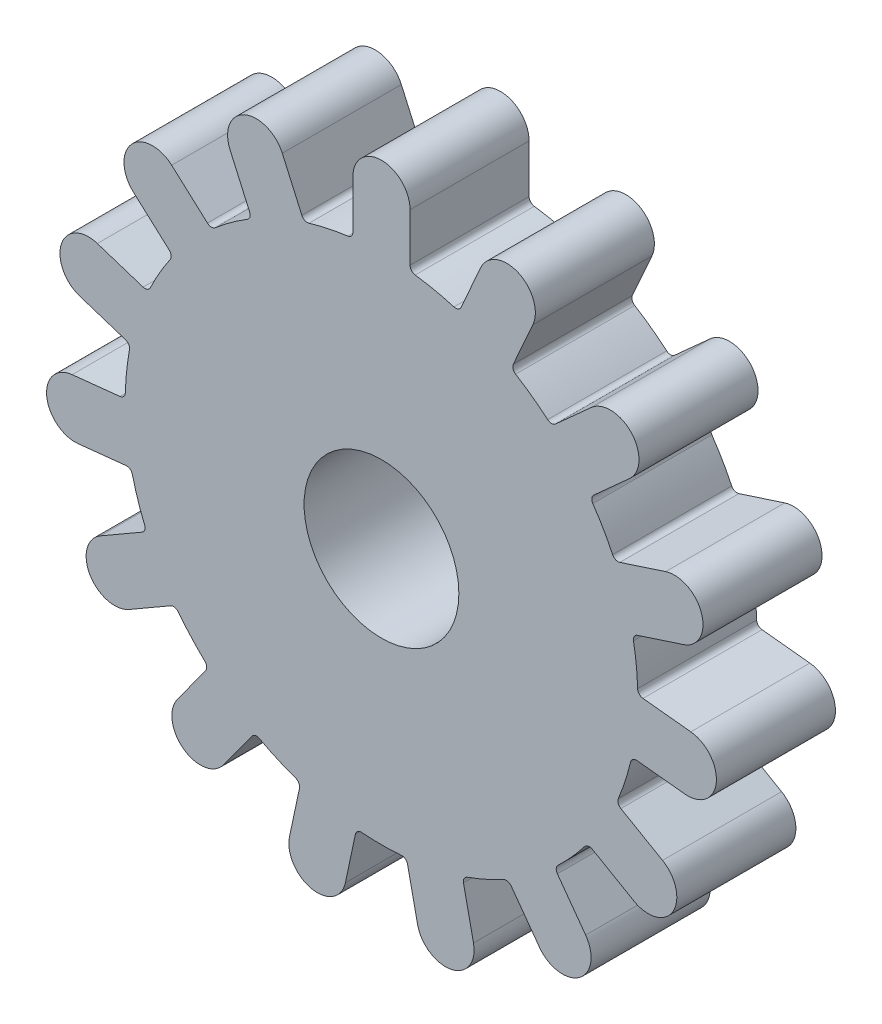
ISO-10303-21;
HEADER;
FILE_DESCRIPTION(('STEP AP214'),'2;1');
FILE_NAME('part.step','',(''),(''),'','','');
FILE_SCHEMA(('AUTOMOTIVE_DESIGN { 1 0 10303 214 1 1 1 1 }'));
ENDSEC;
DATA;
#1=APPLICATION_CONTEXT('core data for automotive mechanical design processes');
#2=APPLICATION_PROTOCOL_DEFINITION('international standard','automotive_design',2000,#1);
#3=PRODUCT_CONTEXT('',#1,'mechanical');
#4=PRODUCT('Part','Part','',(#3));
#5=PRODUCT_RELATED_PRODUCT_CATEGORY('part','',(#4));
#6=PRODUCT_DEFINITION_FORMATION('','',#4);
#7=PRODUCT_DEFINITION_CONTEXT('part definition',#1,'design');
#8=PRODUCT_DEFINITION('design','',#6,#7);
#9=PRODUCT_DEFINITION_SHAPE('','',#8);
#10=(LENGTH_UNIT() NAMED_UNIT(*) SI_UNIT(.MILLI.,.METRE.));
#11=(NAMED_UNIT(*) PLANE_ANGLE_UNIT() SI_UNIT($,.RADIAN.));
#12=(NAMED_UNIT(*) SI_UNIT($,.STERADIAN.) SOLID_ANGLE_UNIT());
#13=UNCERTAINTY_MEASURE_WITH_UNIT(LENGTH_MEASURE(1.E-05),#10,'distance_accuracy_value','');
#14=(GEOMETRIC_REPRESENTATION_CONTEXT(3) GLOBAL_UNCERTAINTY_ASSIGNED_CONTEXT((#13)) GLOBAL_UNIT_ASSIGNED_CONTEXT((#10,
#11,#12)) REPRESENTATION_CONTEXT('',''));
#15=CARTESIAN_POINT('',(0.,0.,0.));
#16=DIRECTION('',(0.,0.,1.));
#17=DIRECTION('',(1.,0.,0.));
#18=AXIS2_PLACEMENT_3D('',#15,#16,#17);
#19=CARTESIAN_POINT('',(2.9,21.8332458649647,10.));
#20=DIRECTION('',(0.,0.,1.));
#21=DIRECTION('',(1.,0.,0.));
#22=AXIS2_PLACEMENT_3D('',#19,#20,#21);
#23=PLANE('',#22);
#24=CARTESIAN_POINT('',(2.9,21.8332458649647,10.));
#25=DIRECTION('',(0.,0.,-1.));
#26=DIRECTION('',(1.,0.,0.));
#27=AXIS2_PLACEMENT_3D('',#24,#25,#26);
#28=CIRCLE('',#27,0.5);
#29=CARTESIAN_POINT('',(2.83416572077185,21.3375989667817,10.));
#30=VERTEX_POINT('',#29);
#31=CARTESIAN_POINT('',(2.4,21.8332458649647,10.));
#32=VERTEX_POINT('',#31);
#33=EDGE_CURVE('E800',#30,#32,#28,.T.);
#34=ORIENTED_EDGE('',*,*,#33,.T.);
#35=DIRECTION('',(0.,1.,0.));
#36=VECTOR('',#35,1.);
#37=CARTESIAN_POINT('',(2.40000000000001,25.875,10.));
#38=LINE('',#37,#36);
#39=CARTESIAN_POINT('',(2.40000000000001,25.875,10.));
#40=VERTEX_POINT('',#39);
#41=EDGE_CURVE('E338',#32,#40,#38,.T.);
#42=ORIENTED_EDGE('',*,*,#41,.T.);
#43=CARTESIAN_POINT('',(0.,25.875,10.));
#44=DIRECTION('',(0.,0.,1.));
#45=DIRECTION('',(1.,0.,0.));
#46=AXIS2_PLACEMENT_3D('',#43,#44,#45);
#47=CIRCLE('',#46,2.40000000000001);
#48=CARTESIAN_POINT('',(-2.40000000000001,25.875,10.));
#49=VERTEX_POINT('',#48);
#50=EDGE_CURVE('E1061',#40,#49,#47,.T.);
#51=ORIENTED_EDGE('',*,*,#50,.T.);
#52=DIRECTION('',(0.,-1.,0.));
#53=VECTOR('',#52,1.);
#54=CARTESIAN_POINT('',(-2.40000000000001,25.875,10.));
#55=LINE('',#54,#53);
#56=CARTESIAN_POINT('',(-2.4,21.8332458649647,10.));
#57=VERTEX_POINT('',#56);
#58=EDGE_CURVE('E1080',#49,#57,#55,.T.);
#59=ORIENTED_EDGE('',*,*,#58,.T.);
#60=CARTESIAN_POINT('',(-2.9,21.8332458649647,10.));
#61=DIRECTION('',(0.,0.,-1.));
#62=DIRECTION('',(-1.,0.,0.));
#63=AXIS2_PLACEMENT_3D('',#60,#61,#62);
#64=CIRCLE('',#63,0.5);
#65=CARTESIAN_POINT('',(-2.83416572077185,21.3375989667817,10.));
#66=VERTEX_POINT('',#65);
#67=EDGE_CURVE('E1077',#57,#66,#64,.T.);
#68=ORIENTED_EDGE('',*,*,#67,.T.);
#69=CARTESIAN_POINT('',(0.,0.,10.));
#70=DIRECTION('',(0.,0.,1.));
#71=DIRECTION('',(1.,0.,0.));
#72=AXIS2_PLACEMENT_3D('',#69,#70,#71);
#73=CIRCLE('',#72,21.525);
#74=CARTESIAN_POINT('',(-6.08964415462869,20.6456256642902,10.));
#75=VERTEX_POINT('',#74);
#76=EDGE_CURVE('E1079',#66,#75,#73,.T.);
#77=ORIENTED_EDGE('',*,*,#76,.T.);
#78=CARTESIAN_POINT('',(-6.23109930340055,21.1251988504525,10.));
#79=DIRECTION('',(0.,0.,-1.));
#80=DIRECTION('',(1.,0.,0.));
#81=AXIS2_PLACEMENT_3D('',#78,#79,#80);
#82=CIRCLE('',#81,0.499999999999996);
#83=CARTESIAN_POINT('',(-6.68787203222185,20.9218305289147,10.));
#84=VERTEX_POINT('',#83);
#85=EDGE_CURVE('E1082',#75,#84,#82,.T.);
#86=ORIENTED_EDGE('',*,*,#85,.T.);
#87=DIRECTION('',(-0.40673664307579,0.913545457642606,0.));
#88=VECTOR('',#87,1.);
#89=CARTESIAN_POINT('',(-8.33180154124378,24.6141566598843,10.));
#90=LINE('',#89,#88);
#91=CARTESIAN_POINT('',(-8.33180154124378,24.6141566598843,10.));
#92=VERTEX_POINT('',#91);
#93=EDGE_CURVE('E1088',#84,#92,#90,.T.);
#94=ORIENTED_EDGE('',*,*,#93,.T.);
#95=CARTESIAN_POINT('',(-10.524310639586,23.6379887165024,10.));
#96=DIRECTION('',(0.,0.,1.));
#97=DIRECTION('',(1.,0.,0.));
#98=AXIS2_PLACEMENT_3D('',#95,#96,#97);
#99=CIRCLE('',#98,2.4);
#100=CARTESIAN_POINT('',(-12.7168197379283,22.6618207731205,10.));
#101=VERTEX_POINT('',#100);
#102=EDGE_CURVE('E1090',#92,#101,#99,.T.);
#103=ORIENTED_EDGE('',*,*,#102,.T.);
#104=DIRECTION('',(0.40673664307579,-0.913545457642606,0.));
#105=VECTOR('',#104,1.);
#106=CARTESIAN_POINT('',(-12.7168197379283,22.6618207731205,10.));
#107=LINE('',#106,#105);
#108=CARTESIAN_POINT('',(-11.0728902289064,18.9694946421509,10.));
#109=VERTEX_POINT('',#108);
#110=EDGE_CURVE('E1092',#101,#109,#107,.T.);
#111=ORIENTED_EDGE('',*,*,#110,.T.);
#112=CARTESIAN_POINT('',(-11.5296629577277,18.766126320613,10.));
#113=DIRECTION('',(0.,0.,-1.));
#114=DIRECTION('',(-1.,0.,0.));
#115=AXIS2_PLACEMENT_3D('',#112,#113,#114);
#116=CIRCLE('',#115,0.499999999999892);
#117=CARTESIAN_POINT('',(-11.2679225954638,18.3401075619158,10.));
#118=VERTEX_POINT('',#117);
#119=EDGE_CURVE('E1094',#109,#118,#116,.T.);
#120=ORIENTED_EDGE('',*,*,#119,.T.);
#121=CARTESIAN_POINT('',(0.,0.,10.));
#122=DIRECTION('',(0.,0.,1.));
#123=DIRECTION('',(1.,0.,0.));
#124=AXIS2_PLACEMENT_3D('',#121,#122,#123);
#125=CIRCLE('',#124,21.5250000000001);
#126=CARTESIAN_POINT('',(-13.9604992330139,16.383836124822,10.));
#127=VERTEX_POINT('',#126);
#128=EDGE_CURVE('E1096',#118,#127,#125,.T.);
#129=ORIENTED_EDGE('',*,*,#128,.T.);
#130=CARTESIAN_POINT('',(-14.2847849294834,16.7644130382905,10.));
#131=DIRECTION('',(0.,0.,-1.));
#132=DIRECTION('',(1.,0.,0.));
#133=AXIS2_PLACEMENT_3D('',#130,#131,#132);
#134=CIRCLE('',#133,0.5);
#135=CARTESIAN_POINT('',(-14.6193502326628,16.3928406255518,10.));
#136=VERTEX_POINT('',#135);
#137=EDGE_CURVE('E1098',#127,#136,#134,.T.);
#138=ORIENTED_EDGE('',*,*,#137,.T.);
#139=DIRECTION('',(-0.743144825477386,0.669130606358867,0.));
#140=VECTOR('',#139,1.);
#141=CARTESIAN_POINT('',(-17.6229589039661,19.0973020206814,10.));
#142=LINE('',#141,#140);
#143=CARTESIAN_POINT('',(-17.6229589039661,19.0973020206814,10.));
#144=VERTEX_POINT('',#143);
#145=EDGE_CURVE('E1100',#136,#144,#142,.T.);
#146=ORIENTED_EDGE('',*,*,#145,.T.);
#147=CARTESIAN_POINT('',(-19.2288723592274,17.3137544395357,10.));
#148=DIRECTION('',(0.,0.,1.));
#149=DIRECTION('',(1.,0.,0.));
#150=AXIS2_PLACEMENT_3D('',#147,#148,#149);
#151=CIRCLE('',#150,2.4);
#152=CARTESIAN_POINT('',(-20.8347858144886,15.53020685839,10.));
#153=VERTEX_POINT('',#152);
#154=EDGE_CURVE('E1102',#144,#153,#151,.T.);
#155=ORIENTED_EDGE('',*,*,#154,.T.);
#156=DIRECTION('',(0.743144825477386,-0.669130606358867,0.));
#157=VECTOR('',#156,1.);
#158=CARTESIAN_POINT('',(-20.8347858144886,15.53020685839,10.));
#159=LINE('',#158,#157);
#160=CARTESIAN_POINT('',(-17.8311771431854,12.8257454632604,10.));
#161=VERTEX_POINT('',#160);
#162=EDGE_CURVE('E1104',#153,#161,#159,.T.);
#163=ORIENTED_EDGE('',*,*,#162,.T.);
#164=CARTESIAN_POINT('',(-18.1657424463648,12.4541730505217,10.));
#165=DIRECTION('',(0.,0.,-1.));
#166=DIRECTION('',(-1.,0.,0.));
#167=AXIS2_PLACEMENT_3D('',#164,#165,#166);
#168=CIRCLE('',#167,0.499999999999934);
#169=CARTESIAN_POINT('',(-17.7533532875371,12.1714449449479,10.));
#170=VERTEX_POINT('',#169);
#171=EDGE_CURVE('E1106',#161,#170,#168,.T.);
#172=ORIENTED_EDGE('',*,*,#171,.T.);
#173=CARTESIAN_POINT('',(0.,0.,10.));
#174=DIRECTION('',(0.,0.,1.));
#175=DIRECTION('',(1.,0.,0.));
#176=AXIS2_PLACEMENT_3D('',#173,#174,#175);
#177=CIRCLE('',#176,21.5250000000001);
#178=CARTESIAN_POINT('',(-19.417457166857,9.28913247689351,10.));
#179=VERTEX_POINT('',#178);
#180=EDGE_CURVE('E1108',#170,#179,#177,.T.);
#181=ORIENTED_EDGE('',*,*,#180,.T.);
#182=CARTESIAN_POINT('',(-19.8685014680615,9.50490791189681,10.));
#183=DIRECTION('',(0.,0.,-1.));
#184=DIRECTION('',(1.,0.,0.));
#185=AXIS2_PLACEMENT_3D('',#182,#183,#184);
#186=CIRCLE('',#185,0.5);
#187=CARTESIAN_POINT('',(-20.023009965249,9.02937965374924,10.));
#188=VERTEX_POINT('',#187);
#189=EDGE_CURVE('E1110',#179,#188,#186,.T.);
#190=ORIENTED_EDGE('',*,*,#189,.T.);
#191=DIRECTION('',(-0.95105651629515,0.309016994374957,0.));
#192=VECTOR('',#191,1.);
#193=CARTESIAN_POINT('',(-23.8669465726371,10.2783503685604,10.));
#194=LINE('',#193,#192);
#195=CARTESIAN_POINT('',(-23.8669465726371,10.2783503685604,10.));
#196=VERTEX_POINT('',#195);
#197=EDGE_CURVE('E1112',#188,#196,#194,.T.);
#198=ORIENTED_EDGE('',*,*,#197,.T.);
#199=CARTESIAN_POINT('',(-24.608587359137,7.99581472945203,10.));
#200=DIRECTION('',(0.,0.,1.));
#201=DIRECTION('',(1.,0.,0.));
#202=AXIS2_PLACEMENT_3D('',#199,#200,#201);
#203=CIRCLE('',#202,2.4);
#204=CARTESIAN_POINT('',(-25.3502281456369,5.71327909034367,10.));
#205=VERTEX_POINT('',#204);
#206=EDGE_CURVE('E1114',#196,#205,#203,.T.);
#207=ORIENTED_EDGE('',*,*,#206,.T.);
#208=DIRECTION('',(0.95105651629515,-0.309016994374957,0.));
#209=VECTOR('',#208,1.);
#210=CARTESIAN_POINT('',(-25.3502281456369,5.71327909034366,10.));
#211=LINE('',#210,#209);
#212=CARTESIAN_POINT('',(-21.5062915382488,4.46430837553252,10.));
#213=VERTEX_POINT('',#212);
#214=EDGE_CURVE('E1116',#205,#213,#211,.T.);
#215=ORIENTED_EDGE('',*,*,#214,.T.);
#216=CARTESIAN_POINT('',(-21.6608000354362,3.98878011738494,10.));
#217=DIRECTION('',(0.,0.,-1.));
#218=DIRECTION('',(-1.,0.,0.));
#219=AXIS2_PLACEMENT_3D('',#216,#217,#218);
#220=CIRCLE('',#219,0.499999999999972);
#221=CARTESIAN_POINT('',(-21.1690679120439,3.89822892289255,10.));
#222=VERTEX_POINT('',#221);
#223=EDGE_CURVE('E1118',#213,#222,#220,.T.);
#224=ORIENTED_EDGE('',*,*,#223,.T.);
#225=CARTESIAN_POINT('',(0.,0.,10.));
#226=DIRECTION('',(0.,0.,1.));
#227=DIRECTION('',(1.,0.,0.));
#228=AXIS2_PLACEMENT_3D('',#225,#226,#227);
#229=CIRCLE('',#228,21.525);
#230=CARTESIAN_POINT('',(-21.51696035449,0.588253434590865,10.));
#231=VERTEX_POINT('',#230);
#232=EDGE_CURVE('E1120',#222,#231,#229,.T.);
#233=ORIENTED_EDGE('',*,*,#232,.T.);
#234=CARTESIAN_POINT('',(-22.0167736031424,0.601917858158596,10.));
#235=DIRECTION('',(0.,0.,-1.));
#236=DIRECTION('',(1.,0.,0.));
#237=AXIS2_PLACEMENT_3D('',#234,#235,#236);
#238=CIRCLE('',#237,0.500000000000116);
#239=CARTESIAN_POINT('',(-21.9645093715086,0.104656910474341,10.));
#240=VERTEX_POINT('',#239);
#241=EDGE_CURVE('E1122',#231,#240,#238,.T.);
#242=ORIENTED_EDGE('',*,*,#241,.T.);
#243=DIRECTION('',(-0.994521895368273,-0.104528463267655,0.));
#244=VECTOR('',#243,1.);
#245=CARTESIAN_POINT('',(-25.9841223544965,-0.317821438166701,10.));
#246=LINE('',#245,#244);
#247=CARTESIAN_POINT('',(-25.9841223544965,-0.317821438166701,10.));
#248=VERTEX_POINT('',#247);
#249=EDGE_CURVE('E1124',#240,#248,#246,.T.);
#250=ORIENTED_EDGE('',*,*,#249,.T.);
#251=CARTESIAN_POINT('',(-25.7332540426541,-2.70467398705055,10.));
#252=DIRECTION('',(0.,0.,1.));
#253=DIRECTION('',(1.,0.,0.));
#254=AXIS2_PLACEMENT_3D('',#251,#252,#253);
#255=CIRCLE('',#254,2.4);
#256=CARTESIAN_POINT('',(-25.4823857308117,-5.09152653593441,10.));
#257=VERTEX_POINT('',#256);
#258=EDGE_CURVE('E1126',#248,#257,#255,.T.);
#259=ORIENTED_EDGE('',*,*,#258,.T.);
#260=DIRECTION('',(0.994521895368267,0.104528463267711,0.));
#261=VECTOR('',#260,1.);
#262=CARTESIAN_POINT('',(-25.4823857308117,-5.09152653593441,10.));
#263=LINE('',#262,#261);
#264=CARTESIAN_POINT('',(-21.4627727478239,-4.66904818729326,10.));
#265=VERTEX_POINT('',#264);
#266=EDGE_CURVE('E1128',#257,#265,#263,.T.);
#267=ORIENTED_EDGE('',*,*,#266,.T.);
#268=CARTESIAN_POINT('',(-21.4105085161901,-5.1663091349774,10.));
#269=DIRECTION('',(0.,0.,-1.));
#270=DIRECTION('',(-1.,0.,0.));
#271=AXIS2_PLACEMENT_3D('',#268,#269,#270);
#272=CIRCLE('',#271,0.499999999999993);
#273=CARTESIAN_POINT('',(-20.9244583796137,-5.04902629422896,10.));
#274=VERTEX_POINT('',#273);
#275=EDGE_CURVE('E1130',#265,#274,#272,.T.);
#276=ORIENTED_EDGE('',*,*,#275,.T.);
#277=CARTESIAN_POINT('',(0.,0.,10.));
#278=DIRECTION('',(0.,0.,1.));
#279=DIRECTION('',(1.,0.,0.));
#280=AXIS2_PLACEMENT_3D('',#277,#278,#279);
#281=CIRCLE('',#280,21.525);
#282=CARTESIAN_POINT('',(-19.8959856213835,-8.21433997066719,10.));
#283=VERTEX_POINT('',#282);
#284=EDGE_CURVE('E1132',#274,#283,#281,.T.);
#285=ORIENTED_EDGE('',*,*,#284,.T.);
#286=CARTESIAN_POINT('',(-20.3581455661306,-8.40514926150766,10.));
#287=DIRECTION('',(0.,0.,-1.));
#288=DIRECTION('',(1.,0.,0.));
#289=AXIS2_PLACEMENT_3D('',#286,#287,#288);
#290=CIRCLE('',#289,0.499999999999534);
#291=CARTESIAN_POINT('',(-20.108145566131,-8.83816196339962,10.));
#292=VERTEX_POINT('',#291);
#293=EDGE_CURVE('E1134',#283,#292,#290,.T.);
#294=ORIENTED_EDGE('',*,*,#293,.T.);
#295=DIRECTION('',(-0.866025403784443,-0.499999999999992,0.));
#296=VECTOR('',#295,1.);
#297=CARTESIAN_POINT('',(-23.6084073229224,-10.8590390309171,10.));
#298=LINE('',#297,#296);
#299=CARTESIAN_POINT('',(-23.6084073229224,-10.8590390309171,10.));
#300=VERTEX_POINT('',#299);
#301=EDGE_CURVE('E1136',#292,#300,#298,.T.);
#302=ORIENTED_EDGE('',*,*,#301,.T.);
#303=CARTESIAN_POINT('',(-22.4084073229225,-12.9374999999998,10.));
#304=DIRECTION('',(0.,0.,1.));
#305=DIRECTION('',(1.,0.,0.));
#306=AXIS2_PLACEMENT_3D('',#303,#304,#305);
#307=CIRCLE('',#306,2.4);
#308=CARTESIAN_POINT('',(-21.2084073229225,-15.0159609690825,10.));
#309=VERTEX_POINT('',#308);
#310=EDGE_CURVE('E1138',#300,#309,#307,.T.);
#311=ORIENTED_EDGE('',*,*,#310,.T.);
#312=DIRECTION('',(0.866025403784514,0.499999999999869,0.));
#313=VECTOR('',#312,1.);
#314=CARTESIAN_POINT('',(-21.2084073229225,-15.0159609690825,10.));
#315=LINE('',#314,#313);
#316=CARTESIAN_POINT('',(-17.7081455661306,-12.9950839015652,10.));
#317=VERTEX_POINT('',#316);
#318=EDGE_CURVE('E1140',#309,#317,#315,.T.);
#319=ORIENTED_EDGE('',*,*,#318,.T.);
#320=CARTESIAN_POINT('',(-17.4581455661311,-13.4280966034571,10.));
#321=DIRECTION('',(0.,0.,-1.));
#322=DIRECTION('',(-1.,0.,0.));
#323=AXIS2_PLACEMENT_3D('',#320,#321,#322);
#324=CIRCLE('',#323,0.499999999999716);
#325=CARTESIAN_POINT('',(-17.0618199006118,-13.1232589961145,10.));
#326=VERTEX_POINT('',#325);
#327=EDGE_CURVE('E1142',#317,#326,#324,.T.);
#328=ORIENTED_EDGE('',*,*,#327,.T.);
#329=CARTESIAN_POINT('',(0.,0.,10.));
#330=DIRECTION('',(0.,0.,1.));
#331=DIRECTION('',(1.,0.,0.));
#332=AXIS2_PLACEMENT_3D('',#329,#330,#331);
#333=CIRCLE('',#332,21.525);
#334=CARTESIAN_POINT('',(-14.8348142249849,-15.596599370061,10.));
#335=VERTEX_POINT('',#334);
#336=EDGE_CURVE('E1144',#326,#335,#333,.T.);
#337=ORIENTED_EDGE('',*,*,#336,.T.);
#338=CARTESIAN_POINT('',(-15.1794092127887,-15.9588897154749,10.));
#339=DIRECTION('',(0.,0.,-1.));
#340=DIRECTION('',(1.,0.,0.));
#341=AXIS2_PLACEMENT_3D('',#338,#339,#340);
#342=CIRCLE('',#341,0.49999999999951);
#343=CARTESIAN_POINT('',(-14.7749007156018,-16.252782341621,10.));
#344=VERTEX_POINT('',#343);
#345=EDGE_CURVE('E1146',#335,#344,#342,.T.);
#346=ORIENTED_EDGE('',*,*,#345,.T.);
#347=DIRECTION('',(-0.587785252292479,-0.809016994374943,0.));
#348=VECTOR('',#347,1.);
#349=CARTESIAN_POINT('',(-17.1505841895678,-19.5226301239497,10.));
#350=LINE('',#349,#348);
#351=CARTESIAN_POINT('',(-17.1505841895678,-19.5226301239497,10.));
#352=VERTEX_POINT('',#351);
#353=EDGE_CURVE('E1148',#344,#352,#350,.T.);
#354=ORIENTED_EDGE('',*,*,#353,.T.);
#355=CARTESIAN_POINT('',(-15.2089434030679,-20.9333147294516,10.));
#356=DIRECTION('',(0.,0.,1.));
#357=DIRECTION('',(1.,0.,0.));
#358=AXIS2_PLACEMENT_3D('',#355,#356,#357);
#359=CIRCLE('',#358,2.4);
#360=CARTESIAN_POINT('',(-13.267302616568,-22.3439993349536,10.));
#361=VERTEX_POINT('',#360);
#362=EDGE_CURVE('E1150',#352,#361,#359,.T.);
#363=ORIENTED_EDGE('',*,*,#362,.T.);
#364=DIRECTION('',(0.587785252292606,0.809016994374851,0.));
#365=VECTOR('',#364,1.);
#366=CARTESIAN_POINT('',(-13.267302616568,-22.3439993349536,10.));
#367=LINE('',#366,#365);
#368=CARTESIAN_POINT('',(-10.8916191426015,-19.074151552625,10.));
#369=VERTEX_POINT('',#368);
#370=EDGE_CURVE('E1152',#361,#369,#367,.T.);
#371=ORIENTED_EDGE('',*,*,#370,.T.);
#372=CARTESIAN_POINT('',(-10.4871106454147,-19.3680441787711,10.));
#373=DIRECTION('',(0.,0.,-1.));
#374=DIRECTION('',(-1.,0.,0.));
#375=AXIS2_PLACEMENT_3D('',#372,#373,#374);
#376=CIRCLE('',#375,0.499999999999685);
#377=CARTESIAN_POINT('',(-10.2490377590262,-18.9283609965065,10.));
#378=VERTEX_POINT('',#377);
#379=EDGE_CURVE('E1154',#369,#378,#376,.T.);
#380=ORIENTED_EDGE('',*,*,#379,.T.);
#381=CARTESIAN_POINT('',(0.,0.,10.));
#382=DIRECTION('',(0.,0.,1.));
#383=DIRECTION('',(1.,0.,0.));
#384=AXIS2_PLACEMENT_3D('',#381,#382,#383);
#385=CIRCLE('',#384,21.525);
#386=CARTESIAN_POINT('',(-7.20856867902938,-20.2820650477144,10.));
#387=VERTEX_POINT('',#386);
#388=EDGE_CURVE('E1156',#378,#387,#385,.T.);
#389=ORIENTED_EDGE('',*,*,#388,.T.);
#390=CARTESIAN_POINT('',(-7.37601510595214,-20.7531931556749,10.));
#391=DIRECTION('',(0.,0.,-1.));
#392=DIRECTION('',(1.,0.,0.));
#393=AXIS2_PLACEMENT_3D('',#390,#391,#392);
#394=CIRCLE('',#393,0.499999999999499);
#395=CARTESIAN_POINT('',(-6.88694130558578,-20.8571490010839,10.));
#396=VERTEX_POINT('',#395);
#397=EDGE_CURVE('E1158',#387,#396,#394,.T.);
#398=ORIENTED_EDGE('',*,*,#397,.T.);
#399=DIRECTION('',(-0.207911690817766,-0.978147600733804,0.));
#400=VECTOR('',#399,1.);
#401=CARTESIAN_POINT('',(-7.72726924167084,-24.8105811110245,10.));
#402=LINE('',#401,#400);
#403=CARTESIAN_POINT('',(-7.72726924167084,-24.8105811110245,10.));
#404=VERTEX_POINT('',#403);
#405=EDGE_CURVE('E1160',#396,#404,#402,.T.);
#406=ORIENTED_EDGE('',*,*,#405,.T.);
#407=CARTESIAN_POINT('',(-5.37971499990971,-25.3095691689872,10.));
#408=DIRECTION('',(0.,0.,1.));
#409=DIRECTION('',(1.,0.,0.));
#410=AXIS2_PLACEMENT_3D('',#407,#408,#409);
#411=CIRCLE('',#410,2.4);
#412=CARTESIAN_POINT('',(-3.03216075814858,-25.8085572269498,10.));
#413=VERTEX_POINT('',#412);
#414=EDGE_CURVE('E1162',#404,#413,#411,.T.);
#415=ORIENTED_EDGE('',*,*,#414,.T.);
#416=DIRECTION('',(0.207911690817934,0.978147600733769,0.));
#417=VECTOR('',#416,1.);
#418=CARTESIAN_POINT('',(-3.03216075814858,-25.8085572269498,10.));
#419=LINE('',#418,#417);
#420=CARTESIAN_POINT('',(-2.19183282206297,-21.855125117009,10.));
#421=VERTEX_POINT('',#420);
#422=EDGE_CURVE('E1164',#413,#421,#419,.T.);
#423=ORIENTED_EDGE('',*,*,#422,.T.);
#424=CARTESIAN_POINT('',(-1.7027590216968,-21.959080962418,10.));
#425=DIRECTION('',(0.,0.,-1.));
#426=DIRECTION('',(-1.,0.,0.));
#427=AXIS2_PLACEMENT_3D('',#424,#425,#426);
#428=CIRCLE('',#427,0.499999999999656);
#429=CARTESIAN_POINT('',(-1.66410387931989,-21.4605774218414,10.));
#430=VERTEX_POINT('',#429);
#431=EDGE_CURVE('E1166',#421,#430,#428,.T.);
#432=ORIENTED_EDGE('',*,*,#431,.T.);
#433=CARTESIAN_POINT('',(0.,0.,10.));
#434=DIRECTION('',(0.,0.,1.));
#435=DIRECTION('',(1.,0.,0.));
#436=AXIS2_PLACEMENT_3D('',#433,#434,#435);
#437=CIRCLE('',#436,21.525);
#438=CARTESIAN_POINT('',(1.6641038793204,-21.460577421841,10.));
#439=VERTEX_POINT('',#438);
#440=EDGE_CURVE('E1168',#430,#439,#437,.T.);
#441=ORIENTED_EDGE('',*,*,#440,.T.);
#442=CARTESIAN_POINT('',(1.70275902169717,-21.9590809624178,10.));
#443=DIRECTION('',(0.,0.,-1.));
#444=DIRECTION('',(1.,0.,0.));
#445=AXIS2_PLACEMENT_3D('',#442,#443,#444);
#446=CIRCLE('',#445,0.499999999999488);
#447=CARTESIAN_POINT('',(2.1918328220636,-21.8551251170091,10.));
#448=VERTEX_POINT('',#447);
#449=EDGE_CURVE('E1170',#439,#448,#446,.T.);
#450=ORIENTED_EDGE('',*,*,#449,.T.);
#451=DIRECTION('',(0.207911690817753,-0.978147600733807,0.));
#452=VECTOR('',#451,1.);
#453=CARTESIAN_POINT('',(3.03216075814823,-25.8085572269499,10.));
#454=LINE('',#453,#452);
#455=CARTESIAN_POINT('',(3.03216075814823,-25.8085572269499,10.));
#456=VERTEX_POINT('',#455);
#457=EDGE_CURVE('E1172',#448,#456,#454,.T.);
#458=ORIENTED_EDGE('',*,*,#457,.T.);
#459=CARTESIAN_POINT('',(5.37971499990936,-25.3095691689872,10.));
#460=DIRECTION('',(0.,0.,1.));
#461=DIRECTION('',(1.,0.,0.));
#462=AXIS2_PLACEMENT_3D('',#459,#460,#461);
#463=CIRCLE('',#462,2.4);
#464=CARTESIAN_POINT('',(7.7272692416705,-24.8105811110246,10.));
#465=VERTEX_POINT('',#464);
#466=EDGE_CURVE('E1174',#456,#465,#463,.T.);
#467=ORIENTED_EDGE('',*,*,#466,.T.);
#468=DIRECTION('',(-0.20791169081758,0.978147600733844,0.));
#469=VECTOR('',#468,1.);
#470=CARTESIAN_POINT('',(7.7272692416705,-24.8105811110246,10.));
#471=LINE('',#470,#469);
#472=CARTESIAN_POINT('',(6.88694130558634,-20.8571490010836,10.));
#473=VERTEX_POINT('',#472);
#474=EDGE_CURVE('E1176',#465,#473,#471,.T.);
#475=ORIENTED_EDGE('',*,*,#474,.T.);
#476=CARTESIAN_POINT('',(7.37601510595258,-20.7531931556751,10.));
#477=DIRECTION('',(0.,0.,-1.));
#478=DIRECTION('',(-1.,0.,0.));
#479=AXIS2_PLACEMENT_3D('',#476,#477,#478);
#480=CIRCLE('',#479,0.499999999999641);
#481=CARTESIAN_POINT('',(7.20856867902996,-20.2820650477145,10.));
#482=VERTEX_POINT('',#481);
#483=EDGE_CURVE('E1178',#473,#482,#480,.T.);
#484=ORIENTED_EDGE('',*,*,#483,.T.);
#485=CARTESIAN_POINT('',(0.,0.,10.));
#486=DIRECTION('',(0.,0.,1.));
#487=DIRECTION('',(1.,0.,0.));
#488=AXIS2_PLACEMENT_3D('',#485,#486,#487);
#489=CIRCLE('',#488,21.5250000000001);
#490=CARTESIAN_POINT('',(10.2490377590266,-18.928360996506,10.));
#491=VERTEX_POINT('',#490);
#492=EDGE_CURVE('E1180',#482,#491,#489,.T.);
#493=ORIENTED_EDGE('',*,*,#492,.T.);
#494=CARTESIAN_POINT('',(10.487110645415,-19.3680441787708,10.));
#495=DIRECTION('',(0.,0.,-1.));
#496=DIRECTION('',(1.,0.,0.));
#497=AXIS2_PLACEMENT_3D('',#494,#495,#496);
#498=CIRCLE('',#497,0.499999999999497);
#499=CARTESIAN_POINT('',(10.8916191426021,-19.0741515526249,10.));
#500=VERTEX_POINT('',#499);
#501=EDGE_CURVE('E1182',#491,#500,#498,.T.);
#502=ORIENTED_EDGE('',*,*,#501,.T.);
#503=DIRECTION('',(0.587785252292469,-0.80901699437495,0.));
#504=VECTOR('',#503,1.);
#505=CARTESIAN_POINT('',(13.2673026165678,-22.3439993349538,10.));
#506=LINE('',#505,#504);
#507=CARTESIAN_POINT('',(13.2673026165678,-22.3439993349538,10.));
#508=VERTEX_POINT('',#507);
#509=EDGE_CURVE('E1184',#500,#508,#506,.T.);
#510=ORIENTED_EDGE('',*,*,#509,.T.);
#511=CARTESIAN_POINT('',(15.2089434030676,-20.9333147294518,10.));
#512=DIRECTION('',(0.,0.,1.));
#513=DIRECTION('',(1.,0.,0.));
#514=AXIS2_PLACEMENT_3D('',#511,#512,#513);
#515=CIRCLE('',#514,2.4);
#516=CARTESIAN_POINT('',(17.1505841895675,-19.5226301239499,10.));
#517=VERTEX_POINT('',#516);
#518=EDGE_CURVE('E1186',#508,#517,#515,.T.);
#519=ORIENTED_EDGE('',*,*,#518,.T.);
#520=DIRECTION('',(-0.587785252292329,0.809016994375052,0.));
#521=VECTOR('',#520,1.);
#522=CARTESIAN_POINT('',(17.1505841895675,-19.5226301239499,10.));
#523=LINE('',#522,#521);
#524=CARTESIAN_POINT('',(14.7749007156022,-16.2527823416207,10.));
#525=VERTEX_POINT('',#524);
#526=EDGE_CURVE('E1188',#517,#525,#523,.T.);
#527=ORIENTED_EDGE('',*,*,#526,.T.);
#528=CARTESIAN_POINT('',(15.1794092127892,-15.9588897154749,10.));
#529=DIRECTION('',(0.,0.,-1.));
#530=DIRECTION('',(-1.,0.,0.));
#531=AXIS2_PLACEMENT_3D('',#528,#529,#530);
#532=CIRCLE('',#531,0.499999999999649);
#533=CARTESIAN_POINT('',(14.834814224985,-15.5965993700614,10.));
#534=VERTEX_POINT('',#533);
#535=EDGE_CURVE('E1190',#525,#534,#532,.T.);
#536=ORIENTED_EDGE('',*,*,#535,.T.);
#537=CARTESIAN_POINT('',(0.,0.,10.));
#538=DIRECTION('',(0.,0.,1.));
#539=DIRECTION('',(1.,0.,0.));
#540=AXIS2_PLACEMENT_3D('',#537,#538,#539);
#541=CIRCLE('',#540,21.5250000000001);
#542=CARTESIAN_POINT('',(17.061819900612,-13.1232589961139,10.));
#543=VERTEX_POINT('',#542);
#544=EDGE_CURVE('E1192',#534,#543,#541,.T.);
#545=ORIENTED_EDGE('',*,*,#544,.T.);
#546=CARTESIAN_POINT('',(17.4581455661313,-13.4280966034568,10.));
#547=DIRECTION('',(0.,0.,-1.));
#548=DIRECTION('',(1.,0.,0.));
#549=AXIS2_PLACEMENT_3D('',#546,#547,#548);
#550=CIRCLE('',#549,0.499999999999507);
#551=CARTESIAN_POINT('',(17.7081455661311,-12.995083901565,10.));
#552=VERTEX_POINT('',#551);
#553=EDGE_CURVE('E1194',#543,#552,#550,.T.);
#554=ORIENTED_EDGE('',*,*,#553,.T.);
#555=DIRECTION('',(0.866025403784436,-0.500000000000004,0.));
#556=VECTOR('',#555,1.);
#557=CARTESIAN_POINT('',(21.2084073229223,-15.0159609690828,10.));
#558=LINE('',#557,#556);
#559=CARTESIAN_POINT('',(21.2084073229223,-15.0159609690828,10.));
#560=VERTEX_POINT('',#559);
#561=EDGE_CURVE('E1196',#552,#560,#558,.T.);
#562=ORIENTED_EDGE('',*,*,#561,.T.);
#563=CARTESIAN_POINT('',(22.4084073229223,-12.9375000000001,10.));
#564=DIRECTION('',(0.,0.,1.));
#565=DIRECTION('',(1.,0.,0.));
#566=AXIS2_PLACEMENT_3D('',#563,#564,#565);
#567=CIRCLE('',#566,2.4);
#568=CARTESIAN_POINT('',(23.6084073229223,-10.8590390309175,10.));
#569=VERTEX_POINT('',#568);
#570=EDGE_CURVE('E1198',#560,#569,#567,.T.);
#571=ORIENTED_EDGE('',*,*,#570,.T.);
#572=DIRECTION('',(-0.866025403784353,0.500000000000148,0.));
#573=VECTOR('',#572,1.);
#574=CARTESIAN_POINT('',(23.6084073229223,-10.8590390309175,10.));
#575=LINE('',#574,#573);
#576=CARTESIAN_POINT('',(20.1081455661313,-8.83816196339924,10.));
#577=VERTEX_POINT('',#576);
#578=EDGE_CURVE('E1200',#569,#577,#575,.T.);
#579=ORIENTED_EDGE('',*,*,#578,.T.);
#580=CARTESIAN_POINT('',(20.358145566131,-8.4051492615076,10.));
#581=DIRECTION('',(0.,0.,-1.));
#582=DIRECTION('',(-1.,0.,0.));
#583=AXIS2_PLACEMENT_3D('',#580,#581,#582);
#584=CIRCLE('',#583,0.499999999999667);
#585=CARTESIAN_POINT('',(19.8959856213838,-8.2143399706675,10.));
#586=VERTEX_POINT('',#585);
#587=EDGE_CURVE('E1202',#577,#586,#584,.T.);
#588=ORIENTED_EDGE('',*,*,#587,.T.);
#589=CARTESIAN_POINT('',(0.,0.,10.));
#590=DIRECTION('',(0.,0.,1.));
#591=DIRECTION('',(1.,0.,0.));
#592=AXIS2_PLACEMENT_3D('',#589,#590,#591);
#593=CIRCLE('',#592,21.5250000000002);
#594=CARTESIAN_POINT('',(20.9244583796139,-5.04902629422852,10.));
#595=VERTEX_POINT('',#594);
#596=EDGE_CURVE('E1204',#586,#595,#593,.T.);
#597=ORIENTED_EDGE('',*,*,#596,.T.);
#598=CARTESIAN_POINT('',(21.41050851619,-5.16630913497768,10.));
#599=DIRECTION('',(0.,0.,-1.));
#600=DIRECTION('',(1.,0.,0.));
#601=AXIS2_PLACEMENT_3D('',#598,#599,#600);
#602=CIRCLE('',#601,0.499999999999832);
#603=CARTESIAN_POINT('',(21.4627727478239,-4.66904818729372,10.));
#604=VERTEX_POINT('',#603);
#605=EDGE_CURVE('E1206',#595,#604,#602,.T.);
#606=ORIENTED_EDGE('',*,*,#605,.T.);
#607=DIRECTION('',(0.994521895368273,-0.104528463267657,0.));
#608=VECTOR('',#607,1.);
#609=CARTESIAN_POINT('',(25.4823857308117,-5.09152653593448,10.));
#610=LINE('',#609,#608);
#611=CARTESIAN_POINT('',(25.4823857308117,-5.09152653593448,10.));
#612=VERTEX_POINT('',#611);
#613=EDGE_CURVE('E1208',#604,#612,#610,.T.);
#614=ORIENTED_EDGE('',*,*,#613,.T.);
#615=CARTESIAN_POINT('',(25.7332540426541,-2.70467398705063,10.));
#616=DIRECTION('',(0.,0.,1.));
#617=DIRECTION('',(1.,0.,0.));
#618=AXIS2_PLACEMENT_3D('',#615,#616,#617);
#619=CIRCLE('',#618,2.4);
#620=CARTESIAN_POINT('',(25.9841223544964,-0.317821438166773,10.));
#621=VERTEX_POINT('',#620);
#622=EDGE_CURVE('E1210',#612,#621,#619,.T.);
#623=ORIENTED_EDGE('',*,*,#622,.T.);
#624=DIRECTION('',(-0.994521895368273,0.104528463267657,0.));
#625=VECTOR('',#624,1.);
#626=CARTESIAN_POINT('',(25.9841223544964,-0.317821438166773,10.));
#627=LINE('',#626,#625);
#628=CARTESIAN_POINT('',(21.9645093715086,0.104656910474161,10.));
#629=VERTEX_POINT('',#628);
#630=EDGE_CURVE('E1212',#621,#629,#627,.T.);
#631=ORIENTED_EDGE('',*,*,#630,.T.);
#632=CARTESIAN_POINT('',(22.0167736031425,0.601917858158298,10.));
#633=DIRECTION('',(0.,0.,-1.));
#634=DIRECTION('',(-1.,0.,0.));
#635=AXIS2_PLACEMENT_3D('',#632,#633,#634);
#636=CIRCLE('',#635,0.500000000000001);
#637=CARTESIAN_POINT('',(21.51696035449,0.588253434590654,10.));
#638=VERTEX_POINT('',#637);
#639=EDGE_CURVE('E1214',#629,#638,#636,.T.);
#640=ORIENTED_EDGE('',*,*,#639,.T.);
#641=CARTESIAN_POINT('',(0.,0.,10.));
#642=DIRECTION('',(0.,0.,1.));
#643=DIRECTION('',(1.,0.,0.));
#644=AXIS2_PLACEMENT_3D('',#641,#642,#643);
#645=CIRCLE('',#644,21.525);
#646=CARTESIAN_POINT('',(21.1690679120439,3.89822892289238,10.));
#647=VERTEX_POINT('',#646);
#648=EDGE_CURVE('E1216',#638,#647,#645,.T.);
#649=ORIENTED_EDGE('',*,*,#648,.T.);
#650=CARTESIAN_POINT('',(21.6608000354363,3.98878011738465,10.));
#651=DIRECTION('',(0.,0.,-1.));
#652=DIRECTION('',(1.,0.,0.));
#653=AXIS2_PLACEMENT_3D('',#650,#651,#652);
#654=CIRCLE('',#653,0.500000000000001);
#655=CARTESIAN_POINT('',(21.5062915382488,4.46430837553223,10.));
#656=VERTEX_POINT('',#655);
#657=EDGE_CURVE('E1218',#647,#656,#654,.T.);
#658=ORIENTED_EDGE('',*,*,#657,.T.);
#659=DIRECTION('',(0.951056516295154,0.309016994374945,0.));
#660=VECTOR('',#659,1.);
#661=CARTESIAN_POINT('',(25.350228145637,5.71327909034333,10.));
#662=LINE('',#661,#660);
#663=CARTESIAN_POINT('',(25.350228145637,5.71327909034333,10.));
#664=VERTEX_POINT('',#663);
#665=EDGE_CURVE('E1220',#656,#664,#662,.T.);
#666=ORIENTED_EDGE('',*,*,#665,.T.);
#667=CARTESIAN_POINT('',(24.6085873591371,7.9958147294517,10.));
#668=DIRECTION('',(0.,0.,1.));
#669=DIRECTION('',(1.,0.,0.));
#670=AXIS2_PLACEMENT_3D('',#667,#668,#669);
#671=CIRCLE('',#670,2.4);
#672=CARTESIAN_POINT('',(23.8669465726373,10.2783503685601,10.));
#673=VERTEX_POINT('',#672);
#674=EDGE_CURVE('E1222',#664,#673,#671,.T.);
#675=ORIENTED_EDGE('',*,*,#674,.T.);
#676=DIRECTION('',(-0.951056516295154,-0.309016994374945,0.));
#677=VECTOR('',#676,1.);
#678=CARTESIAN_POINT('',(23.8669465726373,10.2783503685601,10.));
#679=LINE('',#678,#677);
#680=CARTESIAN_POINT('',(20.0230099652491,9.02937965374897,10.));
#681=VERTEX_POINT('',#680);
#682=EDGE_CURVE('E1224',#673,#681,#679,.T.);
#683=ORIENTED_EDGE('',*,*,#682,.T.);
#684=CARTESIAN_POINT('',(19.8685014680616,9.50490791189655,10.));
#685=DIRECTION('',(0.,0.,-1.));
#686=DIRECTION('',(-1.,0.,0.));
#687=AXIS2_PLACEMENT_3D('',#684,#685,#686);
#688=CIRCLE('',#687,0.500000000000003);
#689=CARTESIAN_POINT('',(19.417457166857,9.28913247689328,10.));
#690=VERTEX_POINT('',#689);
#691=EDGE_CURVE('E1226',#681,#690,#688,.T.);
#692=ORIENTED_EDGE('',*,*,#691,.T.);
#693=CARTESIAN_POINT('',(0.,0.,10.));
#694=DIRECTION('',(0.,0.,1.));
#695=DIRECTION('',(1.,0.,0.));
#696=AXIS2_PLACEMENT_3D('',#693,#694,#695);
#697=CIRCLE('',#696,21.525);
#698=CARTESIAN_POINT('',(17.7533532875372,12.1714449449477,10.));
#699=VERTEX_POINT('',#698);
#700=EDGE_CURVE('E1228',#690,#699,#697,.T.);
#701=ORIENTED_EDGE('',*,*,#700,.T.);
#702=CARTESIAN_POINT('',(18.165742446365,12.4541730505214,10.));
#703=DIRECTION('',(0.,0.,-1.));
#704=DIRECTION('',(1.,0.,0.));
#705=AXIS2_PLACEMENT_3D('',#702,#703,#704);
#706=CIRCLE('',#705,0.500000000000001);
#707=CARTESIAN_POINT('',(17.8311771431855,12.8257454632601,10.));
#708=VERTEX_POINT('',#707);
#709=EDGE_CURVE('E1230',#699,#708,#706,.T.);
#710=ORIENTED_EDGE('',*,*,#709,.T.);
#711=DIRECTION('',(0.743144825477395,0.669130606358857,0.));
#712=VECTOR('',#711,1.);
#713=CARTESIAN_POINT('',(20.8347858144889,15.5302068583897,10.));
#714=LINE('',#713,#712);
#715=CARTESIAN_POINT('',(20.8347858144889,15.5302068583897,10.));
#716=VERTEX_POINT('',#715);
#717=EDGE_CURVE('E1232',#708,#716,#714,.T.);
#718=ORIENTED_EDGE('',*,*,#717,.T.);
#719=CARTESIAN_POINT('',(19.2288723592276,17.3137544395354,10.));
#720=DIRECTION('',(0.,0.,1.));
#721=DIRECTION('',(1.,0.,0.));
#722=AXIS2_PLACEMENT_3D('',#719,#720,#721);
#723=CIRCLE('',#722,2.4);
#724=CARTESIAN_POINT('',(17.6229589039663,19.0973020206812,10.));
#725=VERTEX_POINT('',#724);
#726=EDGE_CURVE('E1234',#716,#725,#723,.T.);
#727=ORIENTED_EDGE('',*,*,#726,.T.);
#728=DIRECTION('',(-0.743144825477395,-0.669130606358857,0.));
#729=VECTOR('',#728,1.);
#730=CARTESIAN_POINT('',(17.6229589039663,19.0973020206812,10.));
#731=LINE('',#730,#729);
#732=CARTESIAN_POINT('',(14.619350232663,16.3928406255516,10.));
#733=VERTEX_POINT('',#732);
#734=EDGE_CURVE('E1236',#725,#733,#731,.T.);
#735=ORIENTED_EDGE('',*,*,#734,.T.);
#736=CARTESIAN_POINT('',(14.2847849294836,16.7644130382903,10.));
#737=DIRECTION('',(0.,0.,-1.));
#738=DIRECTION('',(-1.,0.,0.));
#739=AXIS2_PLACEMENT_3D('',#736,#737,#738);
#740=CIRCLE('',#739,0.500000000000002);
#741=CARTESIAN_POINT('',(13.9604992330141,16.3838361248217,10.));
#742=VERTEX_POINT('',#741);
#743=EDGE_CURVE('E1238',#733,#742,#740,.T.);
#744=ORIENTED_EDGE('',*,*,#743,.T.);
#745=CARTESIAN_POINT('',(0.,0.,10.));
#746=DIRECTION('',(0.,0.,1.));
#747=DIRECTION('',(1.,0.,0.));
#748=AXIS2_PLACEMENT_3D('',#745,#746,#747);
#749=CIRCLE('',#748,21.525);
#750=CARTESIAN_POINT('',(11.2679225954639,18.3401075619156,10.));
#751=VERTEX_POINT('',#750);
#752=EDGE_CURVE('E1240',#742,#751,#749,.T.);
#753=ORIENTED_EDGE('',*,*,#752,.T.);
#754=CARTESIAN_POINT('',(11.5296629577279,18.7661263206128,10.));
#755=DIRECTION('',(0.,0.,-1.));
#756=DIRECTION('',(1.,0.,0.));
#757=AXIS2_PLACEMENT_3D('',#754,#755,#756);
#758=CIRCLE('',#757,0.500000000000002);
#759=CARTESIAN_POINT('',(11.0728902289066,18.9694946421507,10.));
#760=VERTEX_POINT('',#759);
#761=EDGE_CURVE('E1242',#751,#760,#758,.T.);
#762=ORIENTED_EDGE('',*,*,#761,.T.);
#763=DIRECTION('',(0.406736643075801,0.9135454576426,0.));
#764=VECTOR('',#763,1.);
#765=CARTESIAN_POINT('',(12.7168197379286,22.6618207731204,10.));
#766=LINE('',#765,#764);
#767=CARTESIAN_POINT('',(12.7168197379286,22.6618207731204,10.));
#768=VERTEX_POINT('',#767);
#769=EDGE_CURVE('E1244',#760,#768,#766,.T.);
#770=ORIENTED_EDGE('',*,*,#769,.T.);
#771=CARTESIAN_POINT('',(10.5243106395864,23.6379887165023,10.));
#772=DIRECTION('',(0.,0.,1.));
#773=DIRECTION('',(1.,0.,0.));
#774=AXIS2_PLACEMENT_3D('',#771,#772,#773);
#775=CIRCLE('',#774,2.4);
#776=CARTESIAN_POINT('',(8.33180154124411,24.6141566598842,10.));
#777=VERTEX_POINT('',#776);
#778=EDGE_CURVE('E603',#768,#777,#775,.T.);
#779=ORIENTED_EDGE('',*,*,#778,.T.);
#780=DIRECTION('',(-0.406736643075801,-0.9135454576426,0.));
#781=VECTOR('',#780,1.);
#782=CARTESIAN_POINT('',(8.33180154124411,24.6141566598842,10.));
#783=LINE('',#782,#781);
#784=CARTESIAN_POINT('',(6.68787203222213,20.9218305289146,10.));
#785=VERTEX_POINT('',#784);
#786=EDGE_CURVE('E597',#777,#785,#783,.T.);
#787=ORIENTED_EDGE('',*,*,#786,.T.);
#788=CARTESIAN_POINT('',(6.23109930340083,21.1251988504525,10.));
#789=DIRECTION('',(0.,0.,-1.));
#790=DIRECTION('',(-1.,0.,0.));
#791=AXIS2_PLACEMENT_3D('',#788,#789,#790);
#792=CIRCLE('',#791,0.5);
#793=CARTESIAN_POINT('',(6.08964415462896,20.6456256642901,10.));
#794=VERTEX_POINT('',#793);
#795=EDGE_CURVE('E601',#785,#794,#792,.T.);
#796=ORIENTED_EDGE('',*,*,#795,.T.);
#797=CARTESIAN_POINT('',(0.,0.,10.));
#798=DIRECTION('',(0.,0.,1.));
#799=DIRECTION('',(1.,0.,0.));
#800=AXIS2_PLACEMENT_3D('',#797,#798,#799);
#801=CIRCLE('',#800,21.525);
#802=EDGE_CURVE('E49',#794,#30,#801,.T.);
#803=ORIENTED_EDGE('',*,*,#802,.T.);
#804=EDGE_LOOP('',(#34,#42,#51,#59,#68,#77,#86,#94,#103,#111,#120,#129,#138,#146,#155,#163,#172,
#181,#190,#198,#207,#215,#224,#233,#242,#250,#259,#267,#276,#285,#294,#302,#311,#319,#328,#337,
#346,#354,#363,#371,#380,#389,#398,#406,#415,#423,#432,#441,#450,#458,#467,#475,#484,#493,#502,
#510,#519,#527,#536,#545,#554,#562,#571,#579,#588,#597,#606,#614,#623,#631,#640,#649,#658,#666,
#675,#683,#692,#701,#710,#718,#727,#735,#744,#753,#762,#770,#779,#787,#796,#803));
#805=FACE_BOUND('',#804,.T.);
#806=CARTESIAN_POINT('',(0.,0.,10.));
#807=DIRECTION('',(0.,0.,1.));
#808=DIRECTION('',(1.,0.,0.));
#809=AXIS2_PLACEMENT_3D('',#806,#807,#808);
#810=CIRCLE('',#809,6.5);
#811=CARTESIAN_POINT('',(6.5,0.,10.));
#812=VERTEX_POINT('',#811);
#813=EDGE_CURVE('E625',#812,#812,#810,.T.);
#814=ORIENTED_EDGE('',*,*,#813,.F.);
#815=EDGE_LOOP('',(#814));
#816=FACE_BOUND('',#815,.T.);
#817=ADVANCED_FACE('F32',(#805,#816),#23,.T.);
#818=CARTESIAN_POINT('',(2.9,21.8332458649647,0.));
#819=DIRECTION('',(0.,0.,1.));
#820=DIRECTION('',(1.,0.,0.));
#821=AXIS2_PLACEMENT_3D('',#818,#819,#820);
#822=PLANE('',#821);
#823=CARTESIAN_POINT('',(2.9,21.8332458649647,0.));
#824=DIRECTION('',(0.,0.,-1.));
#825=DIRECTION('',(1.,0.,0.));
#826=AXIS2_PLACEMENT_3D('',#823,#824,#825);
#827=CIRCLE('',#826,0.5);
#828=CARTESIAN_POINT('',(2.83416572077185,21.3375989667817,0.));
#829=VERTEX_POINT('',#828);
#830=CARTESIAN_POINT('',(2.4,21.8332458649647,0.));
#831=VERTEX_POINT('',#830);
#832=EDGE_CURVE('E621',#829,#831,#827,.T.);
#833=ORIENTED_EDGE('',*,*,#832,.F.);
#834=CARTESIAN_POINT('',(0.,0.,0.));
#835=DIRECTION('',(0.,0.,1.));
#836=DIRECTION('',(1.,0.,0.));
#837=AXIS2_PLACEMENT_3D('',#834,#835,#836);
#838=CIRCLE('',#837,21.525);
#839=CARTESIAN_POINT('',(6.08964415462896,20.6456256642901,0.));
#840=VERTEX_POINT('',#839);
#841=EDGE_CURVE('E330',#840,#829,#838,.T.);
#842=ORIENTED_EDGE('',*,*,#841,.F.);
#843=CARTESIAN_POINT('',(6.23109930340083,21.1251988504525,0.));
#844=DIRECTION('',(0.,0.,-1.));
#845=DIRECTION('',(-1.,0.,0.));
#846=AXIS2_PLACEMENT_3D('',#843,#844,#845);
#847=CIRCLE('',#846,0.5);
#848=CARTESIAN_POINT('',(6.68787203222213,20.9218305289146,0.));
#849=VERTEX_POINT('',#848);
#850=EDGE_CURVE('E324',#849,#840,#847,.T.);
#851=ORIENTED_EDGE('',*,*,#850,.F.);
#852=DIRECTION('',(-0.406736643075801,-0.9135454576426,0.));
#853=VECTOR('',#852,1.);
#854=CARTESIAN_POINT('',(8.33180154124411,24.6141566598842,0.));
#855=LINE('',#854,#853);
#856=CARTESIAN_POINT('',(8.33180154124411,24.6141566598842,0.));
#857=VERTEX_POINT('',#856);
#858=EDGE_CURVE('E611',#857,#849,#855,.T.);
#859=ORIENTED_EDGE('',*,*,#858,.F.);
#860=CARTESIAN_POINT('',(10.5243106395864,23.6379887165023,0.));
#861=DIRECTION('',(0.,0.,1.));
#862=DIRECTION('',(1.,0.,0.));
#863=AXIS2_PLACEMENT_3D('',#860,#861,#862);
#864=CIRCLE('',#863,2.4);
#865=CARTESIAN_POINT('',(12.7168197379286,22.6618207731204,0.));
#866=VERTEX_POINT('',#865);
#867=EDGE_CURVE('E795',#866,#857,#864,.T.);
#868=ORIENTED_EDGE('',*,*,#867,.F.);
#869=DIRECTION('',(0.406736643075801,0.9135454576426,0.));
#870=VECTOR('',#869,1.);
#871=CARTESIAN_POINT('',(12.7168197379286,22.6618207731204,0.));
#872=LINE('',#871,#870);
#873=CARTESIAN_POINT('',(11.0728902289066,18.9694946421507,0.));
#874=VERTEX_POINT('',#873);
#875=EDGE_CURVE('E793',#874,#866,#872,.T.);
#876=ORIENTED_EDGE('',*,*,#875,.F.);
#877=CARTESIAN_POINT('',(11.5296629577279,18.7661263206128,0.));
#878=DIRECTION('',(0.,0.,-1.));
#879=DIRECTION('',(1.,0.,0.));
#880=AXIS2_PLACEMENT_3D('',#877,#878,#879);
#881=CIRCLE('',#880,0.500000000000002);
#882=CARTESIAN_POINT('',(11.2679225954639,18.3401075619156,0.));
#883=VERTEX_POINT('',#882);
#884=EDGE_CURVE('E791',#883,#874,#881,.T.);
#885=ORIENTED_EDGE('',*,*,#884,.F.);
#886=CARTESIAN_POINT('',(0.,0.,0.));
#887=DIRECTION('',(0.,0.,1.));
#888=DIRECTION('',(1.,0.,0.));
#889=AXIS2_PLACEMENT_3D('',#886,#887,#888);
#890=CIRCLE('',#889,21.525);
#891=CARTESIAN_POINT('',(13.9604992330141,16.3838361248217,0.));
#892=VERTEX_POINT('',#891);
#893=EDGE_CURVE('E789',#892,#883,#890,.T.);
#894=ORIENTED_EDGE('',*,*,#893,.F.);
#895=CARTESIAN_POINT('',(14.2847849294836,16.7644130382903,0.));
#896=DIRECTION('',(0.,0.,-1.));
#897=DIRECTION('',(-1.,0.,0.));
#898=AXIS2_PLACEMENT_3D('',#895,#896,#897);
#899=CIRCLE('',#898,0.500000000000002);
#900=CARTESIAN_POINT('',(14.619350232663,16.3928406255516,0.));
#901=VERTEX_POINT('',#900);
#902=EDGE_CURVE('E787',#901,#892,#899,.T.);
#903=ORIENTED_EDGE('',*,*,#902,.F.);
#904=DIRECTION('',(-0.743144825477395,-0.669130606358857,0.));
#905=VECTOR('',#904,1.);
#906=CARTESIAN_POINT('',(17.6229589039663,19.0973020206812,0.));
#907=LINE('',#906,#905);
#908=CARTESIAN_POINT('',(17.6229589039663,19.0973020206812,0.));
#909=VERTEX_POINT('',#908);
#910=EDGE_CURVE('E785',#909,#901,#907,.T.);
#911=ORIENTED_EDGE('',*,*,#910,.F.);
#912=CARTESIAN_POINT('',(19.2288723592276,17.3137544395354,0.));
#913=DIRECTION('',(0.,0.,1.));
#914=DIRECTION('',(1.,0.,0.));
#915=AXIS2_PLACEMENT_3D('',#912,#913,#914);
#916=CIRCLE('',#915,2.4);
#917=CARTESIAN_POINT('',(20.8347858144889,15.5302068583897,0.));
#918=VERTEX_POINT('',#917);
#919=EDGE_CURVE('E783',#918,#909,#916,.T.);
#920=ORIENTED_EDGE('',*,*,#919,.F.);
#921=DIRECTION('',(0.743144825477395,0.669130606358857,0.));
#922=VECTOR('',#921,1.);
#923=CARTESIAN_POINT('',(20.8347858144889,15.5302068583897,0.));
#924=LINE('',#923,#922);
#925=CARTESIAN_POINT('',(17.8311771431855,12.8257454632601,0.));
#926=VERTEX_POINT('',#925);
#927=EDGE_CURVE('E781',#926,#918,#924,.T.);
#928=ORIENTED_EDGE('',*,*,#927,.F.);
#929=CARTESIAN_POINT('',(18.165742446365,12.4541730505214,0.));
#930=DIRECTION('',(0.,0.,-1.));
#931=DIRECTION('',(1.,0.,0.));
#932=AXIS2_PLACEMENT_3D('',#929,#930,#931);
#933=CIRCLE('',#932,0.500000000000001);
#934=CARTESIAN_POINT('',(17.7533532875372,12.1714449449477,0.));
#935=VERTEX_POINT('',#934);
#936=EDGE_CURVE('E779',#935,#926,#933,.T.);
#937=ORIENTED_EDGE('',*,*,#936,.F.);
#938=CARTESIAN_POINT('',(0.,0.,0.));
#939=DIRECTION('',(0.,0.,1.));
#940=DIRECTION('',(1.,0.,0.));
#941=AXIS2_PLACEMENT_3D('',#938,#939,#940);
#942=CIRCLE('',#941,21.525);
#943=CARTESIAN_POINT('',(19.417457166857,9.28913247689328,0.));
#944=VERTEX_POINT('',#943);
#945=EDGE_CURVE('E777',#944,#935,#942,.T.);
#946=ORIENTED_EDGE('',*,*,#945,.F.);
#947=CARTESIAN_POINT('',(19.8685014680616,9.50490791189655,0.));
#948=DIRECTION('',(0.,0.,-1.));
#949=DIRECTION('',(-1.,0.,0.));
#950=AXIS2_PLACEMENT_3D('',#947,#948,#949);
#951=CIRCLE('',#950,0.500000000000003);
#952=CARTESIAN_POINT('',(20.0230099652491,9.02937965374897,0.));
#953=VERTEX_POINT('',#952);
#954=EDGE_CURVE('E775',#953,#944,#951,.T.);
#955=ORIENTED_EDGE('',*,*,#954,.F.);
#956=DIRECTION('',(-0.951056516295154,-0.309016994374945,0.));
#957=VECTOR('',#956,1.);
#958=CARTESIAN_POINT('',(23.8669465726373,10.2783503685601,0.));
#959=LINE('',#958,#957);
#960=CARTESIAN_POINT('',(23.8669465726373,10.2783503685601,0.));
#961=VERTEX_POINT('',#960);
#962=EDGE_CURVE('E773',#961,#953,#959,.T.);
#963=ORIENTED_EDGE('',*,*,#962,.F.);
#964=CARTESIAN_POINT('',(24.6085873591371,7.9958147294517,0.));
#965=DIRECTION('',(0.,0.,1.));
#966=DIRECTION('',(1.,0.,0.));
#967=AXIS2_PLACEMENT_3D('',#964,#965,#966);
#968=CIRCLE('',#967,2.4);
#969=CARTESIAN_POINT('',(25.350228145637,5.71327909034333,0.));
#970=VERTEX_POINT('',#969);
#971=EDGE_CURVE('E771',#970,#961,#968,.T.);
#972=ORIENTED_EDGE('',*,*,#971,.F.);
#973=DIRECTION('',(0.951056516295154,0.309016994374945,0.));
#974=VECTOR('',#973,1.);
#975=CARTESIAN_POINT('',(25.350228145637,5.71327909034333,0.));
#976=LINE('',#975,#974);
#977=CARTESIAN_POINT('',(21.5062915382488,4.46430837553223,0.));
#978=VERTEX_POINT('',#977);
#979=EDGE_CURVE('E769',#978,#970,#976,.T.);
#980=ORIENTED_EDGE('',*,*,#979,.F.);
#981=CARTESIAN_POINT('',(21.6608000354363,3.98878011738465,0.));
#982=DIRECTION('',(0.,0.,-1.));
#983=DIRECTION('',(1.,0.,0.));
#984=AXIS2_PLACEMENT_3D('',#981,#982,#983);
#985=CIRCLE('',#984,0.500000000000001);
#986=CARTESIAN_POINT('',(21.1690679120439,3.89822892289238,0.));
#987=VERTEX_POINT('',#986);
#988=EDGE_CURVE('E767',#987,#978,#985,.T.);
#989=ORIENTED_EDGE('',*,*,#988,.F.);
#990=CARTESIAN_POINT('',(0.,0.,0.));
#991=DIRECTION('',(0.,0.,1.));
#992=DIRECTION('',(1.,0.,0.));
#993=AXIS2_PLACEMENT_3D('',#990,#991,#992);
#994=CIRCLE('',#993,21.525);
#995=CARTESIAN_POINT('',(21.51696035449,0.588253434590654,0.));
#996=VERTEX_POINT('',#995);
#997=EDGE_CURVE('E765',#996,#987,#994,.T.);
#998=ORIENTED_EDGE('',*,*,#997,.F.);
#999=CARTESIAN_POINT('',(22.0167736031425,0.601917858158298,0.));
#1000=DIRECTION('',(0.,0.,-1.));
#1001=DIRECTION('',(-1.,0.,0.));
#1002=AXIS2_PLACEMENT_3D('',#999,#1000,#1001);
#1003=CIRCLE('',#1002,0.500000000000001);
#1004=CARTESIAN_POINT('',(21.9645093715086,0.104656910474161,0.));
#1005=VERTEX_POINT('',#1004);
#1006=EDGE_CURVE('E763',#1005,#996,#1003,.T.);
#1007=ORIENTED_EDGE('',*,*,#1006,.F.);
#1008=DIRECTION('',(-0.994521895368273,0.104528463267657,0.));
#1009=VECTOR('',#1008,1.);
#1010=CARTESIAN_POINT('',(25.9841223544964,-0.317821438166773,0.));
#1011=LINE('',#1010,#1009);
#1012=CARTESIAN_POINT('',(25.9841223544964,-0.317821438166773,0.));
#1013=VERTEX_POINT('',#1012);
#1014=EDGE_CURVE('E761',#1013,#1005,#1011,.T.);
#1015=ORIENTED_EDGE('',*,*,#1014,.F.);
#1016=CARTESIAN_POINT('',(25.7332540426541,-2.70467398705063,0.));
#1017=DIRECTION('',(0.,0.,1.));
#1018=DIRECTION('',(1.,0.,0.));
#1019=AXIS2_PLACEMENT_3D('',#1016,#1017,#1018);
#1020=CIRCLE('',#1019,2.4);
#1021=CARTESIAN_POINT('',(25.4823857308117,-5.09152653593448,0.));
#1022=VERTEX_POINT('',#1021);
#1023=EDGE_CURVE('E759',#1022,#1013,#1020,.T.);
#1024=ORIENTED_EDGE('',*,*,#1023,.F.);
#1025=DIRECTION('',(0.994521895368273,-0.104528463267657,0.));
#1026=VECTOR('',#1025,1.);
#1027=CARTESIAN_POINT('',(25.4823857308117,-5.09152653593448,0.));
#1028=LINE('',#1027,#1026);
#1029=CARTESIAN_POINT('',(21.4627727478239,-4.66904818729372,0.));
#1030=VERTEX_POINT('',#1029);
#1031=EDGE_CURVE('E757',#1030,#1022,#1028,.T.);
#1032=ORIENTED_EDGE('',*,*,#1031,.F.);
#1033=CARTESIAN_POINT('',(21.41050851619,-5.16630913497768,0.));
#1034=DIRECTION('',(0.,0.,-1.));
#1035=DIRECTION('',(1.,0.,0.));
#1036=AXIS2_PLACEMENT_3D('',#1033,#1034,#1035);
#1037=CIRCLE('',#1036,0.499999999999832);
#1038=CARTESIAN_POINT('',(20.9244583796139,-5.04902629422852,0.));
#1039=VERTEX_POINT('',#1038);
#1040=EDGE_CURVE('E755',#1039,#1030,#1037,.T.);
#1041=ORIENTED_EDGE('',*,*,#1040,.F.);
#1042=CARTESIAN_POINT('',(0.,0.,0.));
#1043=DIRECTION('',(0.,0.,1.));
#1044=DIRECTION('',(1.,0.,0.));
#1045=AXIS2_PLACEMENT_3D('',#1042,#1043,#1044);
#1046=CIRCLE('',#1045,21.5250000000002);
#1047=CARTESIAN_POINT('',(19.8959856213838,-8.2143399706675,0.));
#1048=VERTEX_POINT('',#1047);
#1049=EDGE_CURVE('E753',#1048,#1039,#1046,.T.);
#1050=ORIENTED_EDGE('',*,*,#1049,.F.);
#1051=CARTESIAN_POINT('',(20.358145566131,-8.4051492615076,0.));
#1052=DIRECTION('',(0.,0.,-1.));
#1053=DIRECTION('',(-1.,0.,0.));
#1054=AXIS2_PLACEMENT_3D('',#1051,#1052,#1053);
#1055=CIRCLE('',#1054,0.499999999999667);
#1056=CARTESIAN_POINT('',(20.1081455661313,-8.83816196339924,0.));
#1057=VERTEX_POINT('',#1056);
#1058=EDGE_CURVE('E751',#1057,#1048,#1055,.T.);
#1059=ORIENTED_EDGE('',*,*,#1058,.F.);
#1060=DIRECTION('',(-0.866025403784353,0.500000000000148,0.));
#1061=VECTOR('',#1060,1.);
#1062=CARTESIAN_POINT('',(23.6084073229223,-10.8590390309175,0.));
#1063=LINE('',#1062,#1061);
#1064=CARTESIAN_POINT('',(23.6084073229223,-10.8590390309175,0.));
#1065=VERTEX_POINT('',#1064);
#1066=EDGE_CURVE('E749',#1065,#1057,#1063,.T.);
#1067=ORIENTED_EDGE('',*,*,#1066,.F.);
#1068=CARTESIAN_POINT('',(22.4084073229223,-12.9375000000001,0.));
#1069=DIRECTION('',(0.,0.,1.));
#1070=DIRECTION('',(1.,0.,0.));
#1071=AXIS2_PLACEMENT_3D('',#1068,#1069,#1070);
#1072=CIRCLE('',#1071,2.4);
#1073=CARTESIAN_POINT('',(21.2084073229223,-15.0159609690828,0.));
#1074=VERTEX_POINT('',#1073);
#1075=EDGE_CURVE('E747',#1074,#1065,#1072,.T.);
#1076=ORIENTED_EDGE('',*,*,#1075,.F.);
#1077=DIRECTION('',(0.866025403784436,-0.500000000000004,0.));
#1078=VECTOR('',#1077,1.);
#1079=CARTESIAN_POINT('',(21.2084073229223,-15.0159609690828,0.));
#1080=LINE('',#1079,#1078);
#1081=CARTESIAN_POINT('',(17.7081455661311,-12.995083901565,0.));
#1082=VERTEX_POINT('',#1081);
#1083=EDGE_CURVE('E745',#1082,#1074,#1080,.T.);
#1084=ORIENTED_EDGE('',*,*,#1083,.F.);
#1085=CARTESIAN_POINT('',(17.4581455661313,-13.4280966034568,0.));
#1086=DIRECTION('',(0.,0.,-1.));
#1087=DIRECTION('',(1.,0.,0.));
#1088=AXIS2_PLACEMENT_3D('',#1085,#1086,#1087);
#1089=CIRCLE('',#1088,0.499999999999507);
#1090=CARTESIAN_POINT('',(17.061819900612,-13.1232589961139,0.));
#1091=VERTEX_POINT('',#1090);
#1092=EDGE_CURVE('E743',#1091,#1082,#1089,.T.);
#1093=ORIENTED_EDGE('',*,*,#1092,.F.);
#1094=CARTESIAN_POINT('',(0.,0.,0.));
#1095=DIRECTION('',(0.,0.,1.));
#1096=DIRECTION('',(1.,0.,0.));
#1097=AXIS2_PLACEMENT_3D('',#1094,#1095,#1096);
#1098=CIRCLE('',#1097,21.5250000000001);
#1099=CARTESIAN_POINT('',(14.834814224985,-15.5965993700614,0.));
#1100=VERTEX_POINT('',#1099);
#1101=EDGE_CURVE('E741',#1100,#1091,#1098,.T.);
#1102=ORIENTED_EDGE('',*,*,#1101,.F.);
#1103=CARTESIAN_POINT('',(15.1794092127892,-15.9588897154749,0.));
#1104=DIRECTION('',(0.,0.,-1.));
#1105=DIRECTION('',(-1.,0.,0.));
#1106=AXIS2_PLACEMENT_3D('',#1103,#1104,#1105);
#1107=CIRCLE('',#1106,0.499999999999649);
#1108=CARTESIAN_POINT('',(14.7749007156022,-16.2527823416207,0.));
#1109=VERTEX_POINT('',#1108);
#1110=EDGE_CURVE('E739',#1109,#1100,#1107,.T.);
#1111=ORIENTED_EDGE('',*,*,#1110,.F.);
#1112=DIRECTION('',(-0.587785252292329,0.809016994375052,0.));
#1113=VECTOR('',#1112,1.);
#1114=CARTESIAN_POINT('',(17.1505841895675,-19.5226301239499,0.));
#1115=LINE('',#1114,#1113);
#1116=CARTESIAN_POINT('',(17.1505841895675,-19.5226301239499,0.));
#1117=VERTEX_POINT('',#1116);
#1118=EDGE_CURVE('E737',#1117,#1109,#1115,.T.);
#1119=ORIENTED_EDGE('',*,*,#1118,.F.);
#1120=CARTESIAN_POINT('',(15.2089434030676,-20.9333147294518,0.));
#1121=DIRECTION('',(0.,0.,1.));
#1122=DIRECTION('',(1.,0.,0.));
#1123=AXIS2_PLACEMENT_3D('',#1120,#1121,#1122);
#1124=CIRCLE('',#1123,2.4);
#1125=CARTESIAN_POINT('',(13.2673026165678,-22.3439993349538,0.));
#1126=VERTEX_POINT('',#1125);
#1127=EDGE_CURVE('E735',#1126,#1117,#1124,.T.);
#1128=ORIENTED_EDGE('',*,*,#1127,.F.);
#1129=DIRECTION('',(0.587785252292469,-0.80901699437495,0.));
#1130=VECTOR('',#1129,1.);
#1131=CARTESIAN_POINT('',(13.2673026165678,-22.3439993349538,0.));
#1132=LINE('',#1131,#1130);
#1133=CARTESIAN_POINT('',(10.8916191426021,-19.0741515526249,0.));
#1134=VERTEX_POINT('',#1133);
#1135=EDGE_CURVE('E733',#1134,#1126,#1132,.T.);
#1136=ORIENTED_EDGE('',*,*,#1135,.F.);
#1137=CARTESIAN_POINT('',(10.487110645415,-19.3680441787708,0.));
#1138=DIRECTION('',(0.,0.,-1.));
#1139=DIRECTION('',(1.,0.,0.));
#1140=AXIS2_PLACEMENT_3D('',#1137,#1138,#1139);
#1141=CIRCLE('',#1140,0.499999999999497);
#1142=CARTESIAN_POINT('',(10.2490377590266,-18.928360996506,0.));
#1143=VERTEX_POINT('',#1142);
#1144=EDGE_CURVE('E731',#1143,#1134,#1141,.T.);
#1145=ORIENTED_EDGE('',*,*,#1144,.F.);
#1146=CARTESIAN_POINT('',(0.,0.,0.));
#1147=DIRECTION('',(0.,0.,1.));
#1148=DIRECTION('',(1.,0.,0.));
#1149=AXIS2_PLACEMENT_3D('',#1146,#1147,#1148);
#1150=CIRCLE('',#1149,21.5250000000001);
#1151=CARTESIAN_POINT('',(7.20856867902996,-20.2820650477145,0.));
#1152=VERTEX_POINT('',#1151);
#1153=EDGE_CURVE('E729',#1152,#1143,#1150,.T.);
#1154=ORIENTED_EDGE('',*,*,#1153,.F.);
#1155=CARTESIAN_POINT('',(7.37601510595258,-20.7531931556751,0.));
#1156=DIRECTION('',(0.,0.,-1.));
#1157=DIRECTION('',(-1.,0.,0.));
#1158=AXIS2_PLACEMENT_3D('',#1155,#1156,#1157);
#1159=CIRCLE('',#1158,0.499999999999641);
#1160=CARTESIAN_POINT('',(6.88694130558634,-20.8571490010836,0.));
#1161=VERTEX_POINT('',#1160);
#1162=EDGE_CURVE('E727',#1161,#1152,#1159,.T.);
#1163=ORIENTED_EDGE('',*,*,#1162,.F.);
#1164=DIRECTION('',(-0.20791169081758,0.978147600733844,0.));
#1165=VECTOR('',#1164,1.);
#1166=CARTESIAN_POINT('',(7.7272692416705,-24.8105811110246,0.));
#1167=LINE('',#1166,#1165);
#1168=CARTESIAN_POINT('',(7.7272692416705,-24.8105811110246,0.));
#1169=VERTEX_POINT('',#1168);
#1170=EDGE_CURVE('E725',#1169,#1161,#1167,.T.);
#1171=ORIENTED_EDGE('',*,*,#1170,.F.);
#1172=CARTESIAN_POINT('',(5.37971499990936,-25.3095691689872,0.));
#1173=DIRECTION('',(0.,0.,1.));
#1174=DIRECTION('',(1.,0.,0.));
#1175=AXIS2_PLACEMENT_3D('',#1172,#1173,#1174);
#1176=CIRCLE('',#1175,2.4);
#1177=CARTESIAN_POINT('',(3.03216075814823,-25.8085572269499,0.));
#1178=VERTEX_POINT('',#1177);
#1179=EDGE_CURVE('E723',#1178,#1169,#1176,.T.);
#1180=ORIENTED_EDGE('',*,*,#1179,.F.);
#1181=DIRECTION('',(0.207911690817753,-0.978147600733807,0.));
#1182=VECTOR('',#1181,1.);
#1183=CARTESIAN_POINT('',(3.03216075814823,-25.8085572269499,0.));
#1184=LINE('',#1183,#1182);
#1185=CARTESIAN_POINT('',(2.1918328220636,-21.8551251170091,0.));
#1186=VERTEX_POINT('',#1185);
#1187=EDGE_CURVE('E721',#1186,#1178,#1184,.T.);
#1188=ORIENTED_EDGE('',*,*,#1187,.F.);
#1189=CARTESIAN_POINT('',(1.70275902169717,-21.9590809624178,0.));
#1190=DIRECTION('',(0.,0.,-1.));
#1191=DIRECTION('',(1.,0.,0.));
#1192=AXIS2_PLACEMENT_3D('',#1189,#1190,#1191);
#1193=CIRCLE('',#1192,0.499999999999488);
#1194=CARTESIAN_POINT('',(1.6641038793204,-21.460577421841,0.));
#1195=VERTEX_POINT('',#1194);
#1196=EDGE_CURVE('E719',#1195,#1186,#1193,.T.);
#1197=ORIENTED_EDGE('',*,*,#1196,.F.);
#1198=CARTESIAN_POINT('',(0.,0.,0.));
#1199=DIRECTION('',(0.,0.,1.));
#1200=DIRECTION('',(1.,0.,0.));
#1201=AXIS2_PLACEMENT_3D('',#1198,#1199,#1200);
#1202=CIRCLE('',#1201,21.525);
#1203=CARTESIAN_POINT('',(-1.66410387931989,-21.4605774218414,0.));
#1204=VERTEX_POINT('',#1203);
#1205=EDGE_CURVE('E717',#1204,#1195,#1202,.T.);
#1206=ORIENTED_EDGE('',*,*,#1205,.F.);
#1207=CARTESIAN_POINT('',(-1.7027590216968,-21.959080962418,0.));
#1208=DIRECTION('',(0.,0.,-1.));
#1209=DIRECTION('',(-1.,0.,0.));
#1210=AXIS2_PLACEMENT_3D('',#1207,#1208,#1209);
#1211=CIRCLE('',#1210,0.499999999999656);
#1212=CARTESIAN_POINT('',(-2.19183282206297,-21.855125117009,0.));
#1213=VERTEX_POINT('',#1212);
#1214=EDGE_CURVE('E715',#1213,#1204,#1211,.T.);
#1215=ORIENTED_EDGE('',*,*,#1214,.F.);
#1216=DIRECTION('',(0.207911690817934,0.978147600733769,0.));
#1217=VECTOR('',#1216,1.);
#1218=CARTESIAN_POINT('',(-3.03216075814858,-25.8085572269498,0.));
#1219=LINE('',#1218,#1217);
#1220=CARTESIAN_POINT('',(-3.03216075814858,-25.8085572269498,0.));
#1221=VERTEX_POINT('',#1220);
#1222=EDGE_CURVE('E713',#1221,#1213,#1219,.T.);
#1223=ORIENTED_EDGE('',*,*,#1222,.F.);
#1224=CARTESIAN_POINT('',(-5.37971499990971,-25.3095691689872,0.));
#1225=DIRECTION('',(0.,0.,1.));
#1226=DIRECTION('',(1.,0.,0.));
#1227=AXIS2_PLACEMENT_3D('',#1224,#1225,#1226);
#1228=CIRCLE('',#1227,2.4);
#1229=CARTESIAN_POINT('',(-7.72726924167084,-24.8105811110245,0.));
#1230=VERTEX_POINT('',#1229);
#1231=EDGE_CURVE('E711',#1230,#1221,#1228,.T.);
#1232=ORIENTED_EDGE('',*,*,#1231,.F.);
#1233=DIRECTION('',(-0.207911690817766,-0.978147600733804,0.));
#1234=VECTOR('',#1233,1.);
#1235=CARTESIAN_POINT('',(-7.72726924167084,-24.8105811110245,0.));
#1236=LINE('',#1235,#1234);
#1237=CARTESIAN_POINT('',(-6.88694130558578,-20.8571490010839,0.));
#1238=VERTEX_POINT('',#1237);
#1239=EDGE_CURVE('E709',#1238,#1230,#1236,.T.);
#1240=ORIENTED_EDGE('',*,*,#1239,.F.);
#1241=CARTESIAN_POINT('',(-7.37601510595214,-20.7531931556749,0.));
#1242=DIRECTION('',(0.,0.,-1.));
#1243=DIRECTION('',(1.,0.,0.));
#1244=AXIS2_PLACEMENT_3D('',#1241,#1242,#1243);
#1245=CIRCLE('',#1244,0.499999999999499);
#1246=CARTESIAN_POINT('',(-7.20856867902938,-20.2820650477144,0.));
#1247=VERTEX_POINT('',#1246);
#1248=EDGE_CURVE('E707',#1247,#1238,#1245,.T.);
#1249=ORIENTED_EDGE('',*,*,#1248,.F.);
#1250=CARTESIAN_POINT('',(0.,0.,0.));
#1251=DIRECTION('',(0.,0.,1.));
#1252=DIRECTION('',(1.,0.,0.));
#1253=AXIS2_PLACEMENT_3D('',#1250,#1251,#1252);
#1254=CIRCLE('',#1253,21.525);
#1255=CARTESIAN_POINT('',(-10.2490377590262,-18.9283609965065,0.));
#1256=VERTEX_POINT('',#1255);
#1257=EDGE_CURVE('E705',#1256,#1247,#1254,.T.);
#1258=ORIENTED_EDGE('',*,*,#1257,.F.);
#1259=CARTESIAN_POINT('',(-10.4871106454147,-19.3680441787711,0.));
#1260=DIRECTION('',(0.,0.,-1.));
#1261=DIRECTION('',(-1.,0.,0.));
#1262=AXIS2_PLACEMENT_3D('',#1259,#1260,#1261);
#1263=CIRCLE('',#1262,0.499999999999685);
#1264=CARTESIAN_POINT('',(-10.8916191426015,-19.074151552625,0.));
#1265=VERTEX_POINT('',#1264);
#1266=EDGE_CURVE('E703',#1265,#1256,#1263,.T.);
#1267=ORIENTED_EDGE('',*,*,#1266,.F.);
#1268=DIRECTION('',(0.587785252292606,0.809016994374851,0.));
#1269=VECTOR('',#1268,1.);
#1270=CARTESIAN_POINT('',(-13.267302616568,-22.3439993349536,0.));
#1271=LINE('',#1270,#1269);
#1272=CARTESIAN_POINT('',(-13.267302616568,-22.3439993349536,0.));
#1273=VERTEX_POINT('',#1272);
#1274=EDGE_CURVE('E701',#1273,#1265,#1271,.T.);
#1275=ORIENTED_EDGE('',*,*,#1274,.F.);
#1276=CARTESIAN_POINT('',(-15.2089434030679,-20.9333147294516,0.));
#1277=DIRECTION('',(0.,0.,1.));
#1278=DIRECTION('',(1.,0.,0.));
#1279=AXIS2_PLACEMENT_3D('',#1276,#1277,#1278);
#1280=CIRCLE('',#1279,2.4);
#1281=CARTESIAN_POINT('',(-17.1505841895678,-19.5226301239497,0.));
#1282=VERTEX_POINT('',#1281);
#1283=EDGE_CURVE('E699',#1282,#1273,#1280,.T.);
#1284=ORIENTED_EDGE('',*,*,#1283,.F.);
#1285=DIRECTION('',(-0.587785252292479,-0.809016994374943,0.));
#1286=VECTOR('',#1285,1.);
#1287=CARTESIAN_POINT('',(-17.1505841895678,-19.5226301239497,0.));
#1288=LINE('',#1287,#1286);
#1289=CARTESIAN_POINT('',(-14.7749007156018,-16.252782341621,0.));
#1290=VERTEX_POINT('',#1289);
#1291=EDGE_CURVE('E697',#1290,#1282,#1288,.T.);
#1292=ORIENTED_EDGE('',*,*,#1291,.F.);
#1293=CARTESIAN_POINT('',(-15.1794092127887,-15.9588897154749,0.));
#1294=DIRECTION('',(0.,0.,-1.));
#1295=DIRECTION('',(1.,0.,0.));
#1296=AXIS2_PLACEMENT_3D('',#1293,#1294,#1295);
#1297=CIRCLE('',#1296,0.49999999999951);
#1298=CARTESIAN_POINT('',(-14.8348142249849,-15.596599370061,0.));
#1299=VERTEX_POINT('',#1298);
#1300=EDGE_CURVE('E695',#1299,#1290,#1297,.T.);
#1301=ORIENTED_EDGE('',*,*,#1300,.F.);
#1302=CARTESIAN_POINT('',(0.,0.,0.));
#1303=DIRECTION('',(0.,0.,1.));
#1304=DIRECTION('',(1.,0.,0.));
#1305=AXIS2_PLACEMENT_3D('',#1302,#1303,#1304);
#1306=CIRCLE('',#1305,21.525);
#1307=CARTESIAN_POINT('',(-17.0618199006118,-13.1232589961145,0.));
#1308=VERTEX_POINT('',#1307);
#1309=EDGE_CURVE('E693',#1308,#1299,#1306,.T.);
#1310=ORIENTED_EDGE('',*,*,#1309,.F.);
#1311=CARTESIAN_POINT('',(-17.4581455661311,-13.4280966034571,0.));
#1312=DIRECTION('',(0.,0.,-1.));
#1313=DIRECTION('',(-1.,0.,0.));
#1314=AXIS2_PLACEMENT_3D('',#1311,#1312,#1313);
#1315=CIRCLE('',#1314,0.499999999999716);
#1316=CARTESIAN_POINT('',(-17.7081455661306,-12.9950839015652,0.));
#1317=VERTEX_POINT('',#1316);
#1318=EDGE_CURVE('E691',#1317,#1308,#1315,.T.);
#1319=ORIENTED_EDGE('',*,*,#1318,.F.);
#1320=DIRECTION('',(0.866025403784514,0.499999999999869,0.));
#1321=VECTOR('',#1320,1.);
#1322=CARTESIAN_POINT('',(-21.2084073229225,-15.0159609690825,0.));
#1323=LINE('',#1322,#1321);
#1324=CARTESIAN_POINT('',(-21.2084073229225,-15.0159609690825,0.));
#1325=VERTEX_POINT('',#1324);
#1326=EDGE_CURVE('E689',#1325,#1317,#1323,.T.);
#1327=ORIENTED_EDGE('',*,*,#1326,.F.);
#1328=CARTESIAN_POINT('',(-22.4084073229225,-12.9374999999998,0.));
#1329=DIRECTION('',(0.,0.,1.));
#1330=DIRECTION('',(1.,0.,0.));
#1331=AXIS2_PLACEMENT_3D('',#1328,#1329,#1330);
#1332=CIRCLE('',#1331,2.4);
#1333=CARTESIAN_POINT('',(-23.6084073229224,-10.8590390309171,0.));
#1334=VERTEX_POINT('',#1333);
#1335=EDGE_CURVE('E687',#1334,#1325,#1332,.T.);
#1336=ORIENTED_EDGE('',*,*,#1335,.F.);
#1337=DIRECTION('',(-0.866025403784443,-0.499999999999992,0.));
#1338=VECTOR('',#1337,1.);
#1339=CARTESIAN_POINT('',(-23.6084073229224,-10.8590390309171,0.));
#1340=LINE('',#1339,#1338);
#1341=CARTESIAN_POINT('',(-20.108145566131,-8.83816196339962,0.));
#1342=VERTEX_POINT('',#1341);
#1343=EDGE_CURVE('E685',#1342,#1334,#1340,.T.);
#1344=ORIENTED_EDGE('',*,*,#1343,.F.);
#1345=CARTESIAN_POINT('',(-20.3581455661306,-8.40514926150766,0.));
#1346=DIRECTION('',(0.,0.,-1.));
#1347=DIRECTION('',(1.,0.,0.));
#1348=AXIS2_PLACEMENT_3D('',#1345,#1346,#1347);
#1349=CIRCLE('',#1348,0.499999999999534);
#1350=CARTESIAN_POINT('',(-19.8959856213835,-8.21433997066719,0.));
#1351=VERTEX_POINT('',#1350);
#1352=EDGE_CURVE('E683',#1351,#1342,#1349,.T.);
#1353=ORIENTED_EDGE('',*,*,#1352,.F.);
#1354=CARTESIAN_POINT('',(0.,0.,0.));
#1355=DIRECTION('',(0.,0.,1.));
#1356=DIRECTION('',(1.,0.,0.));
#1357=AXIS2_PLACEMENT_3D('',#1354,#1355,#1356);
#1358=CIRCLE('',#1357,21.525);
#1359=CARTESIAN_POINT('',(-20.9244583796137,-5.04902629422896,0.));
#1360=VERTEX_POINT('',#1359);
#1361=EDGE_CURVE('E681',#1360,#1351,#1358,.T.);
#1362=ORIENTED_EDGE('',*,*,#1361,.F.);
#1363=CARTESIAN_POINT('',(-21.4105085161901,-5.1663091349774,0.));
#1364=DIRECTION('',(0.,0.,-1.));
#1365=DIRECTION('',(-1.,0.,0.));
#1366=AXIS2_PLACEMENT_3D('',#1363,#1364,#1365);
#1367=CIRCLE('',#1366,0.499999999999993);
#1368=CARTESIAN_POINT('',(-21.4627727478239,-4.66904818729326,0.));
#1369=VERTEX_POINT('',#1368);
#1370=EDGE_CURVE('E679',#1369,#1360,#1367,.T.);
#1371=ORIENTED_EDGE('',*,*,#1370,.F.);
#1372=DIRECTION('',(0.994521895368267,0.104528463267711,0.));
#1373=VECTOR('',#1372,1.);
#1374=CARTESIAN_POINT('',(-25.4823857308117,-5.09152653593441,0.));
#1375=LINE('',#1374,#1373);
#1376=CARTESIAN_POINT('',(-25.4823857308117,-5.09152653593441,0.));
#1377=VERTEX_POINT('',#1376);
#1378=EDGE_CURVE('E677',#1377,#1369,#1375,.T.);
#1379=ORIENTED_EDGE('',*,*,#1378,.F.);
#1380=CARTESIAN_POINT('',(-25.7332540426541,-2.70467398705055,0.));
#1381=DIRECTION('',(0.,0.,1.));
#1382=DIRECTION('',(1.,0.,0.));
#1383=AXIS2_PLACEMENT_3D('',#1380,#1381,#1382);
#1384=CIRCLE('',#1383,2.4);
#1385=CARTESIAN_POINT('',(-25.9841223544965,-0.317821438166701,0.));
#1386=VERTEX_POINT('',#1385);
#1387=EDGE_CURVE('E675',#1386,#1377,#1384,.T.);
#1388=ORIENTED_EDGE('',*,*,#1387,.F.);
#1389=DIRECTION('',(-0.994521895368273,-0.104528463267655,0.));
#1390=VECTOR('',#1389,1.);
#1391=CARTESIAN_POINT('',(-25.9841223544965,-0.317821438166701,0.));
#1392=LINE('',#1391,#1390);
#1393=CARTESIAN_POINT('',(-21.9645093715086,0.104656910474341,0.));
#1394=VERTEX_POINT('',#1393);
#1395=EDGE_CURVE('E673',#1394,#1386,#1392,.T.);
#1396=ORIENTED_EDGE('',*,*,#1395,.F.);
#1397=CARTESIAN_POINT('',(-22.0167736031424,0.601917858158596,0.));
#1398=DIRECTION('',(0.,0.,-1.));
#1399=DIRECTION('',(1.,0.,0.));
#1400=AXIS2_PLACEMENT_3D('',#1397,#1398,#1399);
#1401=CIRCLE('',#1400,0.500000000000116);
#1402=CARTESIAN_POINT('',(-21.51696035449,0.588253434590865,0.));
#1403=VERTEX_POINT('',#1402);
#1404=EDGE_CURVE('E671',#1403,#1394,#1401,.T.);
#1405=ORIENTED_EDGE('',*,*,#1404,.F.);
#1406=CARTESIAN_POINT('',(0.,0.,0.));
#1407=DIRECTION('',(0.,0.,1.));
#1408=DIRECTION('',(1.,0.,0.));
#1409=AXIS2_PLACEMENT_3D('',#1406,#1407,#1408);
#1410=CIRCLE('',#1409,21.525);
#1411=CARTESIAN_POINT('',(-21.1690679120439,3.89822892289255,0.));
#1412=VERTEX_POINT('',#1411);
#1413=EDGE_CURVE('E669',#1412,#1403,#1410,.T.);
#1414=ORIENTED_EDGE('',*,*,#1413,.F.);
#1415=CARTESIAN_POINT('',(-21.6608000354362,3.98878011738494,0.));
#1416=DIRECTION('',(0.,0.,-1.));
#1417=DIRECTION('',(-1.,0.,0.));
#1418=AXIS2_PLACEMENT_3D('',#1415,#1416,#1417);
#1419=CIRCLE('',#1418,0.499999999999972);
#1420=CARTESIAN_POINT('',(-21.5062915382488,4.46430837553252,0.));
#1421=VERTEX_POINT('',#1420);
#1422=EDGE_CURVE('E667',#1421,#1412,#1419,.T.);
#1423=ORIENTED_EDGE('',*,*,#1422,.F.);
#1424=DIRECTION('',(0.95105651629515,-0.309016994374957,0.));
#1425=VECTOR('',#1424,1.);
#1426=CARTESIAN_POINT('',(-25.3502281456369,5.71327909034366,0.));
#1427=LINE('',#1426,#1425);
#1428=CARTESIAN_POINT('',(-25.3502281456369,5.71327909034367,0.));
#1429=VERTEX_POINT('',#1428);
#1430=EDGE_CURVE('E665',#1429,#1421,#1427,.T.);
#1431=ORIENTED_EDGE('',*,*,#1430,.F.);
#1432=CARTESIAN_POINT('',(-24.608587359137,7.99581472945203,0.));
#1433=DIRECTION('',(0.,0.,1.));
#1434=DIRECTION('',(1.,0.,0.));
#1435=AXIS2_PLACEMENT_3D('',#1432,#1433,#1434);
#1436=CIRCLE('',#1435,2.4);
#1437=CARTESIAN_POINT('',(-23.8669465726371,10.2783503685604,0.));
#1438=VERTEX_POINT('',#1437);
#1439=EDGE_CURVE('E663',#1438,#1429,#1436,.T.);
#1440=ORIENTED_EDGE('',*,*,#1439,.F.);
#1441=DIRECTION('',(-0.95105651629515,0.309016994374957,0.));
#1442=VECTOR('',#1441,1.);
#1443=CARTESIAN_POINT('',(-23.8669465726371,10.2783503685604,0.));
#1444=LINE('',#1443,#1442);
#1445=CARTESIAN_POINT('',(-20.023009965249,9.02937965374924,0.));
#1446=VERTEX_POINT('',#1445);
#1447=EDGE_CURVE('E661',#1446,#1438,#1444,.T.);
#1448=ORIENTED_EDGE('',*,*,#1447,.F.);
#1449=CARTESIAN_POINT('',(-19.8685014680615,9.50490791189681,0.));
#1450=DIRECTION('',(0.,0.,-1.));
#1451=DIRECTION('',(1.,0.,0.));
#1452=AXIS2_PLACEMENT_3D('',#1449,#1450,#1451);
#1453=CIRCLE('',#1452,0.5);
#1454=CARTESIAN_POINT('',(-19.417457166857,9.28913247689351,0.));
#1455=VERTEX_POINT('',#1454);
#1456=EDGE_CURVE('E659',#1455,#1446,#1453,.T.);
#1457=ORIENTED_EDGE('',*,*,#1456,.F.);
#1458=CARTESIAN_POINT('',(0.,0.,0.));
#1459=DIRECTION('',(0.,0.,1.));
#1460=DIRECTION('',(1.,0.,0.));
#1461=AXIS2_PLACEMENT_3D('',#1458,#1459,#1460);
#1462=CIRCLE('',#1461,21.5250000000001);
#1463=CARTESIAN_POINT('',(-17.7533532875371,12.1714449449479,0.));
#1464=VERTEX_POINT('',#1463);
#1465=EDGE_CURVE('E657',#1464,#1455,#1462,.T.);
#1466=ORIENTED_EDGE('',*,*,#1465,.F.);
#1467=CARTESIAN_POINT('',(-18.1657424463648,12.4541730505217,0.));
#1468=DIRECTION('',(0.,0.,-1.));
#1469=DIRECTION('',(-1.,0.,0.));
#1470=AXIS2_PLACEMENT_3D('',#1467,#1468,#1469);
#1471=CIRCLE('',#1470,0.499999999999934);
#1472=CARTESIAN_POINT('',(-17.8311771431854,12.8257454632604,0.));
#1473=VERTEX_POINT('',#1472);
#1474=EDGE_CURVE('E655',#1473,#1464,#1471,.T.);
#1475=ORIENTED_EDGE('',*,*,#1474,.F.);
#1476=DIRECTION('',(0.743144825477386,-0.669130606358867,0.));
#1477=VECTOR('',#1476,1.);
#1478=CARTESIAN_POINT('',(-20.8347858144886,15.53020685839,0.));
#1479=LINE('',#1478,#1477);
#1480=CARTESIAN_POINT('',(-20.8347858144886,15.53020685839,0.));
#1481=VERTEX_POINT('',#1480);
#1482=EDGE_CURVE('E653',#1481,#1473,#1479,.T.);
#1483=ORIENTED_EDGE('',*,*,#1482,.F.);
#1484=CARTESIAN_POINT('',(-19.2288723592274,17.3137544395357,0.));
#1485=DIRECTION('',(0.,0.,1.));
#1486=DIRECTION('',(1.,0.,0.));
#1487=AXIS2_PLACEMENT_3D('',#1484,#1485,#1486);
#1488=CIRCLE('',#1487,2.4);
#1489=CARTESIAN_POINT('',(-17.6229589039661,19.0973020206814,0.));
#1490=VERTEX_POINT('',#1489);
#1491=EDGE_CURVE('E651',#1490,#1481,#1488,.T.);
#1492=ORIENTED_EDGE('',*,*,#1491,.F.);
#1493=DIRECTION('',(-0.743144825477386,0.669130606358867,0.));
#1494=VECTOR('',#1493,1.);
#1495=CARTESIAN_POINT('',(-17.6229589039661,19.0973020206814,0.));
#1496=LINE('',#1495,#1494);
#1497=CARTESIAN_POINT('',(-14.6193502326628,16.3928406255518,0.));
#1498=VERTEX_POINT('',#1497);
#1499=EDGE_CURVE('E649',#1498,#1490,#1496,.T.);
#1500=ORIENTED_EDGE('',*,*,#1499,.F.);
#1501=CARTESIAN_POINT('',(-14.2847849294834,16.7644130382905,0.));
#1502=DIRECTION('',(0.,0.,-1.));
#1503=DIRECTION('',(1.,0.,0.));
#1504=AXIS2_PLACEMENT_3D('',#1501,#1502,#1503);
#1505=CIRCLE('',#1504,0.5);
#1506=CARTESIAN_POINT('',(-13.9604992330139,16.383836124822,0.));
#1507=VERTEX_POINT('',#1506);
#1508=EDGE_CURVE('E647',#1507,#1498,#1505,.T.);
#1509=ORIENTED_EDGE('',*,*,#1508,.F.);
#1510=CARTESIAN_POINT('',(0.,0.,0.));
#1511=DIRECTION('',(0.,0.,1.));
#1512=DIRECTION('',(1.,0.,0.));
#1513=AXIS2_PLACEMENT_3D('',#1510,#1511,#1512);
#1514=CIRCLE('',#1513,21.5250000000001);
#1515=CARTESIAN_POINT('',(-11.2679225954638,18.3401075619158,0.));
#1516=VERTEX_POINT('',#1515);
#1517=EDGE_CURVE('E645',#1516,#1507,#1514,.T.);
#1518=ORIENTED_EDGE('',*,*,#1517,.F.);
#1519=CARTESIAN_POINT('',(-11.5296629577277,18.766126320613,0.));
#1520=DIRECTION('',(0.,0.,-1.));
#1521=DIRECTION('',(-1.,0.,0.));
#1522=AXIS2_PLACEMENT_3D('',#1519,#1520,#1521);
#1523=CIRCLE('',#1522,0.499999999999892);
#1524=CARTESIAN_POINT('',(-11.0728902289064,18.9694946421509,0.));
#1525=VERTEX_POINT('',#1524);
#1526=EDGE_CURVE('E643',#1525,#1516,#1523,.T.);
#1527=ORIENTED_EDGE('',*,*,#1526,.F.);
#1528=DIRECTION('',(0.40673664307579,-0.913545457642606,0.));
#1529=VECTOR('',#1528,1.);
#1530=CARTESIAN_POINT('',(-12.7168197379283,22.6618207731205,0.));
#1531=LINE('',#1530,#1529);
#1532=CARTESIAN_POINT('',(-12.7168197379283,22.6618207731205,0.));
#1533=VERTEX_POINT('',#1532);
#1534=EDGE_CURVE('E641',#1533,#1525,#1531,.T.);
#1535=ORIENTED_EDGE('',*,*,#1534,.F.);
#1536=CARTESIAN_POINT('',(-10.524310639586,23.6379887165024,0.));
#1537=DIRECTION('',(0.,0.,1.));
#1538=DIRECTION('',(1.,0.,0.));
#1539=AXIS2_PLACEMENT_3D('',#1536,#1537,#1538);
#1540=CIRCLE('',#1539,2.4);
#1541=CARTESIAN_POINT('',(-8.33180154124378,24.6141566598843,0.));
#1542=VERTEX_POINT('',#1541);
#1543=EDGE_CURVE('E639',#1542,#1533,#1540,.T.);
#1544=ORIENTED_EDGE('',*,*,#1543,.F.);
#1545=DIRECTION('',(-0.40673664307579,0.913545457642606,0.));
#1546=VECTOR('',#1545,1.);
#1547=CARTESIAN_POINT('',(-8.33180154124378,24.6141566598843,0.));
#1548=LINE('',#1547,#1546);
#1549=CARTESIAN_POINT('',(-6.68787203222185,20.9218305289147,0.));
#1550=VERTEX_POINT('',#1549);
#1551=EDGE_CURVE('E637',#1550,#1542,#1548,.T.);
#1552=ORIENTED_EDGE('',*,*,#1551,.F.);
#1553=CARTESIAN_POINT('',(-6.23109930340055,21.1251988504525,0.));
#1554=DIRECTION('',(0.,0.,-1.));
#1555=DIRECTION('',(1.,0.,0.));
#1556=AXIS2_PLACEMENT_3D('',#1553,#1554,#1555);
#1557=CIRCLE('',#1556,0.499999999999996);
#1558=CARTESIAN_POINT('',(-6.08964415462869,20.6456256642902,0.));
#1559=VERTEX_POINT('',#1558);
#1560=EDGE_CURVE('E635',#1559,#1550,#1557,.T.);
#1561=ORIENTED_EDGE('',*,*,#1560,.F.);
#1562=CARTESIAN_POINT('',(0.,0.,0.));
#1563=DIRECTION('',(0.,0.,1.));
#1564=DIRECTION('',(1.,0.,0.));
#1565=AXIS2_PLACEMENT_3D('',#1562,#1563,#1564);
#1566=CIRCLE('',#1565,21.525);
#1567=CARTESIAN_POINT('',(-2.83416572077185,21.3375989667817,0.));
#1568=VERTEX_POINT('',#1567);
#1569=EDGE_CURVE('E633',#1568,#1559,#1566,.T.);
#1570=ORIENTED_EDGE('',*,*,#1569,.F.);
#1571=CARTESIAN_POINT('',(-2.9,21.8332458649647,0.));
#1572=DIRECTION('',(0.,0.,-1.));
#1573=DIRECTION('',(-1.,0.,0.));
#1574=AXIS2_PLACEMENT_3D('',#1571,#1572,#1573);
#1575=CIRCLE('',#1574,0.5);
#1576=CARTESIAN_POINT('',(-2.4,21.8332458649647,0.));
#1577=VERTEX_POINT('',#1576);
#1578=EDGE_CURVE('E631',#1577,#1568,#1575,.T.);
#1579=ORIENTED_EDGE('',*,*,#1578,.F.);
#1580=DIRECTION('',(0.,-1.,0.));
#1581=VECTOR('',#1580,1.);
#1582=CARTESIAN_POINT('',(-2.40000000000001,25.875,0.));
#1583=LINE('',#1582,#1581);
#1584=CARTESIAN_POINT('',(-2.40000000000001,25.875,0.));
#1585=VERTEX_POINT('',#1584);
#1586=EDGE_CURVE('E629',#1585,#1577,#1583,.T.);
#1587=ORIENTED_EDGE('',*,*,#1586,.F.);
#1588=CARTESIAN_POINT('',(0.,25.875,0.));
#1589=DIRECTION('',(0.,0.,1.));
#1590=DIRECTION('',(1.,0.,0.));
#1591=AXIS2_PLACEMENT_3D('',#1588,#1589,#1590);
#1592=CIRCLE('',#1591,2.40000000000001);
#1593=CARTESIAN_POINT('',(2.40000000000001,25.875,0.));
#1594=VERTEX_POINT('',#1593);
#1595=EDGE_CURVE('E627',#1594,#1585,#1592,.T.);
#1596=ORIENTED_EDGE('',*,*,#1595,.F.);
#1597=DIRECTION('',(0.,1.,0.));
#1598=VECTOR('',#1597,1.);
#1599=CARTESIAN_POINT('',(2.40000000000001,25.875,0.));
#1600=LINE('',#1599,#1598);
#1601=EDGE_CURVE('E624',#831,#1594,#1600,.T.);
#1602=ORIENTED_EDGE('',*,*,#1601,.F.);
#1603=EDGE_LOOP('',(#833,#842,#851,#859,#868,#876,#885,#894,#903,#911,#920,#928,#937,#946,#955,
#963,#972,#980,#989,#998,#1007,#1015,#1024,#1032,#1041,#1050,#1059,#1067,#1076,#1084,#1093,
#1102,#1111,#1119,#1128,#1136,#1145,#1154,#1163,#1171,#1180,#1188,#1197,#1206,#1215,#1223,#1232,
#1240,#1249,#1258,#1267,#1275,#1284,#1292,#1301,#1310,#1319,#1327,#1336,#1344,#1353,#1362,#1371,
#1379,#1388,#1396,#1405,#1414,#1423,#1431,#1440,#1448,#1457,#1466,#1475,#1483,#1492,#1500,#1509,
#1518,#1527,#1535,#1544,#1552,#1561,#1570,#1579,#1587,#1596,#1602));
#1604=FACE_BOUND('',#1603,.T.);
#1605=CARTESIAN_POINT('',(0.,0.,0.));
#1606=DIRECTION('',(0.,0.,1.));
#1607=DIRECTION('',(1.,0.,0.));
#1608=AXIS2_PLACEMENT_3D('',#1605,#1606,#1607);
#1609=CIRCLE('',#1608,6.5);
#1610=CARTESIAN_POINT('',(6.5,0.,0.));
#1611=VERTEX_POINT('',#1610);
#1612=EDGE_CURVE('E2405',#1611,#1611,#1609,.T.);
#1613=ORIENTED_EDGE('',*,*,#1612,.T.);
#1614=EDGE_LOOP('',(#1613));
#1615=FACE_BOUND('',#1614,.T.);
#1616=ADVANCED_FACE('F1065',(#1604,#1615),#822,.F.);
#1617=CARTESIAN_POINT('',(2.9,21.8332458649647,10.));
#1618=DIRECTION('',(0.,0.,-1.));
#1619=DIRECTION('',(-1.,0.,0.));
#1620=AXIS2_PLACEMENT_3D('',#1617,#1618,#1619);
#1621=CYLINDRICAL_SURFACE('',#1620,0.5);
#1622=ORIENTED_EDGE('',*,*,#832,.T.);
#1623=DIRECTION('',(0.,0.,-1.));
#1624=VECTOR('',#1623,1.);
#1625=CARTESIAN_POINT('',(2.4,21.8332458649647,10.));
#1626=LINE('',#1625,#1624);
#1627=EDGE_CURVE('E11',#32,#831,#1626,.T.);
#1628=ORIENTED_EDGE('',*,*,#1627,.F.);
#1629=ORIENTED_EDGE('',*,*,#33,.F.);
#1630=DIRECTION('',(0.,0.,-1.));
#1631=VECTOR('',#1630,1.);
#1632=CARTESIAN_POINT('',(2.83416572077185,21.3375989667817,10.));
#1633=LINE('',#1632,#1631);
#1634=EDGE_CURVE('E617',#30,#829,#1633,.T.);
#1635=ORIENTED_EDGE('',*,*,#1634,.T.);
#1636=EDGE_LOOP('',(#1622,#1628,#1629,#1635));
#1637=FACE_BOUND('',#1636,.T.);
#1638=ADVANCED_FACE('F34',(#1637),#1621,.F.);
#1639=CARTESIAN_POINT('',(2.40000000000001,25.875,10.));
#1640=DIRECTION('',(-1.,0.,0.));
#1641=DIRECTION('',(0.,-1.,0.));
#1642=AXIS2_PLACEMENT_3D('',#1639,#1640,#1641);
#1643=PLANE('',#1642);
#1644=ORIENTED_EDGE('',*,*,#1601,.T.);
#1645=DIRECTION('',(0.,0.,-1.));
#1646=VECTOR('',#1645,1.);
#1647=CARTESIAN_POINT('',(2.40000000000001,25.875,10.));
#1648=LINE('',#1647,#1646);
#1649=EDGE_CURVE('E41',#40,#1594,#1648,.T.);
#1650=ORIENTED_EDGE('',*,*,#1649,.F.);
#1651=ORIENTED_EDGE('',*,*,#41,.F.);
#1652=ORIENTED_EDGE('',*,*,#1627,.T.);
#1653=EDGE_LOOP('',(#1644,#1650,#1651,#1652));
#1654=FACE_BOUND('',#1653,.T.);
#1655=ADVANCED_FACE('F1278',(#1654),#1643,.F.);
#1656=CARTESIAN_POINT('',(0.,25.875,10.));
#1657=DIRECTION('',(0.,0.,-1.));
#1658=DIRECTION('',(-1.,0.,0.));
#1659=AXIS2_PLACEMENT_3D('',#1656,#1657,#1658);
#1660=CYLINDRICAL_SURFACE('',#1659,2.40000000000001);
#1661=ORIENTED_EDGE('',*,*,#1595,.T.);
#1662=DIRECTION('',(0.,0.,-1.));
#1663=VECTOR('',#1662,1.);
#1664=CARTESIAN_POINT('',(-2.40000000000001,25.875,10.));
#1665=LINE('',#1664,#1663);
#1666=EDGE_CURVE('E1053',#49,#1585,#1665,.T.);
#1667=ORIENTED_EDGE('',*,*,#1666,.F.);
#1668=ORIENTED_EDGE('',*,*,#50,.F.);
#1669=ORIENTED_EDGE('',*,*,#1649,.T.);
#1670=EDGE_LOOP('',(#1661,#1667,#1668,#1669));
#1671=FACE_BOUND('',#1670,.T.);
#1672=ADVANCED_FACE('F1059',(#1671),#1660,.T.);
#1673=CARTESIAN_POINT('',(-2.40000000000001,25.875,10.));
#1674=DIRECTION('',(1.,0.,0.));
#1675=DIRECTION('',(0.,1.,0.));
#1676=AXIS2_PLACEMENT_3D('',#1673,#1674,#1675);
#1677=PLANE('',#1676);
#1678=ORIENTED_EDGE('',*,*,#1586,.T.);
#1679=DIRECTION('',(0.,0.,-1.));
#1680=VECTOR('',#1679,1.);
#1681=CARTESIAN_POINT('',(-2.4,21.8332458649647,10.));
#1682=LINE('',#1681,#1680);
#1683=EDGE_CURVE('E1050',#57,#1577,#1682,.T.);
#1684=ORIENTED_EDGE('',*,*,#1683,.F.);
#1685=ORIENTED_EDGE('',*,*,#58,.F.);
#1686=ORIENTED_EDGE('',*,*,#1666,.T.);
#1687=EDGE_LOOP('',(#1678,#1684,#1685,#1686));
#1688=FACE_BOUND('',#1687,.T.);
#1689=ADVANCED_FACE('F1071',(#1688),#1677,.F.);
#1690=CARTESIAN_POINT('',(-2.9,21.8332458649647,10.));
#1691=DIRECTION('',(0.,0.,-1.));
#1692=DIRECTION('',(-1.,0.,0.));
#1693=AXIS2_PLACEMENT_3D('',#1690,#1691,#1692);
#1694=CYLINDRICAL_SURFACE('',#1693,0.5);
#1695=ORIENTED_EDGE('',*,*,#1578,.T.);
#1696=DIRECTION('',(0.,0.,-1.));
#1697=VECTOR('',#1696,1.);
#1698=CARTESIAN_POINT('',(-2.83416572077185,21.3375989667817,10.));
#1699=LINE('',#1698,#1697);
#1700=EDGE_CURVE('E1047',#66,#1568,#1699,.T.);
#1701=ORIENTED_EDGE('',*,*,#1700,.F.);
#1702=ORIENTED_EDGE('',*,*,#67,.F.);
#1703=ORIENTED_EDGE('',*,*,#1683,.T.);
#1704=EDGE_LOOP('',(#1695,#1701,#1702,#1703));
#1705=FACE_BOUND('',#1704,.T.);
#1706=ADVANCED_FACE('F1075',(#1705),#1694,.F.);
#1707=CARTESIAN_POINT('',(0.,0.,10.));
#1708=DIRECTION('',(0.,0.,-1.));
#1709=DIRECTION('',(-1.,0.,0.));
#1710=AXIS2_PLACEMENT_3D('',#1707,#1708,#1709);
#1711=CYLINDRICAL_SURFACE('',#1710,21.525);
#1712=ORIENTED_EDGE('',*,*,#1569,.T.);
#1713=DIRECTION('',(0.,0.,-1.));
#1714=VECTOR('',#1713,1.);
#1715=CARTESIAN_POINT('',(-6.08964415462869,20.6456256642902,10.));
#1716=LINE('',#1715,#1714);
#1717=EDGE_CURVE('E1044',#75,#1559,#1716,.T.);
#1718=ORIENTED_EDGE('',*,*,#1717,.F.);
#1719=ORIENTED_EDGE('',*,*,#76,.F.);
#1720=ORIENTED_EDGE('',*,*,#1700,.T.);
#1721=EDGE_LOOP('',(#1712,#1718,#1719,#1720));
#1722=FACE_BOUND('',#1721,.T.);
#1723=ADVANCED_FACE('F1291',(#1722),#1711,.T.);
#1724=CARTESIAN_POINT('',(-6.23109930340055,21.1251988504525,10.));
#1725=DIRECTION('',(0.,0.,-1.));
#1726=DIRECTION('',(-1.,0.,0.));
#1727=AXIS2_PLACEMENT_3D('',#1724,#1725,#1726);
#1728=CYLINDRICAL_SURFACE('',#1727,0.499999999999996);
#1729=ORIENTED_EDGE('',*,*,#1560,.T.);
#1730=DIRECTION('',(0.,0.,-1.));
#1731=VECTOR('',#1730,1.);
#1732=CARTESIAN_POINT('',(-6.68787203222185,20.9218305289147,10.));
#1733=LINE('',#1732,#1731);
#1734=EDGE_CURVE('E1041',#84,#1550,#1733,.T.);
#1735=ORIENTED_EDGE('',*,*,#1734,.F.);
#1736=ORIENTED_EDGE('',*,*,#85,.F.);
#1737=ORIENTED_EDGE('',*,*,#1717,.T.);
#1738=EDGE_LOOP('',(#1729,#1735,#1736,#1737));
#1739=FACE_BOUND('',#1738,.T.);
#1740=ADVANCED_FACE('F1294',(#1739),#1728,.F.);
#1741=CARTESIAN_POINT('',(-8.33180154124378,24.6141566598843,10.));
#1742=DIRECTION('',(-0.913545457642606,-0.40673664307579,0.));
#1743=DIRECTION('',(0.40673664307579,-0.913545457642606,0.));
#1744=AXIS2_PLACEMENT_3D('',#1741,#1742,#1743);
#1745=PLANE('',#1744);
#1746=ORIENTED_EDGE('',*,*,#1551,.T.);
#1747=DIRECTION('',(0.,0.,-1.));
#1748=VECTOR('',#1747,1.);
#1749=CARTESIAN_POINT('',(-8.33180154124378,24.6141566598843,10.));
#1750=LINE('',#1749,#1748);
#1751=EDGE_CURVE('E1038',#92,#1542,#1750,.T.);
#1752=ORIENTED_EDGE('',*,*,#1751,.F.);
#1753=ORIENTED_EDGE('',*,*,#93,.F.);
#1754=ORIENTED_EDGE('',*,*,#1734,.T.);
#1755=EDGE_LOOP('',(#1746,#1752,#1753,#1754));
#1756=FACE_BOUND('',#1755,.T.);
#1757=ADVANCED_FACE('F1298',(#1756),#1745,.F.);
#1758=CARTESIAN_POINT('',(-10.524310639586,23.6379887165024,10.));
#1759=DIRECTION('',(0.,0.,-1.));
#1760=DIRECTION('',(-1.,0.,0.));
#1761=AXIS2_PLACEMENT_3D('',#1758,#1759,#1760);
#1762=CYLINDRICAL_SURFACE('',#1761,2.4);
#1763=ORIENTED_EDGE('',*,*,#1543,.T.);
#1764=DIRECTION('',(0.,0.,-1.));
#1765=VECTOR('',#1764,1.);
#1766=CARTESIAN_POINT('',(-12.7168197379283,22.6618207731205,10.));
#1767=LINE('',#1766,#1765);
#1768=EDGE_CURVE('E1035',#101,#1533,#1767,.T.);
#1769=ORIENTED_EDGE('',*,*,#1768,.F.);
#1770=ORIENTED_EDGE('',*,*,#102,.F.);
#1771=ORIENTED_EDGE('',*,*,#1751,.T.);
#1772=EDGE_LOOP('',(#1763,#1769,#1770,#1771));
#1773=FACE_BOUND('',#1772,.T.);
#1774=ADVANCED_FACE('F1302',(#1773),#1762,.T.);
#1775=CARTESIAN_POINT('',(-12.7168197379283,22.6618207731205,10.));
#1776=DIRECTION('',(0.913545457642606,0.40673664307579,0.));
#1777=DIRECTION('',(-0.40673664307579,0.913545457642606,0.));
#1778=AXIS2_PLACEMENT_3D('',#1775,#1776,#1777);
#1779=PLANE('',#1778);
#1780=ORIENTED_EDGE('',*,*,#1534,.T.);
#1781=DIRECTION('',(0.,0.,-1.));
#1782=VECTOR('',#1781,1.);
#1783=CARTESIAN_POINT('',(-11.0728902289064,18.9694946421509,10.));
#1784=LINE('',#1783,#1782);
#1785=EDGE_CURVE('E1032',#109,#1525,#1784,.T.);
#1786=ORIENTED_EDGE('',*,*,#1785,.F.);
#1787=ORIENTED_EDGE('',*,*,#110,.F.);
#1788=ORIENTED_EDGE('',*,*,#1768,.T.);
#1789=EDGE_LOOP('',(#1780,#1786,#1787,#1788));
#1790=FACE_BOUND('',#1789,.T.);
#1791=ADVANCED_FACE('F1306',(#1790),#1779,.F.);
#1792=CARTESIAN_POINT('',(-11.5296629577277,18.766126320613,10.));
#1793=DIRECTION('',(0.,0.,-1.));
#1794=DIRECTION('',(-1.,0.,0.));
#1795=AXIS2_PLACEMENT_3D('',#1792,#1793,#1794);
#1796=CYLINDRICAL_SURFACE('',#1795,0.499999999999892);
#1797=ORIENTED_EDGE('',*,*,#1526,.T.);
#1798=DIRECTION('',(0.,0.,-1.));
#1799=VECTOR('',#1798,1.);
#1800=CARTESIAN_POINT('',(-11.2679225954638,18.3401075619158,10.));
#1801=LINE('',#1800,#1799);
#1802=EDGE_CURVE('E1029',#118,#1516,#1801,.T.);
#1803=ORIENTED_EDGE('',*,*,#1802,.F.);
#1804=ORIENTED_EDGE('',*,*,#119,.F.);
#1805=ORIENTED_EDGE('',*,*,#1785,.T.);
#1806=EDGE_LOOP('',(#1797,#1803,#1804,#1805));
#1807=FACE_BOUND('',#1806,.T.);
#1808=ADVANCED_FACE('F1310',(#1807),#1796,.F.);
#1809=CARTESIAN_POINT('',(0.,0.,10.));
#1810=DIRECTION('',(0.,0.,-1.));
#1811=DIRECTION('',(-1.,0.,0.));
#1812=AXIS2_PLACEMENT_3D('',#1809,#1810,#1811);
#1813=CYLINDRICAL_SURFACE('',#1812,21.5250000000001);
#1814=ORIENTED_EDGE('',*,*,#1517,.T.);
#1815=DIRECTION('',(0.,0.,-1.));
#1816=VECTOR('',#1815,1.);
#1817=CARTESIAN_POINT('',(-13.9604992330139,16.383836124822,10.));
#1818=LINE('',#1817,#1816);
#1819=EDGE_CURVE('E1026',#127,#1507,#1818,.T.);
#1820=ORIENTED_EDGE('',*,*,#1819,.F.);
#1821=ORIENTED_EDGE('',*,*,#128,.F.);
#1822=ORIENTED_EDGE('',*,*,#1802,.T.);
#1823=EDGE_LOOP('',(#1814,#1820,#1821,#1822));
#1824=FACE_BOUND('',#1823,.T.);
#1825=ADVANCED_FACE('F1314',(#1824),#1813,.T.);
#1826=CARTESIAN_POINT('',(-14.2847849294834,16.7644130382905,10.));
#1827=DIRECTION('',(0.,0.,-1.));
#1828=DIRECTION('',(-1.,0.,0.));
#1829=AXIS2_PLACEMENT_3D('',#1826,#1827,#1828);
#1830=CYLINDRICAL_SURFACE('',#1829,0.5);
#1831=ORIENTED_EDGE('',*,*,#1508,.T.);
#1832=DIRECTION('',(0.,0.,-1.));
#1833=VECTOR('',#1832,1.);
#1834=CARTESIAN_POINT('',(-14.6193502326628,16.3928406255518,10.));
#1835=LINE('',#1834,#1833);
#1836=EDGE_CURVE('E1023',#136,#1498,#1835,.T.);
#1837=ORIENTED_EDGE('',*,*,#1836,.F.);
#1838=ORIENTED_EDGE('',*,*,#137,.F.);
#1839=ORIENTED_EDGE('',*,*,#1819,.T.);
#1840=EDGE_LOOP('',(#1831,#1837,#1838,#1839));
#1841=FACE_BOUND('',#1840,.T.);
#1842=ADVANCED_FACE('F1318',(#1841),#1830,.F.);
#1843=CARTESIAN_POINT('',(-17.6229589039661,19.0973020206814,10.));
#1844=DIRECTION('',(-0.669130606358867,-0.743144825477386,0.));
#1845=DIRECTION('',(0.743144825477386,-0.669130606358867,0.));
#1846=AXIS2_PLACEMENT_3D('',#1843,#1844,#1845);
#1847=PLANE('',#1846);
#1848=ORIENTED_EDGE('',*,*,#1499,.T.);
#1849=DIRECTION('',(0.,0.,-1.));
#1850=VECTOR('',#1849,1.);
#1851=CARTESIAN_POINT('',(-17.6229589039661,19.0973020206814,10.));
#1852=LINE('',#1851,#1850);
#1853=EDGE_CURVE('E1020',#144,#1490,#1852,.T.);
#1854=ORIENTED_EDGE('',*,*,#1853,.F.);
#1855=ORIENTED_EDGE('',*,*,#145,.F.);
#1856=ORIENTED_EDGE('',*,*,#1836,.T.);
#1857=EDGE_LOOP('',(#1848,#1854,#1855,#1856));
#1858=FACE_BOUND('',#1857,.T.);
#1859=ADVANCED_FACE('F1322',(#1858),#1847,.F.);
#1860=CARTESIAN_POINT('',(-19.2288723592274,17.3137544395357,10.));
#1861=DIRECTION('',(0.,0.,-1.));
#1862=DIRECTION('',(-1.,0.,0.));
#1863=AXIS2_PLACEMENT_3D('',#1860,#1861,#1862);
#1864=CYLINDRICAL_SURFACE('',#1863,2.4);
#1865=ORIENTED_EDGE('',*,*,#1491,.T.);
#1866=DIRECTION('',(0.,0.,-1.));
#1867=VECTOR('',#1866,1.);
#1868=CARTESIAN_POINT('',(-20.8347858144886,15.53020685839,10.));
#1869=LINE('',#1868,#1867);
#1870=EDGE_CURVE('E1017',#153,#1481,#1869,.T.);
#1871=ORIENTED_EDGE('',*,*,#1870,.F.);
#1872=ORIENTED_EDGE('',*,*,#154,.F.);
#1873=ORIENTED_EDGE('',*,*,#1853,.T.);
#1874=EDGE_LOOP('',(#1865,#1871,#1872,#1873));
#1875=FACE_BOUND('',#1874,.T.);
#1876=ADVANCED_FACE('F1326',(#1875),#1864,.T.);
#1877=CARTESIAN_POINT('',(-20.8347858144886,15.53020685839,10.));
#1878=DIRECTION('',(0.669130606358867,0.743144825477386,0.));
#1879=DIRECTION('',(-0.743144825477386,0.669130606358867,0.));
#1880=AXIS2_PLACEMENT_3D('',#1877,#1878,#1879);
#1881=PLANE('',#1880);
#1882=ORIENTED_EDGE('',*,*,#1482,.T.);
#1883=DIRECTION('',(0.,0.,-1.));
#1884=VECTOR('',#1883,1.);
#1885=CARTESIAN_POINT('',(-17.8311771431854,12.8257454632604,10.));
#1886=LINE('',#1885,#1884);
#1887=EDGE_CURVE('E1014',#161,#1473,#1886,.T.);
#1888=ORIENTED_EDGE('',*,*,#1887,.F.);
#1889=ORIENTED_EDGE('',*,*,#162,.F.);
#1890=ORIENTED_EDGE('',*,*,#1870,.T.);
#1891=EDGE_LOOP('',(#1882,#1888,#1889,#1890));
#1892=FACE_BOUND('',#1891,.T.);
#1893=ADVANCED_FACE('F1330',(#1892),#1881,.F.);
#1894=CARTESIAN_POINT('',(-18.1657424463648,12.4541730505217,10.));
#1895=DIRECTION('',(0.,0.,-1.));
#1896=DIRECTION('',(-1.,0.,0.));
#1897=AXIS2_PLACEMENT_3D('',#1894,#1895,#1896);
#1898=CYLINDRICAL_SURFACE('',#1897,0.499999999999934);
#1899=ORIENTED_EDGE('',*,*,#1474,.T.);
#1900=DIRECTION('',(0.,0.,-1.));
#1901=VECTOR('',#1900,1.);
#1902=CARTESIAN_POINT('',(-17.7533532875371,12.1714449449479,10.));
#1903=LINE('',#1902,#1901);
#1904=EDGE_CURVE('E1011',#170,#1464,#1903,.T.);
#1905=ORIENTED_EDGE('',*,*,#1904,.F.);
#1906=ORIENTED_EDGE('',*,*,#171,.F.);
#1907=ORIENTED_EDGE('',*,*,#1887,.T.);
#1908=EDGE_LOOP('',(#1899,#1905,#1906,#1907));
#1909=FACE_BOUND('',#1908,.T.);
#1910=ADVANCED_FACE('F1334',(#1909),#1898,.F.);
#1911=CARTESIAN_POINT('',(0.,0.,10.));
#1912=DIRECTION('',(0.,0.,-1.));
#1913=DIRECTION('',(-1.,0.,0.));
#1914=AXIS2_PLACEMENT_3D('',#1911,#1912,#1913);
#1915=CYLINDRICAL_SURFACE('',#1914,21.5250000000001);
#1916=ORIENTED_EDGE('',*,*,#1465,.T.);
#1917=DIRECTION('',(0.,0.,-1.));
#1918=VECTOR('',#1917,1.);
#1919=CARTESIAN_POINT('',(-19.417457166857,9.28913247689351,10.));
#1920=LINE('',#1919,#1918);
#1921=EDGE_CURVE('E1008',#179,#1455,#1920,.T.);
#1922=ORIENTED_EDGE('',*,*,#1921,.F.);
#1923=ORIENTED_EDGE('',*,*,#180,.F.);
#1924=ORIENTED_EDGE('',*,*,#1904,.T.);
#1925=EDGE_LOOP('',(#1916,#1922,#1923,#1924));
#1926=FACE_BOUND('',#1925,.T.);
#1927=ADVANCED_FACE('F1338',(#1926),#1915,.T.);
#1928=CARTESIAN_POINT('',(-19.8685014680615,9.50490791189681,10.));
#1929=DIRECTION('',(0.,0.,-1.));
#1930=DIRECTION('',(-1.,0.,0.));
#1931=AXIS2_PLACEMENT_3D('',#1928,#1929,#1930);
#1932=CYLINDRICAL_SURFACE('',#1931,0.5);
#1933=ORIENTED_EDGE('',*,*,#1456,.T.);
#1934=DIRECTION('',(0.,0.,-1.));
#1935=VECTOR('',#1934,1.);
#1936=CARTESIAN_POINT('',(-20.023009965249,9.02937965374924,10.));
#1937=LINE('',#1936,#1935);
#1938=EDGE_CURVE('E1005',#188,#1446,#1937,.T.);
#1939=ORIENTED_EDGE('',*,*,#1938,.F.);
#1940=ORIENTED_EDGE('',*,*,#189,.F.);
#1941=ORIENTED_EDGE('',*,*,#1921,.T.);
#1942=EDGE_LOOP('',(#1933,#1939,#1940,#1941));
#1943=FACE_BOUND('',#1942,.T.);
#1944=ADVANCED_FACE('F1342',(#1943),#1932,.F.);
#1945=CARTESIAN_POINT('',(-23.8669465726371,10.2783503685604,10.));
#1946=DIRECTION('',(-0.309016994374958,-0.95105651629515,0.));
#1947=DIRECTION('',(0.95105651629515,-0.309016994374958,0.));
#1948=AXIS2_PLACEMENT_3D('',#1945,#1946,#1947);
#1949=PLANE('',#1948);
#1950=ORIENTED_EDGE('',*,*,#1447,.T.);
#1951=DIRECTION('',(0.,0.,-1.));
#1952=VECTOR('',#1951,1.);
#1953=CARTESIAN_POINT('',(-23.8669465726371,10.2783503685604,10.));
#1954=LINE('',#1953,#1952);
#1955=EDGE_CURVE('E1002',#196,#1438,#1954,.T.);
#1956=ORIENTED_EDGE('',*,*,#1955,.F.);
#1957=ORIENTED_EDGE('',*,*,#197,.F.);
#1958=ORIENTED_EDGE('',*,*,#1938,.T.);
#1959=EDGE_LOOP('',(#1950,#1956,#1957,#1958));
#1960=FACE_BOUND('',#1959,.T.);
#1961=ADVANCED_FACE('F1346',(#1960),#1949,.F.);
#1962=CARTESIAN_POINT('',(-24.608587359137,7.99581472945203,10.));
#1963=DIRECTION('',(0.,0.,-1.));
#1964=DIRECTION('',(-1.,0.,0.));
#1965=AXIS2_PLACEMENT_3D('',#1962,#1963,#1964);
#1966=CYLINDRICAL_SURFACE('',#1965,2.4);
#1967=ORIENTED_EDGE('',*,*,#1439,.T.);
#1968=DIRECTION('',(0.,0.,-1.));
#1969=VECTOR('',#1968,1.);
#1970=CARTESIAN_POINT('',(-25.3502281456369,5.71327909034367,10.));
#1971=LINE('',#1970,#1969);
#1972=EDGE_CURVE('E999',#205,#1429,#1971,.T.);
#1973=ORIENTED_EDGE('',*,*,#1972,.F.);
#1974=ORIENTED_EDGE('',*,*,#206,.F.);
#1975=ORIENTED_EDGE('',*,*,#1955,.T.);
#1976=EDGE_LOOP('',(#1967,#1973,#1974,#1975));
#1977=FACE_BOUND('',#1976,.T.);
#1978=ADVANCED_FACE('F1350',(#1977),#1966,.T.);
#1979=CARTESIAN_POINT('',(-25.3502281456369,5.71327909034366,10.));
#1980=DIRECTION('',(0.309016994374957,0.95105651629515,0.));
#1981=DIRECTION('',(-0.951056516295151,0.309016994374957,0.));
#1982=AXIS2_PLACEMENT_3D('',#1979,#1980,#1981);
#1983=PLANE('',#1982);
#1984=ORIENTED_EDGE('',*,*,#1430,.T.);
#1985=DIRECTION('',(0.,0.,-1.));
#1986=VECTOR('',#1985,1.);
#1987=CARTESIAN_POINT('',(-21.5062915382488,4.46430837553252,10.));
#1988=LINE('',#1987,#1986);
#1989=EDGE_CURVE('E996',#213,#1421,#1988,.T.);
#1990=ORIENTED_EDGE('',*,*,#1989,.F.);
#1991=ORIENTED_EDGE('',*,*,#214,.F.);
#1992=ORIENTED_EDGE('',*,*,#1972,.T.);
#1993=EDGE_LOOP('',(#1984,#1990,#1991,#1992));
#1994=FACE_BOUND('',#1993,.T.);
#1995=ADVANCED_FACE('F1354',(#1994),#1983,.F.);
#1996=CARTESIAN_POINT('',(-21.6608000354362,3.98878011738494,10.));
#1997=DIRECTION('',(0.,0.,-1.));
#1998=DIRECTION('',(-1.,0.,0.));
#1999=AXIS2_PLACEMENT_3D('',#1996,#1997,#1998);
#2000=CYLINDRICAL_SURFACE('',#1999,0.499999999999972);
#2001=ORIENTED_EDGE('',*,*,#1422,.T.);
#2002=DIRECTION('',(0.,0.,-1.));
#2003=VECTOR('',#2002,1.);
#2004=CARTESIAN_POINT('',(-21.1690679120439,3.89822892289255,10.));
#2005=LINE('',#2004,#2003);
#2006=EDGE_CURVE('E993',#222,#1412,#2005,.T.);
#2007=ORIENTED_EDGE('',*,*,#2006,.F.);
#2008=ORIENTED_EDGE('',*,*,#223,.F.);
#2009=ORIENTED_EDGE('',*,*,#1989,.T.);
#2010=EDGE_LOOP('',(#2001,#2007,#2008,#2009));
#2011=FACE_BOUND('',#2010,.T.);
#2012=ADVANCED_FACE('F1358',(#2011),#2000,.F.);
#2013=CARTESIAN_POINT('',(0.,0.,10.));
#2014=DIRECTION('',(0.,0.,-1.));
#2015=DIRECTION('',(-1.,0.,0.));
#2016=AXIS2_PLACEMENT_3D('',#2013,#2014,#2015);
#2017=CYLINDRICAL_SURFACE('',#2016,21.525);
#2018=ORIENTED_EDGE('',*,*,#1413,.T.);
#2019=DIRECTION('',(0.,0.,-1.));
#2020=VECTOR('',#2019,1.);
#2021=CARTESIAN_POINT('',(-21.51696035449,0.588253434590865,10.));
#2022=LINE('',#2021,#2020);
#2023=EDGE_CURVE('E990',#231,#1403,#2022,.T.);
#2024=ORIENTED_EDGE('',*,*,#2023,.F.);
#2025=ORIENTED_EDGE('',*,*,#232,.F.);
#2026=ORIENTED_EDGE('',*,*,#2006,.T.);
#2027=EDGE_LOOP('',(#2018,#2024,#2025,#2026));
#2028=FACE_BOUND('',#2027,.T.);
#2029=ADVANCED_FACE('F1362',(#2028),#2017,.T.);
#2030=CARTESIAN_POINT('',(-22.0167736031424,0.601917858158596,10.));
#2031=DIRECTION('',(0.,0.,-1.));
#2032=DIRECTION('',(-1.,0.,0.));
#2033=AXIS2_PLACEMENT_3D('',#2030,#2031,#2032);
#2034=CYLINDRICAL_SURFACE('',#2033,0.500000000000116);
#2035=ORIENTED_EDGE('',*,*,#1404,.T.);
#2036=DIRECTION('',(0.,0.,-1.));
#2037=VECTOR('',#2036,1.);
#2038=CARTESIAN_POINT('',(-21.9645093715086,0.104656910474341,10.));
#2039=LINE('',#2038,#2037);
#2040=EDGE_CURVE('E987',#240,#1394,#2039,.T.);
#2041=ORIENTED_EDGE('',*,*,#2040,.F.);
#2042=ORIENTED_EDGE('',*,*,#241,.F.);
#2043=ORIENTED_EDGE('',*,*,#2023,.T.);
#2044=EDGE_LOOP('',(#2035,#2041,#2042,#2043));
#2045=FACE_BOUND('',#2044,.T.);
#2046=ADVANCED_FACE('F1366',(#2045),#2034,.F.);
#2047=CARTESIAN_POINT('',(-25.9841223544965,-0.317821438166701,10.));
#2048=DIRECTION('',(0.104528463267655,-0.994521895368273,0.));
#2049=DIRECTION('',(0.994521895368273,0.104528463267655,0.));
#2050=AXIS2_PLACEMENT_3D('',#2047,#2048,#2049);
#2051=PLANE('',#2050);
#2052=ORIENTED_EDGE('',*,*,#1395,.T.);
#2053=DIRECTION('',(0.,0.,-1.));
#2054=VECTOR('',#2053,1.);
#2055=CARTESIAN_POINT('',(-25.9841223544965,-0.317821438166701,10.));
#2056=LINE('',#2055,#2054);
#2057=EDGE_CURVE('E984',#248,#1386,#2056,.T.);
#2058=ORIENTED_EDGE('',*,*,#2057,.F.);
#2059=ORIENTED_EDGE('',*,*,#249,.F.);
#2060=ORIENTED_EDGE('',*,*,#2040,.T.);
#2061=EDGE_LOOP('',(#2052,#2058,#2059,#2060));
#2062=FACE_BOUND('',#2061,.T.);
#2063=ADVANCED_FACE('F1370',(#2062),#2051,.F.);
#2064=CARTESIAN_POINT('',(-25.7332540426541,-2.70467398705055,10.));
#2065=DIRECTION('',(0.,0.,-1.));
#2066=DIRECTION('',(-1.,0.,0.));
#2067=AXIS2_PLACEMENT_3D('',#2064,#2065,#2066);
#2068=CYLINDRICAL_SURFACE('',#2067,2.4);
#2069=ORIENTED_EDGE('',*,*,#1387,.T.);
#2070=DIRECTION('',(0.,0.,-1.));
#2071=VECTOR('',#2070,1.);
#2072=CARTESIAN_POINT('',(-25.4823857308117,-5.09152653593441,10.));
#2073=LINE('',#2072,#2071);
#2074=EDGE_CURVE('E981',#257,#1377,#2073,.T.);
#2075=ORIENTED_EDGE('',*,*,#2074,.F.);
#2076=ORIENTED_EDGE('',*,*,#258,.F.);
#2077=ORIENTED_EDGE('',*,*,#2057,.T.);
#2078=EDGE_LOOP('',(#2069,#2075,#2076,#2077));
#2079=FACE_BOUND('',#2078,.T.);
#2080=ADVANCED_FACE('F1374',(#2079),#2068,.T.);
#2081=CARTESIAN_POINT('',(-25.4823857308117,-5.09152653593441,10.));
#2082=DIRECTION('',(-0.104528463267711,0.994521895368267,0.));
#2083=DIRECTION('',(-0.994521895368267,-0.104528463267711,0.));
#2084=AXIS2_PLACEMENT_3D('',#2081,#2082,#2083);
#2085=PLANE('',#2084);
#2086=ORIENTED_EDGE('',*,*,#1378,.T.);
#2087=DIRECTION('',(0.,0.,-1.));
#2088=VECTOR('',#2087,1.);
#2089=CARTESIAN_POINT('',(-21.4627727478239,-4.66904818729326,10.));
#2090=LINE('',#2089,#2088);
#2091=EDGE_CURVE('E978',#265,#1369,#2090,.T.);
#2092=ORIENTED_EDGE('',*,*,#2091,.F.);
#2093=ORIENTED_EDGE('',*,*,#266,.F.);
#2094=ORIENTED_EDGE('',*,*,#2074,.T.);
#2095=EDGE_LOOP('',(#2086,#2092,#2093,#2094));
#2096=FACE_BOUND('',#2095,.T.);
#2097=ADVANCED_FACE('F1378',(#2096),#2085,.F.);
#2098=CARTESIAN_POINT('',(-21.4105085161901,-5.1663091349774,10.));
#2099=DIRECTION('',(0.,0.,-1.));
#2100=DIRECTION('',(-1.,0.,0.));
#2101=AXIS2_PLACEMENT_3D('',#2098,#2099,#2100);
#2102=CYLINDRICAL_SURFACE('',#2101,0.499999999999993);
#2103=ORIENTED_EDGE('',*,*,#1370,.T.);
#2104=DIRECTION('',(0.,0.,-1.));
#2105=VECTOR('',#2104,1.);
#2106=CARTESIAN_POINT('',(-20.9244583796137,-5.04902629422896,10.));
#2107=LINE('',#2106,#2105);
#2108=EDGE_CURVE('E975',#274,#1360,#2107,.T.);
#2109=ORIENTED_EDGE('',*,*,#2108,.F.);
#2110=ORIENTED_EDGE('',*,*,#275,.F.);
#2111=ORIENTED_EDGE('',*,*,#2091,.T.);
#2112=EDGE_LOOP('',(#2103,#2109,#2110,#2111));
#2113=FACE_BOUND('',#2112,.T.);
#2114=ADVANCED_FACE('F1382',(#2113),#2102,.F.);
#2115=CARTESIAN_POINT('',(0.,0.,10.));
#2116=DIRECTION('',(0.,0.,-1.));
#2117=DIRECTION('',(-1.,0.,0.));
#2118=AXIS2_PLACEMENT_3D('',#2115,#2116,#2117);
#2119=CYLINDRICAL_SURFACE('',#2118,21.525);
#2120=ORIENTED_EDGE('',*,*,#1361,.T.);
#2121=DIRECTION('',(0.,0.,-1.));
#2122=VECTOR('',#2121,1.);
#2123=CARTESIAN_POINT('',(-19.8959856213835,-8.21433997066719,10.));
#2124=LINE('',#2123,#2122);
#2125=EDGE_CURVE('E972',#283,#1351,#2124,.T.);
#2126=ORIENTED_EDGE('',*,*,#2125,.F.);
#2127=ORIENTED_EDGE('',*,*,#284,.F.);
#2128=ORIENTED_EDGE('',*,*,#2108,.T.);
#2129=EDGE_LOOP('',(#2120,#2126,#2127,#2128));
#2130=FACE_BOUND('',#2129,.T.);
#2131=ADVANCED_FACE('F1386',(#2130),#2119,.T.);
#2132=CARTESIAN_POINT('',(-20.3581455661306,-8.40514926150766,10.));
#2133=DIRECTION('',(0.,0.,-1.));
#2134=DIRECTION('',(-1.,0.,0.));
#2135=AXIS2_PLACEMENT_3D('',#2132,#2133,#2134);
#2136=CYLINDRICAL_SURFACE('',#2135,0.499999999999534);
#2137=ORIENTED_EDGE('',*,*,#1352,.T.);
#2138=DIRECTION('',(0.,0.,-1.));
#2139=VECTOR('',#2138,1.);
#2140=CARTESIAN_POINT('',(-20.108145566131,-8.83816196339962,10.));
#2141=LINE('',#2140,#2139);
#2142=EDGE_CURVE('E969',#292,#1342,#2141,.T.);
#2143=ORIENTED_EDGE('',*,*,#2142,.F.);
#2144=ORIENTED_EDGE('',*,*,#293,.F.);
#2145=ORIENTED_EDGE('',*,*,#2125,.T.);
#2146=EDGE_LOOP('',(#2137,#2143,#2144,#2145));
#2147=FACE_BOUND('',#2146,.T.);
#2148=ADVANCED_FACE('F1390',(#2147),#2136,.F.);
#2149=CARTESIAN_POINT('',(-23.6084073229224,-10.8590390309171,10.));
#2150=DIRECTION('',(0.499999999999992,-0.866025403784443,0.));
#2151=DIRECTION('',(0.866025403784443,0.499999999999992,0.));
#2152=AXIS2_PLACEMENT_3D('',#2149,#2150,#2151);
#2153=PLANE('',#2152);
#2154=ORIENTED_EDGE('',*,*,#1343,.T.);
#2155=DIRECTION('',(0.,0.,-1.));
#2156=VECTOR('',#2155,1.);
#2157=CARTESIAN_POINT('',(-23.6084073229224,-10.8590390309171,10.));
#2158=LINE('',#2157,#2156);
#2159=EDGE_CURVE('E966',#300,#1334,#2158,.T.);
#2160=ORIENTED_EDGE('',*,*,#2159,.F.);
#2161=ORIENTED_EDGE('',*,*,#301,.F.);
#2162=ORIENTED_EDGE('',*,*,#2142,.T.);
#2163=EDGE_LOOP('',(#2154,#2160,#2161,#2162));
#2164=FACE_BOUND('',#2163,.T.);
#2165=ADVANCED_FACE('F1394',(#2164),#2153,.F.);
#2166=CARTESIAN_POINT('',(-22.4084073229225,-12.9374999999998,10.));
#2167=DIRECTION('',(0.,0.,-1.));
#2168=DIRECTION('',(-1.,0.,0.));
#2169=AXIS2_PLACEMENT_3D('',#2166,#2167,#2168);
#2170=CYLINDRICAL_SURFACE('',#2169,2.4);
#2171=ORIENTED_EDGE('',*,*,#1335,.T.);
#2172=DIRECTION('',(0.,0.,-1.));
#2173=VECTOR('',#2172,1.);
#2174=CARTESIAN_POINT('',(-21.2084073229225,-15.0159609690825,10.));
#2175=LINE('',#2174,#2173);
#2176=EDGE_CURVE('E963',#309,#1325,#2175,.T.);
#2177=ORIENTED_EDGE('',*,*,#2176,.F.);
#2178=ORIENTED_EDGE('',*,*,#310,.F.);
#2179=ORIENTED_EDGE('',*,*,#2159,.T.);
#2180=EDGE_LOOP('',(#2171,#2177,#2178,#2179));
#2181=FACE_BOUND('',#2180,.T.);
#2182=ADVANCED_FACE('F1398',(#2181),#2170,.T.);
#2183=CARTESIAN_POINT('',(-21.2084073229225,-15.0159609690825,10.));
#2184=DIRECTION('',(-0.499999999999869,0.866025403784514,0.));
#2185=DIRECTION('',(-0.866025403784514,-0.499999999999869,0.));
#2186=AXIS2_PLACEMENT_3D('',#2183,#2184,#2185);
#2187=PLANE('',#2186);
#2188=ORIENTED_EDGE('',*,*,#1326,.T.);
#2189=DIRECTION('',(0.,0.,-1.));
#2190=VECTOR('',#2189,1.);
#2191=CARTESIAN_POINT('',(-17.7081455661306,-12.9950839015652,10.));
#2192=LINE('',#2191,#2190);
#2193=EDGE_CURVE('E960',#317,#1317,#2192,.T.);
#2194=ORIENTED_EDGE('',*,*,#2193,.F.);
#2195=ORIENTED_EDGE('',*,*,#318,.F.);
#2196=ORIENTED_EDGE('',*,*,#2176,.T.);
#2197=EDGE_LOOP('',(#2188,#2194,#2195,#2196));
#2198=FACE_BOUND('',#2197,.T.);
#2199=ADVANCED_FACE('F1402',(#2198),#2187,.F.);
#2200=CARTESIAN_POINT('',(-17.4581455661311,-13.4280966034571,10.));
#2201=DIRECTION('',(0.,0.,-1.));
#2202=DIRECTION('',(-1.,0.,0.));
#2203=AXIS2_PLACEMENT_3D('',#2200,#2201,#2202);
#2204=CYLINDRICAL_SURFACE('',#2203,0.499999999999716);
#2205=ORIENTED_EDGE('',*,*,#1318,.T.);
#2206=DIRECTION('',(0.,0.,-1.));
#2207=VECTOR('',#2206,1.);
#2208=CARTESIAN_POINT('',(-17.0618199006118,-13.1232589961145,10.));
#2209=LINE('',#2208,#2207);
#2210=EDGE_CURVE('E957',#326,#1308,#2209,.T.);
#2211=ORIENTED_EDGE('',*,*,#2210,.F.);
#2212=ORIENTED_EDGE('',*,*,#327,.F.);
#2213=ORIENTED_EDGE('',*,*,#2193,.T.);
#2214=EDGE_LOOP('',(#2205,#2211,#2212,#2213));
#2215=FACE_BOUND('',#2214,.T.);
#2216=ADVANCED_FACE('F1406',(#2215),#2204,.F.);
#2217=CARTESIAN_POINT('',(0.,0.,10.));
#2218=DIRECTION('',(0.,0.,-1.));
#2219=DIRECTION('',(-1.,0.,0.));
#2220=AXIS2_PLACEMENT_3D('',#2217,#2218,#2219);
#2221=CYLINDRICAL_SURFACE('',#2220,21.525);
#2222=ORIENTED_EDGE('',*,*,#1309,.T.);
#2223=DIRECTION('',(0.,0.,-1.));
#2224=VECTOR('',#2223,1.);
#2225=CARTESIAN_POINT('',(-14.8348142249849,-15.596599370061,10.));
#2226=LINE('',#2225,#2224);
#2227=EDGE_CURVE('E954',#335,#1299,#2226,.T.);
#2228=ORIENTED_EDGE('',*,*,#2227,.F.);
#2229=ORIENTED_EDGE('',*,*,#336,.F.);
#2230=ORIENTED_EDGE('',*,*,#2210,.T.);
#2231=EDGE_LOOP('',(#2222,#2228,#2229,#2230));
#2232=FACE_BOUND('',#2231,.T.);
#2233=ADVANCED_FACE('F1410',(#2232),#2221,.T.);
#2234=CARTESIAN_POINT('',(-15.1794092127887,-15.9588897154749,10.));
#2235=DIRECTION('',(0.,0.,-1.));
#2236=DIRECTION('',(-1.,0.,0.));
#2237=AXIS2_PLACEMENT_3D('',#2234,#2235,#2236);
#2238=CYLINDRICAL_SURFACE('',#2237,0.49999999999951);
#2239=ORIENTED_EDGE('',*,*,#1300,.T.);
#2240=DIRECTION('',(0.,0.,-1.));
#2241=VECTOR('',#2240,1.);
#2242=CARTESIAN_POINT('',(-14.7749007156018,-16.252782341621,10.));
#2243=LINE('',#2242,#2241);
#2244=EDGE_CURVE('E951',#344,#1290,#2243,.T.);
#2245=ORIENTED_EDGE('',*,*,#2244,.F.);
#2246=ORIENTED_EDGE('',*,*,#345,.F.);
#2247=ORIENTED_EDGE('',*,*,#2227,.T.);
#2248=EDGE_LOOP('',(#2239,#2245,#2246,#2247));
#2249=FACE_BOUND('',#2248,.T.);
#2250=ADVANCED_FACE('F1414',(#2249),#2238,.F.);
#2251=CARTESIAN_POINT('',(-17.1505841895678,-19.5226301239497,10.));
#2252=DIRECTION('',(0.809016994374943,-0.587785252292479,0.));
#2253=DIRECTION('',(0.587785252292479,0.809016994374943,0.));
#2254=AXIS2_PLACEMENT_3D('',#2251,#2252,#2253);
#2255=PLANE('',#2254);
#2256=ORIENTED_EDGE('',*,*,#1291,.T.);
#2257=DIRECTION('',(0.,0.,-1.));
#2258=VECTOR('',#2257,1.);
#2259=CARTESIAN_POINT('',(-17.1505841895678,-19.5226301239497,10.));
#2260=LINE('',#2259,#2258);
#2261=EDGE_CURVE('E948',#352,#1282,#2260,.T.);
#2262=ORIENTED_EDGE('',*,*,#2261,.F.);
#2263=ORIENTED_EDGE('',*,*,#353,.F.);
#2264=ORIENTED_EDGE('',*,*,#2244,.T.);
#2265=EDGE_LOOP('',(#2256,#2262,#2263,#2264));
#2266=FACE_BOUND('',#2265,.T.);
#2267=ADVANCED_FACE('F1418',(#2266),#2255,.F.);
#2268=CARTESIAN_POINT('',(-15.2089434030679,-20.9333147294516,10.));
#2269=DIRECTION('',(0.,0.,-1.));
#2270=DIRECTION('',(-1.,0.,0.));
#2271=AXIS2_PLACEMENT_3D('',#2268,#2269,#2270);
#2272=CYLINDRICAL_SURFACE('',#2271,2.4);
#2273=ORIENTED_EDGE('',*,*,#1283,.T.);
#2274=DIRECTION('',(0.,0.,-1.));
#2275=VECTOR('',#2274,1.);
#2276=CARTESIAN_POINT('',(-13.267302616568,-22.3439993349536,10.));
#2277=LINE('',#2276,#2275);
#2278=EDGE_CURVE('E945',#361,#1273,#2277,.T.);
#2279=ORIENTED_EDGE('',*,*,#2278,.F.);
#2280=ORIENTED_EDGE('',*,*,#362,.F.);
#2281=ORIENTED_EDGE('',*,*,#2261,.T.);
#2282=EDGE_LOOP('',(#2273,#2279,#2280,#2281));
#2283=FACE_BOUND('',#2282,.T.);
#2284=ADVANCED_FACE('F1422',(#2283),#2272,.T.);
#2285=CARTESIAN_POINT('',(-13.267302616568,-22.3439993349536,10.));
#2286=DIRECTION('',(-0.809016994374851,0.587785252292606,0.));
#2287=DIRECTION('',(-0.587785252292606,-0.809016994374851,0.));
#2288=AXIS2_PLACEMENT_3D('',#2285,#2286,#2287);
#2289=PLANE('',#2288);
#2290=ORIENTED_EDGE('',*,*,#1274,.T.);
#2291=DIRECTION('',(0.,0.,-1.));
#2292=VECTOR('',#2291,1.);
#2293=CARTESIAN_POINT('',(-10.8916191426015,-19.074151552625,10.));
#2294=LINE('',#2293,#2292);
#2295=EDGE_CURVE('E942',#369,#1265,#2294,.T.);
#2296=ORIENTED_EDGE('',*,*,#2295,.F.);
#2297=ORIENTED_EDGE('',*,*,#370,.F.);
#2298=ORIENTED_EDGE('',*,*,#2278,.T.);
#2299=EDGE_LOOP('',(#2290,#2296,#2297,#2298));
#2300=FACE_BOUND('',#2299,.T.);
#2301=ADVANCED_FACE('F1426',(#2300),#2289,.F.);
#2302=CARTESIAN_POINT('',(-10.4871106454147,-19.3680441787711,10.));
#2303=DIRECTION('',(0.,0.,-1.));
#2304=DIRECTION('',(-1.,0.,0.));
#2305=AXIS2_PLACEMENT_3D('',#2302,#2303,#2304);
#2306=CYLINDRICAL_SURFACE('',#2305,0.499999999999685);
#2307=ORIENTED_EDGE('',*,*,#1266,.T.);
#2308=DIRECTION('',(0.,0.,-1.));
#2309=VECTOR('',#2308,1.);
#2310=CARTESIAN_POINT('',(-10.2490377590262,-18.9283609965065,10.));
#2311=LINE('',#2310,#2309);
#2312=EDGE_CURVE('E939',#378,#1256,#2311,.T.);
#2313=ORIENTED_EDGE('',*,*,#2312,.F.);
#2314=ORIENTED_EDGE('',*,*,#379,.F.);
#2315=ORIENTED_EDGE('',*,*,#2295,.T.);
#2316=EDGE_LOOP('',(#2307,#2313,#2314,#2315));
#2317=FACE_BOUND('',#2316,.T.);
#2318=ADVANCED_FACE('F1430',(#2317),#2306,.F.);
#2319=CARTESIAN_POINT('',(0.,0.,10.));
#2320=DIRECTION('',(0.,0.,-1.));
#2321=DIRECTION('',(-1.,0.,0.));
#2322=AXIS2_PLACEMENT_3D('',#2319,#2320,#2321);
#2323=CYLINDRICAL_SURFACE('',#2322,21.525);
#2324=ORIENTED_EDGE('',*,*,#1257,.T.);
#2325=DIRECTION('',(0.,0.,-1.));
#2326=VECTOR('',#2325,1.);
#2327=CARTESIAN_POINT('',(-7.20856867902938,-20.2820650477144,10.));
#2328=LINE('',#2327,#2326);
#2329=EDGE_CURVE('E936',#387,#1247,#2328,.T.);
#2330=ORIENTED_EDGE('',*,*,#2329,.F.);
#2331=ORIENTED_EDGE('',*,*,#388,.F.);
#2332=ORIENTED_EDGE('',*,*,#2312,.T.);
#2333=EDGE_LOOP('',(#2324,#2330,#2331,#2332));
#2334=FACE_BOUND('',#2333,.T.);
#2335=ADVANCED_FACE('F1434',(#2334),#2323,.T.);
#2336=CARTESIAN_POINT('',(-7.37601510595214,-20.7531931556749,10.));
#2337=DIRECTION('',(0.,0.,-1.));
#2338=DIRECTION('',(-1.,0.,0.));
#2339=AXIS2_PLACEMENT_3D('',#2336,#2337,#2338);
#2340=CYLINDRICAL_SURFACE('',#2339,0.499999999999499);
#2341=ORIENTED_EDGE('',*,*,#1248,.T.);
#2342=DIRECTION('',(0.,0.,-1.));
#2343=VECTOR('',#2342,1.);
#2344=CARTESIAN_POINT('',(-6.88694130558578,-20.8571490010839,10.));
#2345=LINE('',#2344,#2343);
#2346=EDGE_CURVE('E933',#396,#1238,#2345,.T.);
#2347=ORIENTED_EDGE('',*,*,#2346,.F.);
#2348=ORIENTED_EDGE('',*,*,#397,.F.);
#2349=ORIENTED_EDGE('',*,*,#2329,.T.);
#2350=EDGE_LOOP('',(#2341,#2347,#2348,#2349));
#2351=FACE_BOUND('',#2350,.T.);
#2352=ADVANCED_FACE('F1438',(#2351),#2340,.F.);
#2353=CARTESIAN_POINT('',(-7.72726924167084,-24.8105811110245,10.));
#2354=DIRECTION('',(0.978147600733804,-0.207911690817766,0.));
#2355=DIRECTION('',(0.207911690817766,0.978147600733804,0.));
#2356=AXIS2_PLACEMENT_3D('',#2353,#2354,#2355);
#2357=PLANE('',#2356);
#2358=ORIENTED_EDGE('',*,*,#1239,.T.);
#2359=DIRECTION('',(0.,0.,-1.));
#2360=VECTOR('',#2359,1.);
#2361=CARTESIAN_POINT('',(-7.72726924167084,-24.8105811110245,10.));
#2362=LINE('',#2361,#2360);
#2363=EDGE_CURVE('E930',#404,#1230,#2362,.T.);
#2364=ORIENTED_EDGE('',*,*,#2363,.F.);
#2365=ORIENTED_EDGE('',*,*,#405,.F.);
#2366=ORIENTED_EDGE('',*,*,#2346,.T.);
#2367=EDGE_LOOP('',(#2358,#2364,#2365,#2366));
#2368=FACE_BOUND('',#2367,.T.);
#2369=ADVANCED_FACE('F1442',(#2368),#2357,.F.);
#2370=CARTESIAN_POINT('',(-5.37971499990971,-25.3095691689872,10.));
#2371=DIRECTION('',(0.,0.,-1.));
#2372=DIRECTION('',(-1.,0.,0.));
#2373=AXIS2_PLACEMENT_3D('',#2370,#2371,#2372);
#2374=CYLINDRICAL_SURFACE('',#2373,2.4);
#2375=ORIENTED_EDGE('',*,*,#1231,.T.);
#2376=DIRECTION('',(0.,0.,-1.));
#2377=VECTOR('',#2376,1.);
#2378=CARTESIAN_POINT('',(-3.03216075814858,-25.8085572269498,10.));
#2379=LINE('',#2378,#2377);
#2380=EDGE_CURVE('E927',#413,#1221,#2379,.T.);
#2381=ORIENTED_EDGE('',*,*,#2380,.F.);
#2382=ORIENTED_EDGE('',*,*,#414,.F.);
#2383=ORIENTED_EDGE('',*,*,#2363,.T.);
#2384=EDGE_LOOP('',(#2375,#2381,#2382,#2383));
#2385=FACE_BOUND('',#2384,.T.);
#2386=ADVANCED_FACE('F1446',(#2385),#2374,.T.);
#2387=CARTESIAN_POINT('',(-3.03216075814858,-25.8085572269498,10.));
#2388=DIRECTION('',(-0.978147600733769,0.207911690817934,0.));
#2389=DIRECTION('',(-0.207911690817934,-0.978147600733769,0.));
#2390=AXIS2_PLACEMENT_3D('',#2387,#2388,#2389);
#2391=PLANE('',#2390);
#2392=ORIENTED_EDGE('',*,*,#1222,.T.);
#2393=DIRECTION('',(0.,0.,-1.));
#2394=VECTOR('',#2393,1.);
#2395=CARTESIAN_POINT('',(-2.19183282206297,-21.855125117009,10.));
#2396=LINE('',#2395,#2394);
#2397=EDGE_CURVE('E924',#421,#1213,#2396,.T.);
#2398=ORIENTED_EDGE('',*,*,#2397,.F.);
#2399=ORIENTED_EDGE('',*,*,#422,.F.);
#2400=ORIENTED_EDGE('',*,*,#2380,.T.);
#2401=EDGE_LOOP('',(#2392,#2398,#2399,#2400));
#2402=FACE_BOUND('',#2401,.T.);
#2403=ADVANCED_FACE('F1450',(#2402),#2391,.F.);
#2404=CARTESIAN_POINT('',(-1.7027590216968,-21.959080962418,10.));
#2405=DIRECTION('',(0.,0.,-1.));
#2406=DIRECTION('',(-1.,0.,0.));
#2407=AXIS2_PLACEMENT_3D('',#2404,#2405,#2406);
#2408=CYLINDRICAL_SURFACE('',#2407,0.499999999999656);
#2409=ORIENTED_EDGE('',*,*,#1214,.T.);
#2410=DIRECTION('',(0.,0.,-1.));
#2411=VECTOR('',#2410,1.);
#2412=CARTESIAN_POINT('',(-1.66410387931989,-21.4605774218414,10.));
#2413=LINE('',#2412,#2411);
#2414=EDGE_CURVE('E921',#430,#1204,#2413,.T.);
#2415=ORIENTED_EDGE('',*,*,#2414,.F.);
#2416=ORIENTED_EDGE('',*,*,#431,.F.);
#2417=ORIENTED_EDGE('',*,*,#2397,.T.);
#2418=EDGE_LOOP('',(#2409,#2415,#2416,#2417));
#2419=FACE_BOUND('',#2418,.T.);
#2420=ADVANCED_FACE('F1454',(#2419),#2408,.F.);
#2421=CARTESIAN_POINT('',(0.,0.,10.));
#2422=DIRECTION('',(0.,0.,-1.));
#2423=DIRECTION('',(-1.,0.,0.));
#2424=AXIS2_PLACEMENT_3D('',#2421,#2422,#2423);
#2425=CYLINDRICAL_SURFACE('',#2424,21.525);
#2426=ORIENTED_EDGE('',*,*,#1205,.T.);
#2427=DIRECTION('',(0.,0.,-1.));
#2428=VECTOR('',#2427,1.);
#2429=CARTESIAN_POINT('',(1.6641038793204,-21.460577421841,10.));
#2430=LINE('',#2429,#2428);
#2431=EDGE_CURVE('E918',#439,#1195,#2430,.T.);
#2432=ORIENTED_EDGE('',*,*,#2431,.F.);
#2433=ORIENTED_EDGE('',*,*,#440,.F.);
#2434=ORIENTED_EDGE('',*,*,#2414,.T.);
#2435=EDGE_LOOP('',(#2426,#2432,#2433,#2434));
#2436=FACE_BOUND('',#2435,.T.);
#2437=ADVANCED_FACE('F1458',(#2436),#2425,.T.);
#2438=CARTESIAN_POINT('',(1.70275902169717,-21.9590809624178,10.));
#2439=DIRECTION('',(0.,0.,-1.));
#2440=DIRECTION('',(-1.,0.,0.));
#2441=AXIS2_PLACEMENT_3D('',#2438,#2439,#2440);
#2442=CYLINDRICAL_SURFACE('',#2441,0.499999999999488);
#2443=ORIENTED_EDGE('',*,*,#1196,.T.);
#2444=DIRECTION('',(0.,0.,-1.));
#2445=VECTOR('',#2444,1.);
#2446=CARTESIAN_POINT('',(2.1918328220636,-21.8551251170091,10.));
#2447=LINE('',#2446,#2445);
#2448=EDGE_CURVE('E915',#448,#1186,#2447,.T.);
#2449=ORIENTED_EDGE('',*,*,#2448,.F.);
#2450=ORIENTED_EDGE('',*,*,#449,.F.);
#2451=ORIENTED_EDGE('',*,*,#2431,.T.);
#2452=EDGE_LOOP('',(#2443,#2449,#2450,#2451));
#2453=FACE_BOUND('',#2452,.T.);
#2454=ADVANCED_FACE('F1462',(#2453),#2442,.F.);
#2455=CARTESIAN_POINT('',(3.03216075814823,-25.8085572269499,10.));
#2456=DIRECTION('',(0.978147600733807,0.207911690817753,0.));
#2457=DIRECTION('',(-0.207911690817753,0.978147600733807,0.));
#2458=AXIS2_PLACEMENT_3D('',#2455,#2456,#2457);
#2459=PLANE('',#2458);
#2460=ORIENTED_EDGE('',*,*,#1187,.T.);
#2461=DIRECTION('',(0.,0.,-1.));
#2462=VECTOR('',#2461,1.);
#2463=CARTESIAN_POINT('',(3.03216075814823,-25.8085572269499,10.));
#2464=LINE('',#2463,#2462);
#2465=EDGE_CURVE('E912',#456,#1178,#2464,.T.);
#2466=ORIENTED_EDGE('',*,*,#2465,.F.);
#2467=ORIENTED_EDGE('',*,*,#457,.F.);
#2468=ORIENTED_EDGE('',*,*,#2448,.T.);
#2469=EDGE_LOOP('',(#2460,#2466,#2467,#2468));
#2470=FACE_BOUND('',#2469,.T.);
#2471=ADVANCED_FACE('F1466',(#2470),#2459,.F.);
#2472=CARTESIAN_POINT('',(5.37971499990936,-25.3095691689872,10.));
#2473=DIRECTION('',(0.,0.,-1.));
#2474=DIRECTION('',(-1.,0.,0.));
#2475=AXIS2_PLACEMENT_3D('',#2472,#2473,#2474);
#2476=CYLINDRICAL_SURFACE('',#2475,2.4);
#2477=ORIENTED_EDGE('',*,*,#1179,.T.);
#2478=DIRECTION('',(0.,0.,-1.));
#2479=VECTOR('',#2478,1.);
#2480=CARTESIAN_POINT('',(7.7272692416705,-24.8105811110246,10.));
#2481=LINE('',#2480,#2479);
#2482=EDGE_CURVE('E909',#465,#1169,#2481,.T.);
#2483=ORIENTED_EDGE('',*,*,#2482,.F.);
#2484=ORIENTED_EDGE('',*,*,#466,.F.);
#2485=ORIENTED_EDGE('',*,*,#2465,.T.);
#2486=EDGE_LOOP('',(#2477,#2483,#2484,#2485));
#2487=FACE_BOUND('',#2486,.T.);
#2488=ADVANCED_FACE('F1470',(#2487),#2476,.T.);
#2489=CARTESIAN_POINT('',(7.7272692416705,-24.8105811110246,10.));
#2490=DIRECTION('',(-0.978147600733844,-0.20791169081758,0.));
#2491=DIRECTION('',(0.20791169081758,-0.978147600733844,0.));
#2492=AXIS2_PLACEMENT_3D('',#2489,#2490,#2491);
#2493=PLANE('',#2492);
#2494=ORIENTED_EDGE('',*,*,#1170,.T.);
#2495=DIRECTION('',(0.,0.,-1.));
#2496=VECTOR('',#2495,1.);
#2497=CARTESIAN_POINT('',(6.88694130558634,-20.8571490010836,10.));
#2498=LINE('',#2497,#2496);
#2499=EDGE_CURVE('E906',#473,#1161,#2498,.T.);
#2500=ORIENTED_EDGE('',*,*,#2499,.F.);
#2501=ORIENTED_EDGE('',*,*,#474,.F.);
#2502=ORIENTED_EDGE('',*,*,#2482,.T.);
#2503=EDGE_LOOP('',(#2494,#2500,#2501,#2502));
#2504=FACE_BOUND('',#2503,.T.);
#2505=ADVANCED_FACE('F1474',(#2504),#2493,.F.);
#2506=CARTESIAN_POINT('',(7.37601510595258,-20.7531931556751,10.));
#2507=DIRECTION('',(0.,0.,-1.));
#2508=DIRECTION('',(-1.,0.,0.));
#2509=AXIS2_PLACEMENT_3D('',#2506,#2507,#2508);
#2510=CYLINDRICAL_SURFACE('',#2509,0.499999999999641);
#2511=ORIENTED_EDGE('',*,*,#1162,.T.);
#2512=DIRECTION('',(0.,0.,-1.));
#2513=VECTOR('',#2512,1.);
#2514=CARTESIAN_POINT('',(7.20856867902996,-20.2820650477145,10.));
#2515=LINE('',#2514,#2513);
#2516=EDGE_CURVE('E903',#482,#1152,#2515,.T.);
#2517=ORIENTED_EDGE('',*,*,#2516,.F.);
#2518=ORIENTED_EDGE('',*,*,#483,.F.);
#2519=ORIENTED_EDGE('',*,*,#2499,.T.);
#2520=EDGE_LOOP('',(#2511,#2517,#2518,#2519));
#2521=FACE_BOUND('',#2520,.T.);
#2522=ADVANCED_FACE('F1478',(#2521),#2510,.F.);
#2523=CARTESIAN_POINT('',(0.,0.,10.));
#2524=DIRECTION('',(0.,0.,-1.));
#2525=DIRECTION('',(-1.,0.,0.));
#2526=AXIS2_PLACEMENT_3D('',#2523,#2524,#2525);
#2527=CYLINDRICAL_SURFACE('',#2526,21.5250000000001);
#2528=ORIENTED_EDGE('',*,*,#1153,.T.);
#2529=DIRECTION('',(0.,0.,-1.));
#2530=VECTOR('',#2529,1.);
#2531=CARTESIAN_POINT('',(10.2490377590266,-18.928360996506,10.));
#2532=LINE('',#2531,#2530);
#2533=EDGE_CURVE('E900',#491,#1143,#2532,.T.);
#2534=ORIENTED_EDGE('',*,*,#2533,.F.);
#2535=ORIENTED_EDGE('',*,*,#492,.F.);
#2536=ORIENTED_EDGE('',*,*,#2516,.T.);
#2537=EDGE_LOOP('',(#2528,#2534,#2535,#2536));
#2538=FACE_BOUND('',#2537,.T.);
#2539=ADVANCED_FACE('F1482',(#2538),#2527,.T.);
#2540=CARTESIAN_POINT('',(10.487110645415,-19.3680441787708,10.));
#2541=DIRECTION('',(0.,0.,-1.));
#2542=DIRECTION('',(-1.,0.,0.));
#2543=AXIS2_PLACEMENT_3D('',#2540,#2541,#2542);
#2544=CYLINDRICAL_SURFACE('',#2543,0.499999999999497);
#2545=ORIENTED_EDGE('',*,*,#1144,.T.);
#2546=DIRECTION('',(0.,0.,-1.));
#2547=VECTOR('',#2546,1.);
#2548=CARTESIAN_POINT('',(10.8916191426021,-19.0741515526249,10.));
#2549=LINE('',#2548,#2547);
#2550=EDGE_CURVE('E897',#500,#1134,#2549,.T.);
#2551=ORIENTED_EDGE('',*,*,#2550,.F.);
#2552=ORIENTED_EDGE('',*,*,#501,.F.);
#2553=ORIENTED_EDGE('',*,*,#2533,.T.);
#2554=EDGE_LOOP('',(#2545,#2551,#2552,#2553));
#2555=FACE_BOUND('',#2554,.T.);
#2556=ADVANCED_FACE('F1486',(#2555),#2544,.F.);
#2557=CARTESIAN_POINT('',(13.2673026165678,-22.3439993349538,10.));
#2558=DIRECTION('',(0.80901699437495,0.587785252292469,0.));
#2559=DIRECTION('',(-0.587785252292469,0.809016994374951,0.));
#2560=AXIS2_PLACEMENT_3D('',#2557,#2558,#2559);
#2561=PLANE('',#2560);
#2562=ORIENTED_EDGE('',*,*,#1135,.T.);
#2563=DIRECTION('',(0.,0.,-1.));
#2564=VECTOR('',#2563,1.);
#2565=CARTESIAN_POINT('',(13.2673026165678,-22.3439993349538,10.));
#2566=LINE('',#2565,#2564);
#2567=EDGE_CURVE('E894',#508,#1126,#2566,.T.);
#2568=ORIENTED_EDGE('',*,*,#2567,.F.);
#2569=ORIENTED_EDGE('',*,*,#509,.F.);
#2570=ORIENTED_EDGE('',*,*,#2550,.T.);
#2571=EDGE_LOOP('',(#2562,#2568,#2569,#2570));
#2572=FACE_BOUND('',#2571,.T.);
#2573=ADVANCED_FACE('F1490',(#2572),#2561,.F.);
#2574=CARTESIAN_POINT('',(15.2089434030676,-20.9333147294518,10.));
#2575=DIRECTION('',(0.,0.,-1.));
#2576=DIRECTION('',(-1.,0.,0.));
#2577=AXIS2_PLACEMENT_3D('',#2574,#2575,#2576);
#2578=CYLINDRICAL_SURFACE('',#2577,2.4);
#2579=ORIENTED_EDGE('',*,*,#1127,.T.);
#2580=DIRECTION('',(0.,0.,-1.));
#2581=VECTOR('',#2580,1.);
#2582=CARTESIAN_POINT('',(17.1505841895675,-19.5226301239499,10.));
#2583=LINE('',#2582,#2581);
#2584=EDGE_CURVE('E891',#517,#1117,#2583,.T.);
#2585=ORIENTED_EDGE('',*,*,#2584,.F.);
#2586=ORIENTED_EDGE('',*,*,#518,.F.);
#2587=ORIENTED_EDGE('',*,*,#2567,.T.);
#2588=EDGE_LOOP('',(#2579,#2585,#2586,#2587));
#2589=FACE_BOUND('',#2588,.T.);
#2590=ADVANCED_FACE('F1494',(#2589),#2578,.T.);
#2591=CARTESIAN_POINT('',(17.1505841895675,-19.5226301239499,10.));
#2592=DIRECTION('',(-0.809016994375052,-0.58778525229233,0.));
#2593=DIRECTION('',(0.58778525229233,-0.809016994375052,0.));
#2594=AXIS2_PLACEMENT_3D('',#2591,#2592,#2593);
#2595=PLANE('',#2594);
#2596=ORIENTED_EDGE('',*,*,#1118,.T.);
#2597=DIRECTION('',(0.,0.,-1.));
#2598=VECTOR('',#2597,1.);
#2599=CARTESIAN_POINT('',(14.7749007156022,-16.2527823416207,10.));
#2600=LINE('',#2599,#2598);
#2601=EDGE_CURVE('E888',#525,#1109,#2600,.T.);
#2602=ORIENTED_EDGE('',*,*,#2601,.F.);
#2603=ORIENTED_EDGE('',*,*,#526,.F.);
#2604=ORIENTED_EDGE('',*,*,#2584,.T.);
#2605=EDGE_LOOP('',(#2596,#2602,#2603,#2604));
#2606=FACE_BOUND('',#2605,.T.);
#2607=ADVANCED_FACE('F1498',(#2606),#2595,.F.);
#2608=CARTESIAN_POINT('',(15.1794092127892,-15.9588897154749,10.));
#2609=DIRECTION('',(0.,0.,-1.));
#2610=DIRECTION('',(-1.,0.,0.));
#2611=AXIS2_PLACEMENT_3D('',#2608,#2609,#2610);
#2612=CYLINDRICAL_SURFACE('',#2611,0.499999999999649);
#2613=ORIENTED_EDGE('',*,*,#1110,.T.);
#2614=DIRECTION('',(0.,0.,-1.));
#2615=VECTOR('',#2614,1.);
#2616=CARTESIAN_POINT('',(14.834814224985,-15.5965993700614,10.));
#2617=LINE('',#2616,#2615);
#2618=EDGE_CURVE('E885',#534,#1100,#2617,.T.);
#2619=ORIENTED_EDGE('',*,*,#2618,.F.);
#2620=ORIENTED_EDGE('',*,*,#535,.F.);
#2621=ORIENTED_EDGE('',*,*,#2601,.T.);
#2622=EDGE_LOOP('',(#2613,#2619,#2620,#2621));
#2623=FACE_BOUND('',#2622,.T.);
#2624=ADVANCED_FACE('F1502',(#2623),#2612,.F.);
#2625=CARTESIAN_POINT('',(0.,0.,10.));
#2626=DIRECTION('',(0.,0.,-1.));
#2627=DIRECTION('',(-1.,0.,0.));
#2628=AXIS2_PLACEMENT_3D('',#2625,#2626,#2627);
#2629=CYLINDRICAL_SURFACE('',#2628,21.5250000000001);
#2630=ORIENTED_EDGE('',*,*,#1101,.T.);
#2631=DIRECTION('',(0.,0.,-1.));
#2632=VECTOR('',#2631,1.);
#2633=CARTESIAN_POINT('',(17.061819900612,-13.1232589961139,10.));
#2634=LINE('',#2633,#2632);
#2635=EDGE_CURVE('E882',#543,#1091,#2634,.T.);
#2636=ORIENTED_EDGE('',*,*,#2635,.F.);
#2637=ORIENTED_EDGE('',*,*,#544,.F.);
#2638=ORIENTED_EDGE('',*,*,#2618,.T.);
#2639=EDGE_LOOP('',(#2630,#2636,#2637,#2638));
#2640=FACE_BOUND('',#2639,.T.);
#2641=ADVANCED_FACE('F1506',(#2640),#2629,.T.);
#2642=CARTESIAN_POINT('',(17.4581455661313,-13.4280966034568,10.));
#2643=DIRECTION('',(0.,0.,-1.));
#2644=DIRECTION('',(-1.,0.,0.));
#2645=AXIS2_PLACEMENT_3D('',#2642,#2643,#2644);
#2646=CYLINDRICAL_SURFACE('',#2645,0.499999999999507);
#2647=ORIENTED_EDGE('',*,*,#1092,.T.);
#2648=DIRECTION('',(0.,0.,-1.));
#2649=VECTOR('',#2648,1.);
#2650=CARTESIAN_POINT('',(17.7081455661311,-12.995083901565,10.));
#2651=LINE('',#2650,#2649);
#2652=EDGE_CURVE('E879',#552,#1082,#2651,.T.);
#2653=ORIENTED_EDGE('',*,*,#2652,.F.);
#2654=ORIENTED_EDGE('',*,*,#553,.F.);
#2655=ORIENTED_EDGE('',*,*,#2635,.T.);
#2656=EDGE_LOOP('',(#2647,#2653,#2654,#2655));
#2657=FACE_BOUND('',#2656,.T.);
#2658=ADVANCED_FACE('F1510',(#2657),#2646,.F.);
#2659=CARTESIAN_POINT('',(21.2084073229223,-15.0159609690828,10.));
#2660=DIRECTION('',(0.500000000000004,0.866025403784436,0.));
#2661=DIRECTION('',(-0.866025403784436,0.500000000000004,0.));
#2662=AXIS2_PLACEMENT_3D('',#2659,#2660,#2661);
#2663=PLANE('',#2662);
#2664=ORIENTED_EDGE('',*,*,#1083,.T.);
#2665=DIRECTION('',(0.,0.,-1.));
#2666=VECTOR('',#2665,1.);
#2667=CARTESIAN_POINT('',(21.2084073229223,-15.0159609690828,10.));
#2668=LINE('',#2667,#2666);
#2669=EDGE_CURVE('E876',#560,#1074,#2668,.T.);
#2670=ORIENTED_EDGE('',*,*,#2669,.F.);
#2671=ORIENTED_EDGE('',*,*,#561,.F.);
#2672=ORIENTED_EDGE('',*,*,#2652,.T.);
#2673=EDGE_LOOP('',(#2664,#2670,#2671,#2672));
#2674=FACE_BOUND('',#2673,.T.);
#2675=ADVANCED_FACE('F1514',(#2674),#2663,.F.);
#2676=CARTESIAN_POINT('',(22.4084073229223,-12.9375000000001,10.));
#2677=DIRECTION('',(0.,0.,-1.));
#2678=DIRECTION('',(-1.,0.,0.));
#2679=AXIS2_PLACEMENT_3D('',#2676,#2677,#2678);
#2680=CYLINDRICAL_SURFACE('',#2679,2.4);
#2681=ORIENTED_EDGE('',*,*,#1075,.T.);
#2682=DIRECTION('',(0.,0.,-1.));
#2683=VECTOR('',#2682,1.);
#2684=CARTESIAN_POINT('',(23.6084073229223,-10.8590390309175,10.));
#2685=LINE('',#2684,#2683);
#2686=EDGE_CURVE('E873',#569,#1065,#2685,.T.);
#2687=ORIENTED_EDGE('',*,*,#2686,.F.);
#2688=ORIENTED_EDGE('',*,*,#570,.F.);
#2689=ORIENTED_EDGE('',*,*,#2669,.T.);
#2690=EDGE_LOOP('',(#2681,#2687,#2688,#2689));
#2691=FACE_BOUND('',#2690,.T.);
#2692=ADVANCED_FACE('F1518',(#2691),#2680,.T.);
#2693=CARTESIAN_POINT('',(23.6084073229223,-10.8590390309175,10.));
#2694=DIRECTION('',(-0.500000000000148,-0.866025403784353,0.));
#2695=DIRECTION('',(0.866025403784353,-0.500000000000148,0.));
#2696=AXIS2_PLACEMENT_3D('',#2693,#2694,#2695);
#2697=PLANE('',#2696);
#2698=ORIENTED_EDGE('',*,*,#1066,.T.);
#2699=DIRECTION('',(0.,0.,-1.));
#2700=VECTOR('',#2699,1.);
#2701=CARTESIAN_POINT('',(20.1081455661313,-8.83816196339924,10.));
#2702=LINE('',#2701,#2700);
#2703=EDGE_CURVE('E870',#577,#1057,#2702,.T.);
#2704=ORIENTED_EDGE('',*,*,#2703,.F.);
#2705=ORIENTED_EDGE('',*,*,#578,.F.);
#2706=ORIENTED_EDGE('',*,*,#2686,.T.);
#2707=EDGE_LOOP('',(#2698,#2704,#2705,#2706));
#2708=FACE_BOUND('',#2707,.T.);
#2709=ADVANCED_FACE('F1522',(#2708),#2697,.F.);
#2710=CARTESIAN_POINT('',(20.358145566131,-8.4051492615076,10.));
#2711=DIRECTION('',(0.,0.,-1.));
#2712=DIRECTION('',(-1.,0.,0.));
#2713=AXIS2_PLACEMENT_3D('',#2710,#2711,#2712);
#2714=CYLINDRICAL_SURFACE('',#2713,0.499999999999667);
#2715=ORIENTED_EDGE('',*,*,#1058,.T.);
#2716=DIRECTION('',(0.,0.,-1.));
#2717=VECTOR('',#2716,1.);
#2718=CARTESIAN_POINT('',(19.8959856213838,-8.2143399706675,10.));
#2719=LINE('',#2718,#2717);
#2720=EDGE_CURVE('E867',#586,#1048,#2719,.T.);
#2721=ORIENTED_EDGE('',*,*,#2720,.F.);
#2722=ORIENTED_EDGE('',*,*,#587,.F.);
#2723=ORIENTED_EDGE('',*,*,#2703,.T.);
#2724=EDGE_LOOP('',(#2715,#2721,#2722,#2723));
#2725=FACE_BOUND('',#2724,.T.);
#2726=ADVANCED_FACE('F1526',(#2725),#2714,.F.);
#2727=CARTESIAN_POINT('',(0.,0.,10.));
#2728=DIRECTION('',(0.,0.,-1.));
#2729=DIRECTION('',(-1.,0.,0.));
#2730=AXIS2_PLACEMENT_3D('',#2727,#2728,#2729);
#2731=CYLINDRICAL_SURFACE('',#2730,21.5250000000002);
#2732=ORIENTED_EDGE('',*,*,#1049,.T.);
#2733=DIRECTION('',(0.,0.,-1.));
#2734=VECTOR('',#2733,1.);
#2735=CARTESIAN_POINT('',(20.9244583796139,-5.04902629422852,10.));
#2736=LINE('',#2735,#2734);
#2737=EDGE_CURVE('E864',#595,#1039,#2736,.T.);
#2738=ORIENTED_EDGE('',*,*,#2737,.F.);
#2739=ORIENTED_EDGE('',*,*,#596,.F.);
#2740=ORIENTED_EDGE('',*,*,#2720,.T.);
#2741=EDGE_LOOP('',(#2732,#2738,#2739,#2740));
#2742=FACE_BOUND('',#2741,.T.);
#2743=ADVANCED_FACE('F1530',(#2742),#2731,.T.);
#2744=CARTESIAN_POINT('',(21.41050851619,-5.16630913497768,10.));
#2745=DIRECTION('',(0.,0.,-1.));
#2746=DIRECTION('',(-1.,0.,0.));
#2747=AXIS2_PLACEMENT_3D('',#2744,#2745,#2746);
#2748=CYLINDRICAL_SURFACE('',#2747,0.499999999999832);
#2749=ORIENTED_EDGE('',*,*,#1040,.T.);
#2750=DIRECTION('',(0.,0.,-1.));
#2751=VECTOR('',#2750,1.);
#2752=CARTESIAN_POINT('',(21.4627727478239,-4.66904818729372,10.));
#2753=LINE('',#2752,#2751);
#2754=EDGE_CURVE('E861',#604,#1030,#2753,.T.);
#2755=ORIENTED_EDGE('',*,*,#2754,.F.);
#2756=ORIENTED_EDGE('',*,*,#605,.F.);
#2757=ORIENTED_EDGE('',*,*,#2737,.T.);
#2758=EDGE_LOOP('',(#2749,#2755,#2756,#2757));
#2759=FACE_BOUND('',#2758,.T.);
#2760=ADVANCED_FACE('F1534',(#2759),#2748,.F.);
#2761=CARTESIAN_POINT('',(25.4823857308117,-5.09152653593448,10.));
#2762=DIRECTION('',(0.104528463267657,0.994521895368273,0.));
#2763=DIRECTION('',(-0.994521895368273,0.104528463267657,0.));
#2764=AXIS2_PLACEMENT_3D('',#2761,#2762,#2763);
#2765=PLANE('',#2764);
#2766=ORIENTED_EDGE('',*,*,#1031,.T.);
#2767=DIRECTION('',(0.,0.,-1.));
#2768=VECTOR('',#2767,1.);
#2769=CARTESIAN_POINT('',(25.4823857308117,-5.09152653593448,10.));
#2770=LINE('',#2769,#2768);
#2771=EDGE_CURVE('E858',#612,#1022,#2770,.T.);
#2772=ORIENTED_EDGE('',*,*,#2771,.F.);
#2773=ORIENTED_EDGE('',*,*,#613,.F.);
#2774=ORIENTED_EDGE('',*,*,#2754,.T.);
#2775=EDGE_LOOP('',(#2766,#2772,#2773,#2774));
#2776=FACE_BOUND('',#2775,.T.);
#2777=ADVANCED_FACE('F1538',(#2776),#2765,.F.);
#2778=CARTESIAN_POINT('',(25.7332540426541,-2.70467398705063,10.));
#2779=DIRECTION('',(0.,0.,-1.));
#2780=DIRECTION('',(-1.,0.,0.));
#2781=AXIS2_PLACEMENT_3D('',#2778,#2779,#2780);
#2782=CYLINDRICAL_SURFACE('',#2781,2.4);
#2783=ORIENTED_EDGE('',*,*,#1023,.T.);
#2784=DIRECTION('',(0.,0.,-1.));
#2785=VECTOR('',#2784,1.);
#2786=CARTESIAN_POINT('',(25.9841223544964,-0.317821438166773,10.));
#2787=LINE('',#2786,#2785);
#2788=EDGE_CURVE('E855',#621,#1013,#2787,.T.);
#2789=ORIENTED_EDGE('',*,*,#2788,.F.);
#2790=ORIENTED_EDGE('',*,*,#622,.F.);
#2791=ORIENTED_EDGE('',*,*,#2771,.T.);
#2792=EDGE_LOOP('',(#2783,#2789,#2790,#2791));
#2793=FACE_BOUND('',#2792,.T.);
#2794=ADVANCED_FACE('F1542',(#2793),#2782,.T.);
#2795=CARTESIAN_POINT('',(25.9841223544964,-0.317821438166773,10.));
#2796=DIRECTION('',(-0.104528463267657,-0.994521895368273,0.));
#2797=DIRECTION('',(0.994521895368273,-0.104528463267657,0.));
#2798=AXIS2_PLACEMENT_3D('',#2795,#2796,#2797);
#2799=PLANE('',#2798);
#2800=ORIENTED_EDGE('',*,*,#1014,.T.);
#2801=DIRECTION('',(0.,0.,-1.));
#2802=VECTOR('',#2801,1.);
#2803=CARTESIAN_POINT('',(21.9645093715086,0.104656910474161,10.));
#2804=LINE('',#2803,#2802);
#2805=EDGE_CURVE('E852',#629,#1005,#2804,.T.);
#2806=ORIENTED_EDGE('',*,*,#2805,.F.);
#2807=ORIENTED_EDGE('',*,*,#630,.F.);
#2808=ORIENTED_EDGE('',*,*,#2788,.T.);
#2809=EDGE_LOOP('',(#2800,#2806,#2807,#2808));
#2810=FACE_BOUND('',#2809,.T.);
#2811=ADVANCED_FACE('F1546',(#2810),#2799,.F.);
#2812=CARTESIAN_POINT('',(22.0167736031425,0.601917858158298,10.));
#2813=DIRECTION('',(0.,0.,-1.));
#2814=DIRECTION('',(-1.,0.,0.));
#2815=AXIS2_PLACEMENT_3D('',#2812,#2813,#2814);
#2816=CYLINDRICAL_SURFACE('',#2815,0.500000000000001);
#2817=ORIENTED_EDGE('',*,*,#1006,.T.);
#2818=DIRECTION('',(0.,0.,-1.));
#2819=VECTOR('',#2818,1.);
#2820=CARTESIAN_POINT('',(21.51696035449,0.588253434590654,10.));
#2821=LINE('',#2820,#2819);
#2822=EDGE_CURVE('E849',#638,#996,#2821,.T.);
#2823=ORIENTED_EDGE('',*,*,#2822,.F.);
#2824=ORIENTED_EDGE('',*,*,#639,.F.);
#2825=ORIENTED_EDGE('',*,*,#2805,.T.);
#2826=EDGE_LOOP('',(#2817,#2823,#2824,#2825));
#2827=FACE_BOUND('',#2826,.T.);
#2828=ADVANCED_FACE('F1550',(#2827),#2816,.F.);
#2829=CARTESIAN_POINT('',(0.,0.,10.));
#2830=DIRECTION('',(0.,0.,-1.));
#2831=DIRECTION('',(-1.,0.,0.));
#2832=AXIS2_PLACEMENT_3D('',#2829,#2830,#2831);
#2833=CYLINDRICAL_SURFACE('',#2832,21.525);
#2834=ORIENTED_EDGE('',*,*,#997,.T.);
#2835=DIRECTION('',(0.,0.,-1.));
#2836=VECTOR('',#2835,1.);
#2837=CARTESIAN_POINT('',(21.1690679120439,3.89822892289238,10.));
#2838=LINE('',#2837,#2836);
#2839=EDGE_CURVE('E846',#647,#987,#2838,.T.);
#2840=ORIENTED_EDGE('',*,*,#2839,.F.);
#2841=ORIENTED_EDGE('',*,*,#648,.F.);
#2842=ORIENTED_EDGE('',*,*,#2822,.T.);
#2843=EDGE_LOOP('',(#2834,#2840,#2841,#2842));
#2844=FACE_BOUND('',#2843,.T.);
#2845=ADVANCED_FACE('F1554',(#2844),#2833,.T.);
#2846=CARTESIAN_POINT('',(21.6608000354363,3.98878011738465,10.));
#2847=DIRECTION('',(0.,0.,-1.));
#2848=DIRECTION('',(-1.,0.,0.));
#2849=AXIS2_PLACEMENT_3D('',#2846,#2847,#2848);
#2850=CYLINDRICAL_SURFACE('',#2849,0.500000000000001);
#2851=ORIENTED_EDGE('',*,*,#988,.T.);
#2852=DIRECTION('',(0.,0.,-1.));
#2853=VECTOR('',#2852,1.);
#2854=CARTESIAN_POINT('',(21.5062915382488,4.46430837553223,10.));
#2855=LINE('',#2854,#2853);
#2856=EDGE_CURVE('E843',#656,#978,#2855,.T.);
#2857=ORIENTED_EDGE('',*,*,#2856,.F.);
#2858=ORIENTED_EDGE('',*,*,#657,.F.);
#2859=ORIENTED_EDGE('',*,*,#2839,.T.);
#2860=EDGE_LOOP('',(#2851,#2857,#2858,#2859));
#2861=FACE_BOUND('',#2860,.T.);
#2862=ADVANCED_FACE('F1558',(#2861),#2850,.F.);
#2863=CARTESIAN_POINT('',(25.350228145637,5.71327909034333,10.));
#2864=DIRECTION('',(-0.309016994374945,0.951056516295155,0.));
#2865=DIRECTION('',(-0.951056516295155,-0.309016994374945,0.));
#2866=AXIS2_PLACEMENT_3D('',#2863,#2864,#2865);
#2867=PLANE('',#2866);
#2868=ORIENTED_EDGE('',*,*,#979,.T.);
#2869=DIRECTION('',(0.,0.,-1.));
#2870=VECTOR('',#2869,1.);
#2871=CARTESIAN_POINT('',(25.350228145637,5.71327909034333,10.));
#2872=LINE('',#2871,#2870);
#2873=EDGE_CURVE('E840',#664,#970,#2872,.T.);
#2874=ORIENTED_EDGE('',*,*,#2873,.F.);
#2875=ORIENTED_EDGE('',*,*,#665,.F.);
#2876=ORIENTED_EDGE('',*,*,#2856,.T.);
#2877=EDGE_LOOP('',(#2868,#2874,#2875,#2876));
#2878=FACE_BOUND('',#2877,.T.);
#2879=ADVANCED_FACE('F1562',(#2878),#2867,.F.);
#2880=CARTESIAN_POINT('',(24.6085873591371,7.9958147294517,10.));
#2881=DIRECTION('',(0.,0.,-1.));
#2882=DIRECTION('',(-1.,0.,0.));
#2883=AXIS2_PLACEMENT_3D('',#2880,#2881,#2882);
#2884=CYLINDRICAL_SURFACE('',#2883,2.4);
#2885=ORIENTED_EDGE('',*,*,#971,.T.);
#2886=DIRECTION('',(0.,0.,-1.));
#2887=VECTOR('',#2886,1.);
#2888=CARTESIAN_POINT('',(23.8669465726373,10.2783503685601,10.));
#2889=LINE('',#2888,#2887);
#2890=EDGE_CURVE('E837',#673,#961,#2889,.T.);
#2891=ORIENTED_EDGE('',*,*,#2890,.F.);
#2892=ORIENTED_EDGE('',*,*,#674,.F.);
#2893=ORIENTED_EDGE('',*,*,#2873,.T.);
#2894=EDGE_LOOP('',(#2885,#2891,#2892,#2893));
#2895=FACE_BOUND('',#2894,.T.);
#2896=ADVANCED_FACE('F1566',(#2895),#2884,.T.);
#2897=CARTESIAN_POINT('',(23.8669465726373,10.2783503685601,10.));
#2898=DIRECTION('',(0.309016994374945,-0.951056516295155,0.));
#2899=DIRECTION('',(0.951056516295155,0.309016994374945,0.));
#2900=AXIS2_PLACEMENT_3D('',#2897,#2898,#2899);
#2901=PLANE('',#2900);
#2902=ORIENTED_EDGE('',*,*,#962,.T.);
#2903=DIRECTION('',(0.,0.,-1.));
#2904=VECTOR('',#2903,1.);
#2905=CARTESIAN_POINT('',(20.0230099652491,9.02937965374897,10.));
#2906=LINE('',#2905,#2904);
#2907=EDGE_CURVE('E834',#681,#953,#2906,.T.);
#2908=ORIENTED_EDGE('',*,*,#2907,.F.);
#2909=ORIENTED_EDGE('',*,*,#682,.F.);
#2910=ORIENTED_EDGE('',*,*,#2890,.T.);
#2911=EDGE_LOOP('',(#2902,#2908,#2909,#2910));
#2912=FACE_BOUND('',#2911,.T.);
#2913=ADVANCED_FACE('F1570',(#2912),#2901,.F.);
#2914=CARTESIAN_POINT('',(19.8685014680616,9.50490791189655,10.));
#2915=DIRECTION('',(0.,0.,-1.));
#2916=DIRECTION('',(-1.,0.,0.));
#2917=AXIS2_PLACEMENT_3D('',#2914,#2915,#2916);
#2918=CYLINDRICAL_SURFACE('',#2917,0.500000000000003);
#2919=ORIENTED_EDGE('',*,*,#954,.T.);
#2920=DIRECTION('',(0.,0.,-1.));
#2921=VECTOR('',#2920,1.);
#2922=CARTESIAN_POINT('',(19.417457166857,9.28913247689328,10.));
#2923=LINE('',#2922,#2921);
#2924=EDGE_CURVE('E831',#690,#944,#2923,.T.);
#2925=ORIENTED_EDGE('',*,*,#2924,.F.);
#2926=ORIENTED_EDGE('',*,*,#691,.F.);
#2927=ORIENTED_EDGE('',*,*,#2907,.T.);
#2928=EDGE_LOOP('',(#2919,#2925,#2926,#2927));
#2929=FACE_BOUND('',#2928,.T.);
#2930=ADVANCED_FACE('F1574',(#2929),#2918,.F.);
#2931=CARTESIAN_POINT('',(0.,0.,10.));
#2932=DIRECTION('',(0.,0.,-1.));
#2933=DIRECTION('',(-1.,0.,0.));
#2934=AXIS2_PLACEMENT_3D('',#2931,#2932,#2933);
#2935=CYLINDRICAL_SURFACE('',#2934,21.525);
#2936=ORIENTED_EDGE('',*,*,#945,.T.);
#2937=DIRECTION('',(0.,0.,-1.));
#2938=VECTOR('',#2937,1.);
#2939=CARTESIAN_POINT('',(17.7533532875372,12.1714449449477,10.));
#2940=LINE('',#2939,#2938);
#2941=EDGE_CURVE('E828',#699,#935,#2940,.T.);
#2942=ORIENTED_EDGE('',*,*,#2941,.F.);
#2943=ORIENTED_EDGE('',*,*,#700,.F.);
#2944=ORIENTED_EDGE('',*,*,#2924,.T.);
#2945=EDGE_LOOP('',(#2936,#2942,#2943,#2944));
#2946=FACE_BOUND('',#2945,.T.);
#2947=ADVANCED_FACE('F1578',(#2946),#2935,.T.);
#2948=CARTESIAN_POINT('',(18.165742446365,12.4541730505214,10.));
#2949=DIRECTION('',(0.,0.,-1.));
#2950=DIRECTION('',(-1.,0.,0.));
#2951=AXIS2_PLACEMENT_3D('',#2948,#2949,#2950);
#2952=CYLINDRICAL_SURFACE('',#2951,0.500000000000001);
#2953=ORIENTED_EDGE('',*,*,#936,.T.);
#2954=DIRECTION('',(0.,0.,-1.));
#2955=VECTOR('',#2954,1.);
#2956=CARTESIAN_POINT('',(17.8311771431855,12.8257454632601,10.));
#2957=LINE('',#2956,#2955);
#2958=EDGE_CURVE('E825',#708,#926,#2957,.T.);
#2959=ORIENTED_EDGE('',*,*,#2958,.F.);
#2960=ORIENTED_EDGE('',*,*,#709,.F.);
#2961=ORIENTED_EDGE('',*,*,#2941,.T.);
#2962=EDGE_LOOP('',(#2953,#2959,#2960,#2961));
#2963=FACE_BOUND('',#2962,.T.);
#2964=ADVANCED_FACE('F1582',(#2963),#2952,.F.);
#2965=CARTESIAN_POINT('',(20.8347858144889,15.5302068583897,10.));
#2966=DIRECTION('',(-0.669130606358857,0.743144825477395,0.));
#2967=DIRECTION('',(-0.743144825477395,-0.669130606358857,0.));
#2968=AXIS2_PLACEMENT_3D('',#2965,#2966,#2967);
#2969=PLANE('',#2968);
#2970=ORIENTED_EDGE('',*,*,#927,.T.);
#2971=DIRECTION('',(0.,0.,-1.));
#2972=VECTOR('',#2971,1.);
#2973=CARTESIAN_POINT('',(20.8347858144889,15.5302068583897,10.));
#2974=LINE('',#2973,#2972);
#2975=EDGE_CURVE('E822',#716,#918,#2974,.T.);
#2976=ORIENTED_EDGE('',*,*,#2975,.F.);
#2977=ORIENTED_EDGE('',*,*,#717,.F.);
#2978=ORIENTED_EDGE('',*,*,#2958,.T.);
#2979=EDGE_LOOP('',(#2970,#2976,#2977,#2978));
#2980=FACE_BOUND('',#2979,.T.);
#2981=ADVANCED_FACE('F1586',(#2980),#2969,.F.);
#2982=CARTESIAN_POINT('',(19.2288723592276,17.3137544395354,10.));
#2983=DIRECTION('',(0.,0.,-1.));
#2984=DIRECTION('',(-1.,0.,0.));
#2985=AXIS2_PLACEMENT_3D('',#2982,#2983,#2984);
#2986=CYLINDRICAL_SURFACE('',#2985,2.4);
#2987=ORIENTED_EDGE('',*,*,#919,.T.);
#2988=DIRECTION('',(0.,0.,-1.));
#2989=VECTOR('',#2988,1.);
#2990=CARTESIAN_POINT('',(17.6229589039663,19.0973020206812,10.));
#2991=LINE('',#2990,#2989);
#2992=EDGE_CURVE('E819',#725,#909,#2991,.T.);
#2993=ORIENTED_EDGE('',*,*,#2992,.F.);
#2994=ORIENTED_EDGE('',*,*,#726,.F.);
#2995=ORIENTED_EDGE('',*,*,#2975,.T.);
#2996=EDGE_LOOP('',(#2987,#2993,#2994,#2995));
#2997=FACE_BOUND('',#2996,.T.);
#2998=ADVANCED_FACE('F1590',(#2997),#2986,.T.);
#2999=CARTESIAN_POINT('',(17.6229589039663,19.0973020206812,10.));
#3000=DIRECTION('',(0.669130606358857,-0.743144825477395,0.));
#3001=DIRECTION('',(0.743144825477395,0.669130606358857,0.));
#3002=AXIS2_PLACEMENT_3D('',#2999,#3000,#3001);
#3003=PLANE('',#3002);
#3004=ORIENTED_EDGE('',*,*,#910,.T.);
#3005=DIRECTION('',(0.,0.,-1.));
#3006=VECTOR('',#3005,1.);
#3007=CARTESIAN_POINT('',(14.619350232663,16.3928406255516,10.));
#3008=LINE('',#3007,#3006);
#3009=EDGE_CURVE('E816',#733,#901,#3008,.T.);
#3010=ORIENTED_EDGE('',*,*,#3009,.F.);
#3011=ORIENTED_EDGE('',*,*,#734,.F.);
#3012=ORIENTED_EDGE('',*,*,#2992,.T.);
#3013=EDGE_LOOP('',(#3004,#3010,#3011,#3012));
#3014=FACE_BOUND('',#3013,.T.);
#3015=ADVANCED_FACE('F1594',(#3014),#3003,.F.);
#3016=CARTESIAN_POINT('',(14.2847849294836,16.7644130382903,10.));
#3017=DIRECTION('',(0.,0.,-1.));
#3018=DIRECTION('',(-1.,0.,0.));
#3019=AXIS2_PLACEMENT_3D('',#3016,#3017,#3018);
#3020=CYLINDRICAL_SURFACE('',#3019,0.500000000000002);
#3021=ORIENTED_EDGE('',*,*,#902,.T.);
#3022=DIRECTION('',(0.,0.,-1.));
#3023=VECTOR('',#3022,1.);
#3024=CARTESIAN_POINT('',(13.9604992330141,16.3838361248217,10.));
#3025=LINE('',#3024,#3023);
#3026=EDGE_CURVE('E813',#742,#892,#3025,.T.);
#3027=ORIENTED_EDGE('',*,*,#3026,.F.);
#3028=ORIENTED_EDGE('',*,*,#743,.F.);
#3029=ORIENTED_EDGE('',*,*,#3009,.T.);
#3030=EDGE_LOOP('',(#3021,#3027,#3028,#3029));
#3031=FACE_BOUND('',#3030,.T.);
#3032=ADVANCED_FACE('F1598',(#3031),#3020,.F.);
#3033=CARTESIAN_POINT('',(0.,0.,10.));
#3034=DIRECTION('',(0.,0.,-1.));
#3035=DIRECTION('',(-1.,0.,0.));
#3036=AXIS2_PLACEMENT_3D('',#3033,#3034,#3035);
#3037=CYLINDRICAL_SURFACE('',#3036,21.525);
#3038=ORIENTED_EDGE('',*,*,#893,.T.);
#3039=DIRECTION('',(0.,0.,-1.));
#3040=VECTOR('',#3039,1.);
#3041=CARTESIAN_POINT('',(11.2679225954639,18.3401075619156,10.));
#3042=LINE('',#3041,#3040);
#3043=EDGE_CURVE('E810',#751,#883,#3042,.T.);
#3044=ORIENTED_EDGE('',*,*,#3043,.F.);
#3045=ORIENTED_EDGE('',*,*,#752,.F.);
#3046=ORIENTED_EDGE('',*,*,#3026,.T.);
#3047=EDGE_LOOP('',(#3038,#3044,#3045,#3046));
#3048=FACE_BOUND('',#3047,.T.);
#3049=ADVANCED_FACE('F1602',(#3048),#3037,.T.);
#3050=CARTESIAN_POINT('',(11.5296629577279,18.7661263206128,10.));
#3051=DIRECTION('',(0.,0.,-1.));
#3052=DIRECTION('',(-1.,0.,0.));
#3053=AXIS2_PLACEMENT_3D('',#3050,#3051,#3052);
#3054=CYLINDRICAL_SURFACE('',#3053,0.500000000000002);
#3055=ORIENTED_EDGE('',*,*,#884,.T.);
#3056=DIRECTION('',(0.,0.,-1.));
#3057=VECTOR('',#3056,1.);
#3058=CARTESIAN_POINT('',(11.0728902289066,18.9694946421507,10.));
#3059=LINE('',#3058,#3057);
#3060=EDGE_CURVE('E807',#760,#874,#3059,.T.);
#3061=ORIENTED_EDGE('',*,*,#3060,.F.);
#3062=ORIENTED_EDGE('',*,*,#761,.F.);
#3063=ORIENTED_EDGE('',*,*,#3043,.T.);
#3064=EDGE_LOOP('',(#3055,#3061,#3062,#3063));
#3065=FACE_BOUND('',#3064,.T.);
#3066=ADVANCED_FACE('F1606',(#3065),#3054,.F.);
#3067=CARTESIAN_POINT('',(12.7168197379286,22.6618207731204,10.));
#3068=DIRECTION('',(-0.913545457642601,0.406736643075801,0.));
#3069=DIRECTION('',(-0.406736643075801,-0.913545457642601,0.));
#3070=AXIS2_PLACEMENT_3D('',#3067,#3068,#3069);
#3071=PLANE('',#3070);
#3072=ORIENTED_EDGE('',*,*,#875,.T.);
#3073=DIRECTION('',(0.,0.,-1.));
#3074=VECTOR('',#3073,1.);
#3075=CARTESIAN_POINT('',(12.7168197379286,22.6618207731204,10.));
#3076=LINE('',#3075,#3074);
#3077=EDGE_CURVE('E804',#768,#866,#3076,.T.);
#3078=ORIENTED_EDGE('',*,*,#3077,.F.);
#3079=ORIENTED_EDGE('',*,*,#769,.F.);
#3080=ORIENTED_EDGE('',*,*,#3060,.T.);
#3081=EDGE_LOOP('',(#3072,#3078,#3079,#3080));
#3082=FACE_BOUND('',#3081,.T.);
#3083=ADVANCED_FACE('F1250',(#3082),#3071,.F.);
#3084=CARTESIAN_POINT('',(10.5243106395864,23.6379887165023,10.));
#3085=DIRECTION('',(0.,0.,-1.));
#3086=DIRECTION('',(-1.,0.,0.));
#3087=AXIS2_PLACEMENT_3D('',#3084,#3085,#3086);
#3088=CYLINDRICAL_SURFACE('',#3087,2.4);
#3089=ORIENTED_EDGE('',*,*,#867,.T.);
#3090=DIRECTION('',(0.,0.,-1.));
#3091=VECTOR('',#3090,1.);
#3092=CARTESIAN_POINT('',(8.33180154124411,24.6141566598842,10.));
#3093=LINE('',#3092,#3091);
#3094=EDGE_CURVE('E612',#777,#857,#3093,.T.);
#3095=ORIENTED_EDGE('',*,*,#3094,.F.);
#3096=ORIENTED_EDGE('',*,*,#778,.F.);
#3097=ORIENTED_EDGE('',*,*,#3077,.T.);
#3098=EDGE_LOOP('',(#3089,#3095,#3096,#3097));
#3099=FACE_BOUND('',#3098,.T.);
#3100=ADVANCED_FACE('F1254',(#3099),#3088,.T.);
#3101=CARTESIAN_POINT('',(8.33180154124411,24.6141566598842,10.));
#3102=DIRECTION('',(0.913545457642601,-0.406736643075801,0.));
#3103=DIRECTION('',(0.406736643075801,0.913545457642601,0.));
#3104=AXIS2_PLACEMENT_3D('',#3101,#3102,#3103);
#3105=PLANE('',#3104);
#3106=ORIENTED_EDGE('',*,*,#858,.T.);
#3107=DIRECTION('',(0.,0.,-1.));
#3108=VECTOR('',#3107,1.);
#3109=CARTESIAN_POINT('',(6.68787203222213,20.9218305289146,10.));
#3110=LINE('',#3109,#3108);
#3111=EDGE_CURVE('E608',#785,#849,#3110,.T.);
#3112=ORIENTED_EDGE('',*,*,#3111,.F.);
#3113=ORIENTED_EDGE('',*,*,#786,.F.);
#3114=ORIENTED_EDGE('',*,*,#3094,.T.);
#3115=EDGE_LOOP('',(#3106,#3112,#3113,#3114));
#3116=FACE_BOUND('',#3115,.T.);
#3117=ADVANCED_FACE('F609',(#3116),#3105,.F.);
#3118=CARTESIAN_POINT('',(6.23109930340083,21.1251988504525,10.));
#3119=DIRECTION('',(0.,0.,-1.));
#3120=DIRECTION('',(-1.,0.,0.));
#3121=AXIS2_PLACEMENT_3D('',#3118,#3119,#3120);
#3122=CYLINDRICAL_SURFACE('',#3121,0.5);
#3123=ORIENTED_EDGE('',*,*,#850,.T.);
#3124=DIRECTION('',(0.,0.,-1.));
#3125=VECTOR('',#3124,1.);
#3126=CARTESIAN_POINT('',(6.08964415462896,20.6456256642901,10.));
#3127=LINE('',#3126,#3125);
#3128=EDGE_CURVE('E613',#794,#840,#3127,.T.);
#3129=ORIENTED_EDGE('',*,*,#3128,.F.);
#3130=ORIENTED_EDGE('',*,*,#795,.F.);
#3131=ORIENTED_EDGE('',*,*,#3111,.T.);
#3132=EDGE_LOOP('',(#3123,#3129,#3130,#3131));
#3133=FACE_BOUND('',#3132,.T.);
#3134=ADVANCED_FACE('F615',(#3133),#3122,.F.);
#3135=CARTESIAN_POINT('',(0.,0.,10.));
#3136=DIRECTION('',(0.,0.,-1.));
#3137=DIRECTION('',(-1.,0.,0.));
#3138=AXIS2_PLACEMENT_3D('',#3135,#3136,#3137);
#3139=CYLINDRICAL_SURFACE('',#3138,21.525);
#3140=ORIENTED_EDGE('',*,*,#841,.T.);
#3141=ORIENTED_EDGE('',*,*,#1634,.F.);
#3142=ORIENTED_EDGE('',*,*,#802,.F.);
#3143=ORIENTED_EDGE('',*,*,#3128,.T.);
#3144=EDGE_LOOP('',(#3140,#3141,#3142,#3143));
#3145=FACE_BOUND('',#3144,.T.);
#3146=ADVANCED_FACE('F1258',(#3145),#3139,.T.);
#3147=CARTESIAN_POINT('',(0.,0.,10.));
#3148=DIRECTION('',(0.,0.,-1.));
#3149=DIRECTION('',(-1.,0.,0.));
#3150=AXIS2_PLACEMENT_3D('',#3147,#3148,#3149);
#3151=CYLINDRICAL_SURFACE('',#3150,6.5);
#3152=ORIENTED_EDGE('',*,*,#813,.T.);
#3153=EDGE_LOOP('',(#3152));
#3154=FACE_BOUND('',#3153,.T.);
#3155=ORIENTED_EDGE('',*,*,#1612,.F.);
#3156=EDGE_LOOP('',(#3155));
#3157=FACE_BOUND('',#3156,.T.);
#3158=ADVANCED_FACE('F1260',(#3154,#3157),#3151,.F.);
#3159=CLOSED_SHELL('',(#817,#1616,#1638,#1655,#1672,#1689,#1706,#1723,#1740,#1757,#1774,#1791,
#1808,#1825,#1842,#1859,#1876,#1893,#1910,#1927,#1944,#1961,#1978,#1995,#2012,#2029,#2046,#2063,
#2080,#2097,#2114,#2131,#2148,#2165,#2182,#2199,#2216,#2233,#2250,#2267,#2284,#2301,#2318,#2335,
#2352,#2369,#2386,#2403,#2420,#2437,#2454,#2471,#2488,#2505,#2522,#2539,#2556,#2573,#2590,#2607,
#2624,#2641,#2658,#2675,#2692,#2709,#2726,#2743,#2760,#2777,#2794,#2811,#2828,#2845,#2862,#2879,
#2896,#2913,#2930,#2947,#2964,#2981,#2998,#3015,#3032,#3049,#3066,#3083,#3100,#3117,#3134,#3146,#3158));
#3160=MANIFOLD_SOLID_BREP('B2',#3159);
#3161=ADVANCED_BREP_SHAPE_REPRESENTATION('',(#18,#3160),#14);
#3162=SHAPE_DEFINITION_REPRESENTATION(#9,#3161);
ENDSEC;
END-ISO-10303-21;
